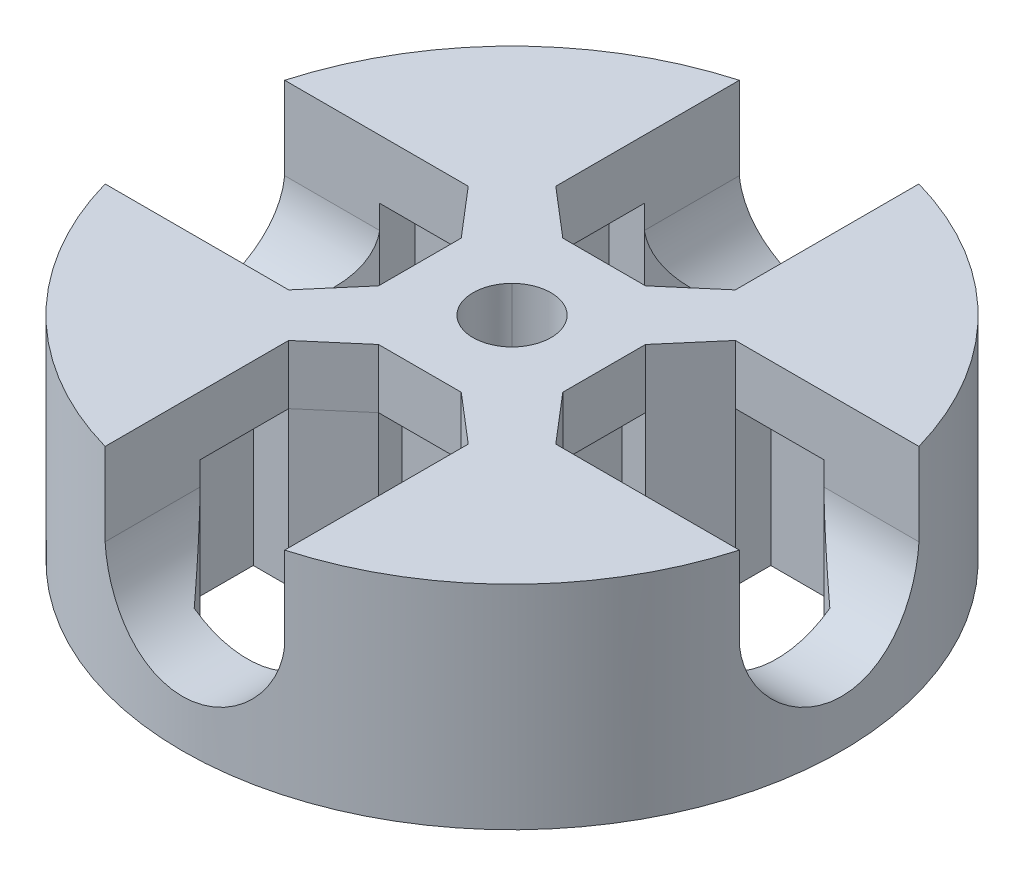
ISO-10303-21;
HEADER;
FILE_DESCRIPTION(('STEP AP214'),'2;1');
FILE_NAME('part.step','',(''),(''),'','','');
FILE_SCHEMA(('AUTOMOTIVE_DESIGN { 1 0 10303 214 1 1 1 1 }'));
ENDSEC;
DATA;
#1=APPLICATION_CONTEXT('core data for automotive mechanical design processes');
#2=APPLICATION_PROTOCOL_DEFINITION('international standard','automotive_design',2000,#1);
#3=PRODUCT_CONTEXT('',#1,'mechanical');
#4=PRODUCT('Part','Part','',(#3));
#5=PRODUCT_RELATED_PRODUCT_CATEGORY('part','',(#4));
#6=PRODUCT_DEFINITION_FORMATION('','',#4);
#7=PRODUCT_DEFINITION_CONTEXT('part definition',#1,'design');
#8=PRODUCT_DEFINITION('design','',#6,#7);
#9=PRODUCT_DEFINITION_SHAPE('','',#8);
#10=(LENGTH_UNIT() NAMED_UNIT(*) SI_UNIT(.MILLI.,.METRE.));
#11=(NAMED_UNIT(*) PLANE_ANGLE_UNIT() SI_UNIT($,.RADIAN.));
#12=(NAMED_UNIT(*) SI_UNIT($,.STERADIAN.) SOLID_ANGLE_UNIT());
#13=UNCERTAINTY_MEASURE_WITH_UNIT(LENGTH_MEASURE(1.E-05),#10,'distance_accuracy_value','');
#14=(GEOMETRIC_REPRESENTATION_CONTEXT(3) GLOBAL_UNCERTAINTY_ASSIGNED_CONTEXT((#13)) GLOBAL_UNIT_ASSIGNED_CONTEXT((#10,
#11,#12)) REPRESENTATION_CONTEXT('',''));
#15=CARTESIAN_POINT('',(0.,0.,0.));
#16=DIRECTION('',(0.,0.,1.));
#17=DIRECTION('',(1.,0.,0.));
#18=AXIS2_PLACEMENT_3D('',#15,#16,#17);
#19=CARTESIAN_POINT('',(0.,18.,0.));
#20=DIRECTION('',(0.,-1.,0.));
#21=DIRECTION('',(0.,0.,-1.));
#22=AXIS2_PLACEMENT_3D('',#19,#20,#21);
#23=CYLINDRICAL_SURFACE('',#22,27.9);
#24=CARTESIAN_POINT('',(0.,0.,0.));
#25=DIRECTION('',(0.,1.,0.));
#26=DIRECTION('',(0.,0.,1.));
#27=AXIS2_PLACEMENT_3D('',#24,#25,#26);
#28=CIRCLE('',#27,27.9);
#29=CARTESIAN_POINT('',(0.,0.,27.9));
#30=VERTEX_POINT('',#29);
#31=EDGE_CURVE('E664',#30,#30,#28,.T.);
#32=ORIENTED_EDGE('',*,*,#31,.T.);
#33=EDGE_LOOP('',(#32));
#34=FACE_BOUND('',#33,.T.);
#35=DIRECTION('',(0.,-1.,0.));
#36=VECTOR('',#35,1.);
#37=CARTESIAN_POINT('',(26.8449250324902,18.,-7.59999999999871));
#38=LINE('',#37,#36);
#39=CARTESIAN_POINT('',(26.8449250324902,18.,-7.59999999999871));
#40=VERTEX_POINT('',#39);
#41=CARTESIAN_POINT('',(26.8449250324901,11.0035557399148,-7.59999999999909));
#42=VERTEX_POINT('',#41);
#43=EDGE_CURVE('E737',#40,#42,#38,.T.);
#44=ORIENTED_EDGE('',*,*,#43,.T.);
#45=CARTESIAN_POINT('',(26.8449250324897,11.0035557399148,7.60000000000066));
#46=CARTESIAN_POINT('',(26.8497793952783,10.7925504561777,7.58278882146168));
#47=CARTESIAN_POINT('',(26.8571528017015,10.582339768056,7.55674415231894));
#48=CARTESIAN_POINT('',(26.8765924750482,10.1650633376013,7.48734500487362));
#49=CARTESIAN_POINT('',(26.8886576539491,9.95799687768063,7.44399453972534));
#50=CARTESIAN_POINT('',(26.9171078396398,9.54890221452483,7.34044322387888));
#51=CARTESIAN_POINT('',(26.93348357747,9.34686420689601,7.28027851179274));
#52=CARTESIAN_POINT('',(26.9700661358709,8.94876350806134,7.1435673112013));
#53=CARTESIAN_POINT('',(26.9902730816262,8.7527010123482,7.06702028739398));
#54=CARTESIAN_POINT('',(27.0339128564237,8.36798856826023,6.89819842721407));
#55=CARTESIAN_POINT('',(27.0573437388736,8.17933423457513,6.80593307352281));
#56=CARTESIAN_POINT('',(27.1067791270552,7.81046373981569,6.60629247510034));
#57=CARTESIAN_POINT('',(27.1327845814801,7.63025072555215,6.49891165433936));
#58=CARTESIAN_POINT('',(27.1866404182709,7.27944393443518,6.26980275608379));
#59=CARTESIAN_POINT('',(27.2144910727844,7.108851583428,6.14807256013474));
#60=CARTESIAN_POINT('',(27.2712746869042,6.77836385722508,5.89108561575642));
#61=CARTESIAN_POINT('',(27.3002076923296,6.61846893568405,5.75582829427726));
#62=CARTESIAN_POINT('',(27.3590823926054,6.30664666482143,5.46923381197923));
#63=CARTESIAN_POINT('',(27.3890315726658,6.15500499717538,5.31758720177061));
#64=CARTESIAN_POINT('',(27.4484186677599,5.86498077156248,5.00200829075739));
#65=CARTESIAN_POINT('',(27.4778565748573,5.72659841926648,4.83807579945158));
#66=CARTESIAN_POINT('',(27.5354105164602,5.46401953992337,4.4989710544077));
#67=CARTESIAN_POINT('',(27.5635264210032,5.33982440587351,4.32379769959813));
#68=CARTESIAN_POINT('',(27.6176547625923,5.10652093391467,3.96337571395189));
#69=CARTESIAN_POINT('',(27.6436672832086,4.99741199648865,3.77812748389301));
#70=CARTESIAN_POINT('',(27.6930164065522,4.794473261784,3.39762609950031));
#71=CARTESIAN_POINT('',(27.7163357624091,4.70074048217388,3.20231892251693));
#72=CARTESIAN_POINT('',(27.7594427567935,4.53014555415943,2.80417736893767));
#73=CARTESIAN_POINT('',(27.7792317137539,4.45327710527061,2.60134583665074));
#74=CARTESIAN_POINT('',(27.8147188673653,4.31701527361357,2.18954748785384));
#75=CARTESIAN_POINT('',(27.8304171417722,4.25762155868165,1.98058078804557));
#76=CARTESIAN_POINT('',(27.8572653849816,4.15683401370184,1.55806511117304));
#77=CARTESIAN_POINT('',(27.8684154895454,4.11543964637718,1.34451627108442));
#78=CARTESIAN_POINT('',(27.8855791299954,4.0519920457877,0.920903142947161));
#79=CARTESIAN_POINT('',(27.8917363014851,4.02939744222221,0.710925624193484));
#80=CARTESIAN_POINT('',(27.8992905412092,4.00170203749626,0.289736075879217));
#81=CARTESIAN_POINT('',(27.9006877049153,3.99660088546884,0.0785240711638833));
#82=CARTESIAN_POINT('',(27.8986829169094,4.0039372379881,-0.343548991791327));
#83=CARTESIAN_POINT('',(27.895281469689,4.01637289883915,-0.554410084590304));
#84=CARTESIAN_POINT('',(27.8837756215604,4.05866852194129,-0.974246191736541));
#85=CARTESIAN_POINT('',(27.8756712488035,4.08852837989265,-1.18322121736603));
#86=CARTESIAN_POINT('',(27.8551837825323,4.16467330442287,-1.5937938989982));
#87=CARTESIAN_POINT('',(27.8428854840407,4.21063331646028,-1.79545621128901));
#88=CARTESIAN_POINT('',(27.8143040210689,4.31870507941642,-2.19418743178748));
#89=CARTESIAN_POINT('',(27.7980195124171,4.38082227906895,-2.3912547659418));
#90=CARTESIAN_POINT('',(27.7619004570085,4.52069337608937,-2.77936347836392));
#91=CARTESIAN_POINT('',(27.7420668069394,4.5984433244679,-2.97040636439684));
#92=CARTESIAN_POINT('',(27.6993536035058,4.7690373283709,-3.34535985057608));
#93=CARTESIAN_POINT('',(27.6764728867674,4.86188715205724,-3.52926769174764));
#94=CARTESIAN_POINT('',(27.6277950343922,5.06392273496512,-3.89218512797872));
#95=CARTESIAN_POINT('',(27.6019502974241,5.17338817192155,-4.07103264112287));
#96=CARTESIAN_POINT('',(27.5483841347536,5.40657225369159,-4.41899751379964));
#97=CARTESIAN_POINT('',(27.5206618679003,5.53029730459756,-4.58811044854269));
#98=CARTESIAN_POINT('',(27.4640824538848,5.79112555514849,-4.91546213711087));
#99=CARTESIAN_POINT('',(27.4352253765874,5.92822793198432,-5.07370155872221));
#100=CARTESIAN_POINT('',(27.3771344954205,6.21493687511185,-5.37834155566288));
#101=CARTESIAN_POINT('',(27.3479006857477,6.36454363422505,-5.52474194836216));
#102=CARTESIAN_POINT('',(27.2889453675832,6.6800690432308,-5.80906026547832));
#103=CARTESIAN_POINT('',(27.2592361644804,6.84634595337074,-5.94658348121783));
#104=CARTESIAN_POINT('',(27.2010987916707,7.19003305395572,-6.20709565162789));
#105=CARTESIAN_POINT('',(27.1726701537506,7.36743911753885,-6.33008994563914));
#106=CARTESIAN_POINT('',(27.1179061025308,7.73228462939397,-6.56073352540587));
#107=CARTESIAN_POINT('',(27.0915708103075,7.91972465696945,-6.6683819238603));
#108=CARTESIAN_POINT('',(27.0417890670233,8.30329492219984,-6.86747225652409));
#109=CARTESIAN_POINT('',(27.0183413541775,8.49942131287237,-6.95892127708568));
#110=CARTESIAN_POINT('',(26.9769046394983,8.88184152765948,-7.11777805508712));
#111=CARTESIAN_POINT('',(26.9586193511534,9.06752607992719,-7.18657850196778));
#112=CARTESIAN_POINT('',(26.9255241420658,9.44395444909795,-7.30959616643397));
#113=CARTESIAN_POINT('',(26.9107138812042,9.63469776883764,-7.36381481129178));
#114=CARTESIAN_POINT('',(26.8849533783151,10.0203215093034,-7.45732496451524));
#115=CARTESIAN_POINT('',(26.874007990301,10.2152068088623,-7.49659770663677));
#116=CARTESIAN_POINT('',(26.8562762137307,10.6076795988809,-7.55984806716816));
#117=CARTESIAN_POINT('',(26.8494908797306,10.8052677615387,-7.58382180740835));
#118=CARTESIAN_POINT('',(26.8449250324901,11.0035557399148,-7.59999999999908));
#119=B_SPLINE_CURVE_WITH_KNOTS('',3,(#45,#46,#47,#48,#49,#50,#51,#52,#53,#54,#55,#56,#57,#58,
#59,#60,#61,#62,#63,#64,#65,#66,#67,#68,#69,#70,#71,#72,#73,#74,#75,#76,#77,#78,#79,#80,#81,#82,
#83,#84,#85,#86,#87,#88,#89,#90,#91,#92,#93,#94,#95,#96,#97,#98,#99,#100,#101,#102,#103,#104,
#105,#106,#107,#108,#109,#110,#111,#112,#113,#114,#115,#116,#117,#118),.UNSPECIFIED.,.F.,.F.,(4,
2,2,2,2,2,2,2,2,2,2,2,2,2,2,2,2,2,2,2,2,2,2,2,2,2,2,2,2,2,2,2,2,2,2,2,4),(0.,0.635063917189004,
1.26998065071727,1.90354312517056,2.53712630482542,3.17032859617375,3.8037650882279,
4.43729521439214,5.07085219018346,5.71970999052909,6.36857785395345,7.01750937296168,
7.66641509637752,8.31926957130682,8.97187972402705,9.62447747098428,10.2770557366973,
10.910118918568,11.543169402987,12.176153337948,12.8091334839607,13.4300078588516,
14.0510918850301,14.6720192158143,15.2931843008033,15.9262882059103,16.5596776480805,
17.193028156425,17.8263884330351,18.4790590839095,19.1314891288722,19.7839568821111,
20.4361385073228,21.0321147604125,21.628032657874,22.2246963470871,22.8215112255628),.UNSPECIFIED.);
#120=CARTESIAN_POINT('',(26.8449250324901,11.0035557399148,7.60000000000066));
#121=VERTEX_POINT('',#120);
#122=EDGE_CURVE('E606',#121,#42,#119,.T.);
#123=ORIENTED_EDGE('',*,*,#122,.F.);
#124=DIRECTION('',(0.,-1.,0.));
#125=VECTOR('',#124,1.);
#126=CARTESIAN_POINT('',(26.8449250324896,18.,7.60000000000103));
#127=LINE('',#126,#125);
#128=CARTESIAN_POINT('',(26.8449250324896,18.,7.60000000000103));
#129=VERTEX_POINT('',#128);
#130=EDGE_CURVE('E617',#129,#121,#127,.T.);
#131=ORIENTED_EDGE('',*,*,#130,.F.);
#132=CARTESIAN_POINT('',(0.,18.,0.));
#133=DIRECTION('',(0.,1.,0.));
#134=DIRECTION('',(0.,0.,1.));
#135=AXIS2_PLACEMENT_3D('',#132,#133,#134);
#136=CIRCLE('',#135,27.9);
#137=CARTESIAN_POINT('',(7.59899999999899,18.,26.8452081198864));
#138=VERTEX_POINT('',#137);
#139=EDGE_CURVE('E665',#138,#129,#136,.T.);
#140=ORIENTED_EDGE('',*,*,#139,.F.);
#141=DIRECTION('',(0.,-1.,0.));
#142=VECTOR('',#141,1.);
#143=CARTESIAN_POINT('',(7.59899999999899,18.,26.8452081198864));
#144=LINE('',#143,#142);
#145=CARTESIAN_POINT('',(7.59899999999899,11.0035557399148,26.8452081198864));
#146=VERTEX_POINT('',#145);
#147=EDGE_CURVE('E1893',#138,#146,#144,.T.);
#148=ORIENTED_EDGE('',*,*,#147,.T.);
#149=CARTESIAN_POINT('',(-7.60100000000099,11.0035557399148,26.8446419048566));
#150=CARTESIAN_POINT('',(-7.58376204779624,10.7925490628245,26.8495045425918));
#151=CARTESIAN_POINT('',(-7.5576905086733,10.582338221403,26.8568865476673));
#152=CARTESIAN_POINT('',(-7.4882376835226,10.1650639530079,26.8763438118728));
#153=CARTESIAN_POINT('',(-7.44486041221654,9.95799980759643,26.8884179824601));
#154=CARTESIAN_POINT('',(-7.34125584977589,9.54891221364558,26.9168862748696));
#155=CARTESIAN_POINT('',(-7.28106469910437,9.34687895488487,26.9332711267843));
#156=CARTESIAN_POINT('',(-7.14430114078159,8.94879006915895,26.9698718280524));
#157=CARTESIAN_POINT('',(-7.06772819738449,8.75273463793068,26.9900878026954));
#158=CARTESIAN_POINT('',(-6.8988552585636,8.368038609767,27.0337453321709));
#159=CARTESIAN_POINT('',(-6.80656475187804,8.17939362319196,27.0571849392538));
#160=CARTESIAN_POINT('',(-6.60687471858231,7.81054390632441,27.106637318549));
#161=CARTESIAN_POINT('',(-6.49946961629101,7.63034232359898,27.1326510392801));
#162=CARTESIAN_POINT('',(-6.27031314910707,7.27956033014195,27.1865228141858));
#163=CARTESIAN_POINT('',(-6.14855966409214,7.1089813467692,27.214381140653));
#164=CARTESIAN_POINT('',(-5.89152726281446,6.77852219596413,27.2711793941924));
#165=CARTESIAN_POINT('',(-5.756247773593,6.61864248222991,27.3001193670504));
#166=CARTESIAN_POINT('',(-5.46960883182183,6.30685184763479,27.3590075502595));
#167=CARTESIAN_POINT('',(-5.31793988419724,6.15522672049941,27.388963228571));
#168=CARTESIAN_POINT('',(-5.00231755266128,5.86523744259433,27.4483624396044));
#169=CARTESIAN_POINT('',(-4.83836397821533,5.72687349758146,27.477805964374));
#170=CARTESIAN_POINT('',(-4.49921846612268,5.46433323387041,27.535370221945));
#171=CARTESIAN_POINT('',(-4.32402542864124,5.34015830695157,27.5634908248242));
#172=CARTESIAN_POINT('',(-3.96356560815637,5.10689695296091,27.6176276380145));
#173=CARTESIAN_POINT('',(-3.77829922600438,4.99780992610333,27.6436439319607));
#174=CARTESIAN_POINT('',(-3.3977650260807,4.79491778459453,27.6929994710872));
#175=CARTESIAN_POINT('',(-3.20244328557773,4.70120953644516,27.7163214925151));
#176=CARTESIAN_POINT('',(-2.80427462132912,4.53066484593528,27.7594330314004));
#177=CARTESIAN_POINT('',(-2.60143054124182,4.45382210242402,27.7792238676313));
#178=CARTESIAN_POINT('',(-2.18960923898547,4.31761271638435,27.8147140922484));
#179=CARTESIAN_POINT('',(-1.98063213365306,4.25824574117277,27.8304135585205));
#180=CARTESIAN_POINT('',(-1.55809790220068,4.15751253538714,27.8572636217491));
#181=CARTESIAN_POINT('',(-1.34454091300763,4.11614576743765,27.8684143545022));
#182=CARTESIAN_POINT('',(-0.920915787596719,4.05275345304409,27.8855787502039));
#183=CARTESIAN_POINT('',(-0.710934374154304,4.03018637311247,27.8917360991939));
#184=CARTESIAN_POINT('',(-0.289739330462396,4.00254615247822,27.8992905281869));
#185=CARTESIAN_POINT('',(-0.0785257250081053,3.99747266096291,27.9006877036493));
#186=CARTESIAN_POINT('',(0.343548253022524,4.0048642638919,27.8986829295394));
#187=CARTESIAN_POINT('',(0.55440866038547,4.01732751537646,27.8952814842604));
#188=CARTESIAN_POINT('',(0.974241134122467,4.05967805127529,27.8837757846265));
#189=CARTESIAN_POINT('',(1.18321321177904,4.08956523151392,27.8756715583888));
#190=CARTESIAN_POINT('',(1.59377894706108,4.16576402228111,27.8551846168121));
#191=CARTESIAN_POINT('',(1.79543728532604,4.21175067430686,27.8428866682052));
#192=CARTESIAN_POINT('',(2.19415845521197,4.31987528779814,27.814306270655));
#193=CARTESIAN_POINT('',(2.39121971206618,4.38201869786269,27.7980224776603));
#194=CARTESIAN_POINT('',(2.77931423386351,4.5219416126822,27.7619053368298));
#195=CARTESIAN_POINT('',(2.97034900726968,4.5997171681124,27.7420728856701));
#196=CARTESIAN_POINT('',(3.34528431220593,4.77036166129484,27.6993626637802));
#197=CARTESIAN_POINT('',(3.5291820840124,4.86323636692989,27.676483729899));
#198=CARTESIAN_POINT('',(3.89207830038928,5.06532188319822,27.6278100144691));
#199=CARTESIAN_POINT('',(4.07091457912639,5.17481243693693,27.6019676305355));
#200=CARTESIAN_POINT('',(4.41885499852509,5.40804589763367,27.5484069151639));
#201=CARTESIAN_POINT('',(4.58795471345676,5.53179521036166,27.5206877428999));
#202=CARTESIAN_POINT('',(4.91527808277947,5.79267101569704,27.4641153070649));
#203=CARTESIAN_POINT('',(5.07350240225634,5.92979668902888,27.435262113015));
#204=CARTESIAN_POINT('',(5.37811031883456,6.21655109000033,27.3771798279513));
#205=CARTESIAN_POINT('',(5.52449373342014,6.36618001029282,27.3479507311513));
#206=CARTESIAN_POINT('',(5.80877483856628,6.68174812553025,27.2890060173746));
#207=CARTESIAN_POINT('',(5.94627784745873,6.84804546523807,27.2593027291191));
#208=CARTESIAN_POINT('',(6.20674792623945,7.19177173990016,27.2011780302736));
#209=CARTESIAN_POINT('',(6.32972033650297,7.36919654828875,27.1727561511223));
#210=CARTESIAN_POINT('',(6.56031844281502,7.73407750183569,27.1180064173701));
#211=CARTESIAN_POINT('',(6.66794326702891,7.92153421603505,27.0916786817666));
#212=CARTESIAN_POINT('',(6.86698501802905,8.30513578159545,27.0419127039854));
#213=CARTESIAN_POINT('',(6.95840903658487,8.50127678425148,27.0184731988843));
#214=CARTESIAN_POINT('',(7.11715431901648,8.88357239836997,26.9770689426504));
#215=CARTESIAN_POINT('',(7.18587998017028,9.06911286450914,26.9588053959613));
#216=CARTESIAN_POINT('',(7.30877153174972,9.44524358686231,26.925747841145));
#217=CARTESIAN_POINT('',(7.36293885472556,9.63583334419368,26.9109534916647));
#218=CARTESIAN_POINT('',(7.45637049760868,10.0211416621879,26.8852180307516));
#219=CARTESIAN_POINT('',(7.49561620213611,10.2158650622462,26.8742817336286));
#220=CARTESIAN_POINT('',(7.55883800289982,10.608010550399,26.8565605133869));
#221=CARTESIAN_POINT('',(7.58281022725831,10.8054333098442,26.8497766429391));
#222=CARTESIAN_POINT('',(7.59899999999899,11.0035557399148,26.8452081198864));
#223=B_SPLINE_CURVE_WITH_KNOTS('',3,(#149,#150,#151,#152,#153,#154,#155,#156,#157,#158,#159,
#160,#161,#162,#163,#164,#165,#166,#167,#168,#169,#170,#171,#172,#173,#174,#175,#176,#177,#178,
#179,#180,#181,#182,#183,#184,#185,#186,#187,#188,#189,#190,#191,#192,#193,#194,#195,#196,#197,
#198,#199,#200,#201,#202,#203,#204,#205,#206,#207,#208,#209,#210,#211,#212,#213,#214,#215,#216,
#217,#218,#219,#220,#221,#222),.UNSPECIFIED.,.F.,.F.,(4,2,2,2,2,2,2,2,2,2,2,2,2,2,2,2,2,2,2,2,2,
2,2,2,2,2,2,2,2,2,2,2,2,2,2,2,4),(0.,0.635075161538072,1.27000307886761,1.9035766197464,
2.53717088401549,3.17038399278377,3.8038313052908,4.43737233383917,5.07094021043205,
5.71981286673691,6.36869558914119,7.01764190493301,7.66656241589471,8.3194252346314,
8.97204371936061,9.62464977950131,10.2772363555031,10.9103023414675,11.5433556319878,
12.1763423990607,12.809325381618,13.4302058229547,14.0512959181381,14.6722292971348,
15.2934004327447,15.9265139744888,16.5599130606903,17.1932733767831,17.8266434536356,
18.4793201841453,19.1317562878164,19.7842294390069,20.4364162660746,21.0319068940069,
21.6273389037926,22.2235113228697,22.819834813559),.UNSPECIFIED.);
#224=CARTESIAN_POINT('',(-7.60100000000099,11.0035557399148,26.8446419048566));
#225=VERTEX_POINT('',#224);
#226=EDGE_CURVE('E854',#225,#146,#223,.T.);
#227=ORIENTED_EDGE('',*,*,#226,.F.);
#228=DIRECTION('',(0.,-1.,0.));
#229=VECTOR('',#228,1.);
#230=CARTESIAN_POINT('',(-7.60100000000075,18.,26.8446419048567));
#231=LINE('',#230,#229);
#232=CARTESIAN_POINT('',(-7.60100000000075,18.,26.8446419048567));
#233=VERTEX_POINT('',#232);
#234=EDGE_CURVE('E744',#233,#225,#231,.T.);
#235=ORIENTED_EDGE('',*,*,#234,.F.);
#236=CARTESIAN_POINT('',(-26.8449250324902,18.,7.5999999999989));
#237=VERTEX_POINT('',#236);
#238=EDGE_CURVE('E671',#237,#233,#136,.T.);
#239=ORIENTED_EDGE('',*,*,#238,.F.);
#240=DIRECTION('',(0.,-1.,0.));
#241=VECTOR('',#240,1.);
#242=CARTESIAN_POINT('',(-26.8449250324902,18.,7.5999999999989));
#243=LINE('',#242,#241);
#244=CARTESIAN_POINT('',(-26.8449250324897,11.0035557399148,7.60000000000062));
#245=VERTEX_POINT('',#244);
#246=EDGE_CURVE('E678',#237,#245,#243,.T.);
#247=ORIENTED_EDGE('',*,*,#246,.T.);
#248=CARTESIAN_POINT('',(-26.8449250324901,11.0035557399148,-7.59999999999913));
#249=CARTESIAN_POINT('',(-26.8497793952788,10.7925504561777,-7.58278882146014));
#250=CARTESIAN_POINT('',(-26.8571528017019,10.582339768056,-7.55674415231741));
#251=CARTESIAN_POINT('',(-26.8765924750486,10.1650633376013,-7.48734500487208));
#252=CARTESIAN_POINT('',(-26.8886576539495,9.95799687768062,-7.44399453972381));
#253=CARTESIAN_POINT('',(-26.9171078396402,9.54890221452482,-7.34044322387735));
#254=CARTESIAN_POINT('',(-26.9334835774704,9.346864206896,-7.2802785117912));
#255=CARTESIAN_POINT('',(-26.9700661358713,8.94876350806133,-7.14356731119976));
#256=CARTESIAN_POINT('',(-26.9902730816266,8.75270101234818,-7.06702028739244));
#257=CARTESIAN_POINT('',(-27.0339128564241,8.3679885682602,-6.89819842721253));
#258=CARTESIAN_POINT('',(-27.057343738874,8.17933423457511,-6.80593307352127));
#259=CARTESIAN_POINT('',(-27.1067791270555,7.81046373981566,-6.6062924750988));
#260=CARTESIAN_POINT('',(-27.1327845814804,7.63025072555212,-6.49891165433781));
#261=CARTESIAN_POINT('',(-27.1866404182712,7.27944393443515,-6.26980275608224));
#262=CARTESIAN_POINT('',(-27.2144910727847,7.10885158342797,-6.14807256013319));
#263=CARTESIAN_POINT('',(-27.2712746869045,6.77836385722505,-5.89108561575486));
#264=CARTESIAN_POINT('',(-27.3002076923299,6.61846893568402,-5.75582829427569));
#265=CARTESIAN_POINT('',(-27.3590823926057,6.3066466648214,-5.46923381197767));
#266=CARTESIAN_POINT('',(-27.3890315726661,6.15500499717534,-5.31758720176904));
#267=CARTESIAN_POINT('',(-27.4484186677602,5.86498077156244,-5.00200829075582));
#268=CARTESIAN_POINT('',(-27.4778565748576,5.72659841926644,-4.83807579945));
#269=CARTESIAN_POINT('',(-27.5354105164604,5.46401953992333,-4.49897105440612));
#270=CARTESIAN_POINT('',(-27.5635264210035,5.33982440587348,-4.32379769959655));
#271=CARTESIAN_POINT('',(-27.6176547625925,5.10652093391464,-3.96337571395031));
#272=CARTESIAN_POINT('',(-27.6436672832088,4.99741199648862,-3.77812748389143));
#273=CARTESIAN_POINT('',(-27.6930164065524,4.79447326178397,-3.39762609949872));
#274=CARTESIAN_POINT('',(-27.7163357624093,4.70074048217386,-3.20231892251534));
#275=CARTESIAN_POINT('',(-27.7594427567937,4.53014555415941,-2.80417736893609));
#276=CARTESIAN_POINT('',(-27.7792317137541,4.45327710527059,-2.60134583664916));
#277=CARTESIAN_POINT('',(-27.8147188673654,4.31701527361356,-2.18954748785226));
#278=CARTESIAN_POINT('',(-27.8304171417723,4.25762155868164,-1.98058078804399));
#279=CARTESIAN_POINT('',(-27.8572653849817,4.15683401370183,-1.55806511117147));
#280=CARTESIAN_POINT('',(-27.8684154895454,4.11543964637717,-1.34451627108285));
#281=CARTESIAN_POINT('',(-27.8855791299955,4.0519920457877,-0.9209031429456));
#282=CARTESIAN_POINT('',(-27.8917363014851,4.02939744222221,-0.710925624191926));
#283=CARTESIAN_POINT('',(-27.8992905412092,4.00170203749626,-0.289736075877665));
#284=CARTESIAN_POINT('',(-27.9006877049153,3.99660088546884,-0.0785240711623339));
#285=CARTESIAN_POINT('',(-27.8986829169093,4.0039372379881,0.34354899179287));
#286=CARTESIAN_POINT('',(-27.895281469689,4.01637289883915,0.554410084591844));
#287=CARTESIAN_POINT('',(-27.8837756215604,4.05866852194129,0.974246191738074));
#288=CARTESIAN_POINT('',(-27.8756712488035,4.08852837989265,1.18322121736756));
#289=CARTESIAN_POINT('',(-27.8551837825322,4.16467330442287,1.59379389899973));
#290=CARTESIAN_POINT('',(-27.8428854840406,4.21063331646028,1.79545621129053));
#291=CARTESIAN_POINT('',(-27.8143040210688,4.31870507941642,2.19418743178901));
#292=CARTESIAN_POINT('',(-27.798019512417,4.38082227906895,2.39125476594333));
#293=CARTESIAN_POINT('',(-27.7619004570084,4.52069337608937,2.77936347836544));
#294=CARTESIAN_POINT('',(-27.7420668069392,4.59844332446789,2.97040636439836));
#295=CARTESIAN_POINT('',(-27.6993536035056,4.76903732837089,3.3453598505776));
#296=CARTESIAN_POINT('',(-27.6764728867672,4.86188715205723,3.52926769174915));
#297=CARTESIAN_POINT('',(-27.627795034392,5.06392273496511,3.89218512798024));
#298=CARTESIAN_POINT('',(-27.6019502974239,5.17338817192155,4.07103264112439));
#299=CARTESIAN_POINT('',(-27.5483841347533,5.40657225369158,4.41899751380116));
#300=CARTESIAN_POINT('',(-27.5206618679,5.53029730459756,4.58811044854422));
#301=CARTESIAN_POINT('',(-27.4640824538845,5.79112555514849,4.9154621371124));
#302=CARTESIAN_POINT('',(-27.4352253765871,5.92822793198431,5.07370155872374));
#303=CARTESIAN_POINT('',(-27.3771344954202,6.21493687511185,5.37834155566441));
#304=CARTESIAN_POINT('',(-27.3479006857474,6.36454363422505,5.52474194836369));
#305=CARTESIAN_POINT('',(-27.2889453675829,6.68006904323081,5.80906026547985));
#306=CARTESIAN_POINT('',(-27.2592361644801,6.84634595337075,5.94658348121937));
#307=CARTESIAN_POINT('',(-27.2010987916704,7.19003305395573,6.20709565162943));
#308=CARTESIAN_POINT('',(-27.1726701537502,7.36743911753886,6.33008994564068));
#309=CARTESIAN_POINT('',(-27.1179061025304,7.73228462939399,6.56073352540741));
#310=CARTESIAN_POINT('',(-27.0915708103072,7.91972465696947,6.66838192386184));
#311=CARTESIAN_POINT('',(-27.0417890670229,8.30329492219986,6.86747225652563));
#312=CARTESIAN_POINT('',(-27.0183413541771,8.4994213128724,6.95892127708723));
#313=CARTESIAN_POINT('',(-26.9769046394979,8.88184152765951,7.11777805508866));
#314=CARTESIAN_POINT('',(-26.958619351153,9.06752607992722,7.18657850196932));
#315=CARTESIAN_POINT('',(-26.9255241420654,9.44395444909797,7.30959616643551));
#316=CARTESIAN_POINT('',(-26.9107138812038,9.63469776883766,7.36381481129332));
#317=CARTESIAN_POINT('',(-26.8849533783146,10.0203215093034,7.45732496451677));
#318=CARTESIAN_POINT('',(-26.8740079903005,10.2152068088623,7.4965977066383));
#319=CARTESIAN_POINT('',(-26.8562762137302,10.6076795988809,7.55984806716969));
#320=CARTESIAN_POINT('',(-26.8494908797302,10.8052677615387,7.58382180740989));
#321=CARTESIAN_POINT('',(-26.8449250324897,11.0035557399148,7.60000000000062));
#322=B_SPLINE_CURVE_WITH_KNOTS('',3,(#248,#249,#250,#251,#252,#253,#254,#255,#256,#257,#258,
#259,#260,#261,#262,#263,#264,#265,#266,#267,#268,#269,#270,#271,#272,#273,#274,#275,#276,#277,
#278,#279,#280,#281,#282,#283,#284,#285,#286,#287,#288,#289,#290,#291,#292,#293,#294,#295,#296,
#297,#298,#299,#300,#301,#302,#303,#304,#305,#306,#307,#308,#309,#310,#311,#312,#313,#314,#315,
#316,#317,#318,#319,#320,#321),.UNSPECIFIED.,.F.,.F.,(4,2,2,2,2,2,2,2,2,2,2,2,2,2,2,2,2,2,2,2,2,
2,2,2,2,2,2,2,2,2,2,2,2,2,2,2,4),(0.,0.635063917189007,1.26998065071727,1.90354312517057,
2.53712630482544,3.17032859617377,3.80376508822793,4.43729521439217,5.0708521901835,
5.71970999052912,6.36857785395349,7.01750937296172,7.66641509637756,8.31926957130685,
8.97187972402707,9.62447747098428,10.2770557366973,10.910118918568,11.543169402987,
12.1761533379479,12.8091334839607,13.4300078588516,14.0510918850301,14.6720192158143,
15.2931843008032,15.9262882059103,16.5596776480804,17.193028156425,17.8263884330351,
18.4790590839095,19.1314891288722,19.7839568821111,20.4361385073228,21.0321147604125,
21.628032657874,22.2246963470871,22.8215112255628),.UNSPECIFIED.);
#323=CARTESIAN_POINT('',(-26.8449250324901,11.0035557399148,-7.59999999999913));
#324=VERTEX_POINT('',#323);
#325=EDGE_CURVE('E779',#324,#245,#322,.T.);
#326=ORIENTED_EDGE('',*,*,#325,.F.);
#327=DIRECTION('',(0.,-1.,0.));
#328=VECTOR('',#327,1.);
#329=CARTESIAN_POINT('',(-26.8449250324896,18.,-7.60000000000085));
#330=LINE('',#329,#328);
#331=CARTESIAN_POINT('',(-26.8449250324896,18.,-7.60000000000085));
#332=VERTEX_POINT('',#331);
#333=EDGE_CURVE('E1896',#332,#324,#330,.T.);
#334=ORIENTED_EDGE('',*,*,#333,.F.);
#335=CARTESIAN_POINT('',(-7.60099999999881,18.,-26.8446419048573));
#336=VERTEX_POINT('',#335);
#337=EDGE_CURVE('E2057',#336,#332,#136,.T.);
#338=ORIENTED_EDGE('',*,*,#337,.F.);
#339=DIRECTION('',(0.,-1.,0.));
#340=VECTOR('',#339,1.);
#341=CARTESIAN_POINT('',(-7.60099999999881,18.,-26.8446419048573));
#342=LINE('',#341,#340);
#343=CARTESIAN_POINT('',(-7.60100000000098,11.0035557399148,-26.8446419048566));
#344=VERTEX_POINT('',#343);
#345=EDGE_CURVE('E1904',#336,#344,#342,.T.);
#346=ORIENTED_EDGE('',*,*,#345,.T.);
#347=CARTESIAN_POINT('',(7.59899999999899,11.0035557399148,-26.8452081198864));
#348=CARTESIAN_POINT('',(7.58176189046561,10.7925471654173,-26.8500694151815));
#349=CARTESIAN_POINT('',(7.55569003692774,10.5823344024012,-26.8574494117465));
#350=CARTESIAN_POINT('',(7.48623623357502,10.1650562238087,-26.8769013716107));
#351=CARTESIAN_POINT('',(7.44285829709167,9.95799009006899,-26.8889722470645));
#352=CARTESIAN_POINT('',(7.33925198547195,9.54889831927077,-26.9174327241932));
#353=CARTESIAN_POINT('',(7.2790597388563,9.3468628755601,-26.9338130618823));
#354=CARTESIAN_POINT('',(7.14229354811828,8.94876960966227,-26.9704035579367));
#355=CARTESIAN_POINT('',(7.06571906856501,8.75271198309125,-26.990613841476));
#356=CARTESIAN_POINT('',(6.89684255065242,8.36801151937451,-27.0342588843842));
#357=CARTESIAN_POINT('',(6.80454999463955,8.17936429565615,-27.0576916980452));
#358=CARTESIAN_POINT('',(6.60485535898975,7.81051021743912,-27.1071294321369));
#359=CARTESIAN_POINT('',(6.49744770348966,7.63030651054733,-27.1331353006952));
#360=CARTESIAN_POINT('',(6.26828565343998,7.27952051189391,-27.1869903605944));
#361=CARTESIAN_POINT('',(6.14652914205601,7.10893964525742,-27.2148398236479));
#362=CARTESIAN_POINT('',(5.88949021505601,6.77847702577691,-27.2716193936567));
#363=CARTESIAN_POINT('',(5.75420722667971,6.61859572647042,-27.3005495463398));
#364=CARTESIAN_POINT('',(5.46756264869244,6.30680432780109,-27.3594165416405));
#365=CARTESIAN_POINT('',(5.31589172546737,6.15517987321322,-27.3893608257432));
#366=CARTESIAN_POINT('',(5.00026537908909,5.86519210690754,-27.4487363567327));
#367=CARTESIAN_POINT('',(4.83630976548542,5.72682900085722,-27.4781675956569));
#368=CARTESIAN_POINT('',(4.49716018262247,5.46429064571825,-27.5357064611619));
#369=CARTESIAN_POINT('',(4.32196511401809,5.34011678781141,-27.563813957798));
#370=CARTESIAN_POINT('',(3.96150131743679,5.10685783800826,-27.6179238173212));
#371=CARTESIAN_POINT('',(3.77623299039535,4.99777214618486,-27.6439262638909));
#372=CARTESIAN_POINT('',(3.39569795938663,4.7948845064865,-27.6932529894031));
#373=CARTESIAN_POINT('',(3.20037746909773,4.70117918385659,-27.7165600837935));
#374=CARTESIAN_POINT('',(2.80221180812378,4.53064010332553,-27.7596413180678));
#375=CARTESIAN_POINT('',(2.59936948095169,4.4538000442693,-27.7794167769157));
#376=CARTESIAN_POINT('',(2.18755222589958,4.31759572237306,-27.8148759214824));
#377=CARTESIAN_POINT('',(1.97857741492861,4.25823112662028,-27.8305596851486));
#378=CARTESIAN_POINT('',(1.55604832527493,4.15750228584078,-27.8573781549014));
#379=CARTESIAN_POINT('',(1.34249418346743,4.11613750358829,-27.8685129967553));
#380=CARTESIAN_POINT('',(0.918874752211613,4.05274854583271,-27.8856460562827));
#381=CARTESIAN_POINT('',(0.708896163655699,4.03018288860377,-27.8917879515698));
#382=CARTESIAN_POINT('',(0.287707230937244,4.00254502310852,-27.8993115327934));
#383=CARTESIAN_POINT('',(0.0764969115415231,3.99747246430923,-27.9006933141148));
#384=CARTESIAN_POINT('',(-0.345570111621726,4.00486534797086,-27.8986579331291));
#385=CARTESIAN_POINT('',(-0.556426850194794,4.01732894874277,-27.8952412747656));
#386=CARTESIAN_POINT('',(-0.976251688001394,4.05967951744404,-27.8837054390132));
#387=CARTESIAN_POINT('',(-1.18521979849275,4.08956638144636,-27.8755862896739));
#388=CARTESIAN_POINT('',(-1.59578081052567,4.16576443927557,-27.8550700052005));
#389=CARTESIAN_POINT('',(-1.79743834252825,4.21175095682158,-27.8427575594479));
#390=CARTESIAN_POINT('',(-2.19615769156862,4.31987508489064,-27.8141484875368));
#391=CARTESIAN_POINT('',(-2.39321793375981,4.38201814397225,-27.7978505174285));
#392=CARTESIAN_POINT('',(-2.78131031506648,4.52194011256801,-27.7617054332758));
#393=CARTESIAN_POINT('',(-2.97234396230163,4.59971507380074,-27.7418592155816));
#394=CARTESIAN_POINT('',(-3.34727697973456,4.77035812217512,-27.6991219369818));
#395=CARTESIAN_POINT('',(-3.53117359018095,4.8632319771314,-27.6762297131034));
#396=CARTESIAN_POINT('',(-3.89407026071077,5.06531705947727,-27.6275293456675));
#397=CARTESIAN_POINT('',(-4.07290802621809,5.1748082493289,-27.6016735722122));
#398=CARTESIAN_POINT('',(-4.4208512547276,5.40804318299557,-27.5480866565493));
#399=CARTESIAN_POINT('',(-4.58995229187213,5.5317933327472,-27.5203546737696));
#400=CARTESIAN_POINT('',(-4.91727818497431,5.79267104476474,-27.4637572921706));
#401=CARTESIAN_POINT('',(-5.07550370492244,5.9297977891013,-27.4348919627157));
#402=CARTESIAN_POINT('',(-5.38011389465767,6.21655458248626,-27.3767861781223));
#403=CARTESIAN_POINT('',(-5.52649838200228,6.36618482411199,-27.347545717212));
#404=CARTESIAN_POINT('',(-5.81078192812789,6.68175635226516,-27.2885787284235));
#405=CARTESIAN_POINT('',(-5.94828626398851,6.8480558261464,-27.2588645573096));
#406=CARTESIAN_POINT('',(-6.20875874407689,7.19178676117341,-27.2007191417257));
#407=CARTESIAN_POINT('',(-6.33173222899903,7.36921409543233,-27.1722874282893));
#408=CARTESIAN_POINT('',(-6.56233214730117,7.73410045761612,-27.1175192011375));
#409=CARTESIAN_POINT('',(-6.66995771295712,7.92156005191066,-27.0911828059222));
#410=CARTESIAN_POINT('',(-6.86900057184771,8.30516776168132,-27.0414008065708));
#411=CARTESIAN_POINT('',(-6.9604249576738,8.50131202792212,-27.0179539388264));
#412=CARTESIAN_POINT('',(-7.11916790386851,8.88360794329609,-26.9765376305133));
#413=CARTESIAN_POINT('',(-7.1878913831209,9.06914520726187,-26.9582691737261));
#414=CARTESIAN_POINT('',(-7.31077914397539,9.44526944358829,-26.9252028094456));
#415=CARTESIAN_POINT('',(-7.36494485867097,9.63585591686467,-26.9104045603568));
#416=CARTESIAN_POINT('',(-7.45837386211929,10.0211577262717,-26.8846623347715));
#417=CARTESIAN_POINT('',(-7.49761852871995,10.215877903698,-26.8737231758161));
#418=CARTESIAN_POINT('',(-7.56083877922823,10.6080169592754,-26.8559973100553));
#419=CARTESIAN_POINT('',(-7.58481049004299,10.8054365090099,-26.849211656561));
#420=CARTESIAN_POINT('',(-7.60100000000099,11.0035557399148,-26.8446419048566));
#421=B_SPLINE_CURVE_WITH_KNOTS('',3,(#347,#348,#349,#350,#351,#352,#353,#354,#355,#356,#357,
#358,#359,#360,#361,#362,#363,#364,#365,#366,#367,#368,#369,#370,#371,#372,#373,#374,#375,#376,
#377,#378,#379,#380,#381,#382,#383,#384,#385,#386,#387,#388,#389,#390,#391,#392,#393,#394,#395,
#396,#397,#398,#399,#400,#401,#402,#403,#404,#405,#406,#407,#408,#409,#410,#411,#412,#413,#414,
#415,#416,#417,#418,#419,#420),.UNSPECIFIED.,.F.,.F.,(4,2,2,2,2,2,2,2,2,2,2,2,2,2,2,2,2,2,2,2,2,
2,2,2,2,2,2,2,2,2,2,2,2,2,2,2,4),(0.,0.635080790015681,1.27001438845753,1.90359407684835,
2.53719447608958,3.17041398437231,3.8038676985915,4.43741498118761,5.07098910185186,
5.7198597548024,6.36874046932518,7.01768474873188,7.66660321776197,8.31945412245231,
8.9720606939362,9.62465483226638,10.2772294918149,10.9102852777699,11.5433283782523,
12.1763050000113,12.8092778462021,13.4301584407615,14.0512486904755,14.67218226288,
15.2933535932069,15.9264768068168,16.5598855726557,17.1932556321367,17.826635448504,
18.4793240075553,19.1317719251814,19.7842567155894,20.4364551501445,21.031935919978,
21.6273580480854,22.2235208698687,22.8198348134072),.UNSPECIFIED.);
#422=CARTESIAN_POINT('',(7.59899999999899,11.0035557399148,-26.8452081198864));
#423=VERTEX_POINT('',#422);
#424=EDGE_CURVE('E818',#423,#344,#421,.T.);
#425=ORIENTED_EDGE('',*,*,#424,.F.);
#426=DIRECTION('',(0.,-1.,0.));
#427=VECTOR('',#426,1.);
#428=CARTESIAN_POINT('',(7.59900000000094,18.,-26.8452081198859));
#429=LINE('',#428,#427);
#430=CARTESIAN_POINT('',(7.59900000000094,18.,-26.8452081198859));
#431=VERTEX_POINT('',#430);
#432=EDGE_CURVE('E1907',#431,#423,#429,.T.);
#433=ORIENTED_EDGE('',*,*,#432,.F.);
#434=EDGE_CURVE('E670',#40,#431,#136,.T.);
#435=ORIENTED_EDGE('',*,*,#434,.F.);
#436=EDGE_LOOP('',(#44,#123,#131,#140,#148,#227,#235,#239,#247,#326,#334,#338,#346,#425,#433,#435));
#437=FACE_BOUND('',#436,.T.);
#438=ADVANCED_FACE('F45',(#34,#437),#23,.T.);
#439=CARTESIAN_POINT('',(22.4040011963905,18.,4.5));
#440=DIRECTION('',(-0.652523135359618,0.,-0.75776880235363));
#441=DIRECTION('',(-0.75776880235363,0.,0.652523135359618));
#442=AXIS2_PLACEMENT_3D('',#439,#440,#441);
#443=PLANE('',#442);
#444=DIRECTION('',(0.,-1.,0.));
#445=VECTOR('',#444,1.);
#446=CARTESIAN_POINT('',(18.8040011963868,18.,7.60000000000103));
#447=LINE('',#446,#445);
#448=CARTESIAN_POINT('',(18.8040011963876,11.0035557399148,7.60000000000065));
#449=VERTEX_POINT('',#448);
#450=CARTESIAN_POINT('',(18.8040011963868,0.,7.60000000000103));
#451=VERTEX_POINT('',#450);
#452=EDGE_CURVE('E622',#449,#451,#447,.T.);
#453=ORIENTED_EDGE('',*,*,#452,.F.);
#454=CARTESIAN_POINT('',(27.6298076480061,11.6244368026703,7.88050032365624E-13));
#455=DIRECTION('',(-0.652523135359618,0.,-0.75776880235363));
#456=DIRECTION('',(0.75776880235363,0.,-0.652523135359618));
#457=AXIS2_PLACEMENT_3D('',#454,#455,#456);
#458=ELLIPSE('',#457,11.6858986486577,7.62531922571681);
#459=CARTESIAN_POINT('',(22.4040011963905,5.4685052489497,4.5));
#460=VERTEX_POINT('',#459);
#461=EDGE_CURVE('E594',#449,#460,#458,.F.);
#462=ORIENTED_EDGE('',*,*,#461,.T.);
#463=DIRECTION('',(0.,-1.,0.));
#464=VECTOR('',#463,1.);
#465=CARTESIAN_POINT('',(22.4040011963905,18.,4.5));
#466=LINE('',#465,#464);
#467=CARTESIAN_POINT('',(22.4040011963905,0.,4.5));
#468=VERTEX_POINT('',#467);
#469=EDGE_CURVE('E630',#460,#468,#466,.T.);
#470=ORIENTED_EDGE('',*,*,#469,.T.);
#471=DIRECTION('',(0.75776880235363,0.,-0.652523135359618));
#472=VECTOR('',#471,1.);
#473=CARTESIAN_POINT('',(22.4040011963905,0.,4.5));
#474=LINE('',#473,#472);
#475=EDGE_CURVE('E625',#451,#468,#474,.T.);
#476=ORIENTED_EDGE('',*,*,#475,.F.);
#477=EDGE_LOOP('',(#453,#462,#470,#476));
#478=FACE_BOUND('',#477,.T.);
#479=ADVANCED_FACE('F623',(#478),#443,.T.);
#480=CARTESIAN_POINT('',(-22.4040011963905,18.,-4.50000000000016));
#481=DIRECTION('',(0.652523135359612,0.,0.757768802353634));
#482=DIRECTION('',(0.757768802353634,0.,-0.652523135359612));
#483=AXIS2_PLACEMENT_3D('',#480,#481,#482);
#484=PLANE('',#483);
#485=DIRECTION('',(0.,-1.,0.));
#486=VECTOR('',#485,1.);
#487=CARTESIAN_POINT('',(-18.8040011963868,18.,-7.60000000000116));
#488=LINE('',#487,#486);
#489=CARTESIAN_POINT('',(-18.8040011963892,11.0035557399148,-7.59999999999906));
#490=VERTEX_POINT('',#489);
#491=CARTESIAN_POINT('',(-18.8040011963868,0.,-7.60000000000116));
#492=VERTEX_POINT('',#491);
#493=EDGE_CURVE('E1268',#490,#492,#488,.T.);
#494=ORIENTED_EDGE('',*,*,#493,.F.);
#495=CARTESIAN_POINT('',(-27.6298076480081,11.6244368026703,7.40207990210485E-13));
#496=DIRECTION('',(0.652523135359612,0.,0.757768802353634));
#497=DIRECTION('',(-0.757768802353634,0.,0.652523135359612));
#498=AXIS2_PLACEMENT_3D('',#495,#496,#497);
#499=ELLIPSE('',#498,11.6858986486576,7.62531922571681);
#500=CARTESIAN_POINT('',(-22.4040011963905,5.46850524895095,-4.50000000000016));
#501=VERTEX_POINT('',#500);
#502=EDGE_CURVE('E789',#490,#501,#499,.F.);
#503=ORIENTED_EDGE('',*,*,#502,.T.);
#504=DIRECTION('',(0.,-1.,0.));
#505=VECTOR('',#504,1.);
#506=CARTESIAN_POINT('',(-22.4040011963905,18.,-4.50000000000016));
#507=LINE('',#506,#505);
#508=CARTESIAN_POINT('',(-22.4040011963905,0.,-4.50000000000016));
#509=VERTEX_POINT('',#508);
#510=EDGE_CURVE('E1265',#501,#509,#507,.T.);
#511=ORIENTED_EDGE('',*,*,#510,.T.);
#512=DIRECTION('',(-0.757768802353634,0.,0.652523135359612));
#513=VECTOR('',#512,1.);
#514=CARTESIAN_POINT('',(-22.4040011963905,0.,-4.50000000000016));
#515=LINE('',#514,#513);
#516=EDGE_CURVE('E1218',#492,#509,#515,.T.);
#517=ORIENTED_EDGE('',*,*,#516,.F.);
#518=EDGE_LOOP('',(#494,#503,#511,#517));
#519=FACE_BOUND('',#518,.T.);
#520=ADVANCED_FACE('F732',(#519),#484,.T.);
#521=CARTESIAN_POINT('',(4.50000000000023,18.,-22.4040011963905));
#522=DIRECTION('',(-0.757768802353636,0.,0.65252313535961));
#523=DIRECTION('',(0.65252313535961,0.,0.757768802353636));
#524=AXIS2_PLACEMENT_3D('',#521,#522,#523);
#525=PLANE('',#524);
#526=DIRECTION('',(0.,-1.,0.));
#527=VECTOR('',#526,1.);
#528=CARTESIAN_POINT('',(7.59899999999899,18.,-18.8051624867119));
#529=LINE('',#528,#527);
#530=CARTESIAN_POINT('',(7.59900000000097,13.,-18.8051624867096));
#531=VERTEX_POINT('',#530);
#532=CARTESIAN_POINT('',(7.59899999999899,11.0035557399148,-18.8051624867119));
#533=VERTEX_POINT('',#532);
#534=EDGE_CURVE('E798',#531,#533,#529,.T.);
#535=ORIENTED_EDGE('',*,*,#534,.T.);
#536=CARTESIAN_POINT('',(-0.00100000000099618,11.6253970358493,-27.6309689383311));
#537=DIRECTION('',(-0.757768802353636,0.,0.65252313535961));
#538=DIRECTION('',(-0.65252313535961,0.,-0.757768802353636));
#539=AXIS2_PLACEMENT_3D('',#536,#537,#538);
#540=ELLIPSE('',#539,11.6860185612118,7.62539747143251);
#541=CARTESIAN_POINT('',(4.50000000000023,5.47009967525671,-22.4040011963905));
#542=VERTEX_POINT('',#541);
#543=EDGE_CURVE('E814',#533,#542,#540,.F.);
#544=ORIENTED_EDGE('',*,*,#543,.T.);
#545=DIRECTION('',(0.,-1.,0.));
#546=VECTOR('',#545,1.);
#547=CARTESIAN_POINT('',(4.50000000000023,18.,-22.4040011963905));
#548=LINE('',#547,#546);
#549=CARTESIAN_POINT('',(4.50000000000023,0.,-22.4040011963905));
#550=VERTEX_POINT('',#549);
#551=EDGE_CURVE('E1167',#542,#550,#548,.T.);
#552=ORIENTED_EDGE('',*,*,#551,.T.);
#553=DIRECTION('',(-0.65252313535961,0.,-0.757768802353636));
#554=VECTOR('',#553,1.);
#555=CARTESIAN_POINT('',(4.50000000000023,0.,-22.4040011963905));
#556=LINE('',#555,#554);
#557=CARTESIAN_POINT('',(7.60000000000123,0.,-18.8040011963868));
#558=VERTEX_POINT('',#557);
#559=EDGE_CURVE('E1121',#558,#550,#556,.T.);
#560=ORIENTED_EDGE('',*,*,#559,.F.);
#561=DIRECTION('',(0.,-1.,0.));
#562=VECTOR('',#561,1.);
#563=CARTESIAN_POINT('',(7.60000000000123,18.,-18.8040011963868));
#564=LINE('',#563,#562);
#565=CARTESIAN_POINT('',(7.60000000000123,13.,-18.8040011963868));
#566=VERTEX_POINT('',#565);
#567=EDGE_CURVE('E1170',#566,#558,#564,.T.);
#568=ORIENTED_EDGE('',*,*,#567,.F.);
#569=DIRECTION('',(-0.65252313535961,0.,-0.757768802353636));
#570=VECTOR('',#569,1.);
#571=CARTESIAN_POINT('',(4.50000000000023,13.,-22.4040011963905));
#572=LINE('',#571,#570);
#573=EDGE_CURVE('E936',#566,#531,#572,.T.);
#574=ORIENTED_EDGE('',*,*,#573,.T.);
#575=EDGE_LOOP('',(#535,#544,#552,#560,#568,#574));
#576=FACE_BOUND('',#575,.T.);
#577=ADVANCED_FACE('F1649',(#576),#525,.T.);
#578=CARTESIAN_POINT('',(-7.6000000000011,18.,18.8040011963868));
#579=DIRECTION('',(0.,0.,-1.));
#580=DIRECTION('',(-1.,0.,0.));
#581=AXIS2_PLACEMENT_3D('',#578,#579,#580);
#582=PLANE('',#581);
#583=DIRECTION('',(0.,-1.,0.));
#584=VECTOR('',#583,1.);
#585=CARTESIAN_POINT('',(-7.60100000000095,18.,18.8040011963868));
#586=LINE('',#585,#584);
#587=CARTESIAN_POINT('',(-7.6010000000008,13.,18.8040011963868));
#588=VERTEX_POINT('',#587);
#589=CARTESIAN_POINT('',(-7.60100000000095,11.0035557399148,18.8040011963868));
#590=VERTEX_POINT('',#589);
#591=EDGE_CURVE('E834',#588,#590,#586,.T.);
#592=ORIENTED_EDGE('',*,*,#591,.T.);
#593=CARTESIAN_POINT('',(-0.00100000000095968,11.6253970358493,18.8040011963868));
#594=DIRECTION('',(0.,0.,-1.));
#595=DIRECTION('',(-1.,0.,0.));
#596=AXIS2_PLACEMENT_3D('',#593,#594,#595);
#597=CIRCLE('',#596,7.62539747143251);
#598=CARTESIAN_POINT('',(-7.6000000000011,10.9914525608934,18.8040011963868));
#599=VERTEX_POINT('',#598);
#600=EDGE_CURVE('E850',#590,#599,#597,.F.);
#601=ORIENTED_EDGE('',*,*,#600,.T.);
#602=DIRECTION('',(0.,-1.,0.));
#603=VECTOR('',#602,1.);
#604=CARTESIAN_POINT('',(-7.6000000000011,18.,18.8040011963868));
#605=LINE('',#604,#603);
#606=CARTESIAN_POINT('',(-7.6000000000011,0.,18.8040011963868));
#607=VERTEX_POINT('',#606);
#608=EDGE_CURVE('E1368',#599,#607,#605,.T.);
#609=ORIENTED_EDGE('',*,*,#608,.T.);
#610=DIRECTION('',(1.,0.,0.));
#611=VECTOR('',#610,1.);
#612=CARTESIAN_POINT('',(-7.6000000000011,0.,18.8040011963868));
#613=LINE('',#612,#611);
#614=CARTESIAN_POINT('',(-10.6000000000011,0.,18.8040011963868));
#615=VERTEX_POINT('',#614);
#616=EDGE_CURVE('E1315',#615,#607,#613,.T.);
#617=ORIENTED_EDGE('',*,*,#616,.F.);
#618=DIRECTION('',(0.,-1.,0.));
#619=VECTOR('',#618,1.);
#620=CARTESIAN_POINT('',(-10.6000000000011,18.,18.8040011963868));
#621=LINE('',#620,#619);
#622=CARTESIAN_POINT('',(-10.6000000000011,13.,18.8040011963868));
#623=VERTEX_POINT('',#622);
#624=EDGE_CURVE('E1371',#623,#615,#621,.T.);
#625=ORIENTED_EDGE('',*,*,#624,.F.);
#626=DIRECTION('',(1.,0.,0.));
#627=VECTOR('',#626,1.);
#628=CARTESIAN_POINT('',(-7.6000000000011,13.,18.8040011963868));
#629=LINE('',#628,#627);
#630=EDGE_CURVE('E1031',#623,#588,#629,.T.);
#631=ORIENTED_EDGE('',*,*,#630,.T.);
#632=EDGE_LOOP('',(#592,#601,#609,#617,#625,#631));
#633=FACE_BOUND('',#632,.T.);
#634=ADVANCED_FACE('F1627',(#633),#582,.T.);
#635=CARTESIAN_POINT('',(0.,13.,0.));
#636=DIRECTION('',(0.,1.,0.));
#637=DIRECTION('',(0.,0.,1.));
#638=AXIS2_PLACEMENT_3D('',#635,#636,#637);
#639=PLANE('',#638);
#640=DIRECTION('',(0.,0.,-1.));
#641=VECTOR('',#640,1.);
#642=CARTESIAN_POINT('',(-7.60099999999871,13.,0.));
#643=LINE('',#642,#641);
#644=CARTESIAN_POINT('',(-7.60099999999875,13.,-11.3050011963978));
#645=VERTEX_POINT('',#644);
#646=CARTESIAN_POINT('',(-7.60100000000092,13.,-18.804001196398));
#647=VERTEX_POINT('',#646);
#648=EDGE_CURVE('E2006',#645,#647,#643,.T.);
#649=ORIENTED_EDGE('',*,*,#648,.F.);
#650=DIRECTION('',(-0.759973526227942,0.,-0.64995402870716));
#651=VECTOR('',#650,1.);
#652=CARTESIAN_POINT('',(2.37311283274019,13.,-2.77481613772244));
#653=LINE('',#652,#651);
#654=CARTESIAN_POINT('',(-3.50099999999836,13.,-7.79854810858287));
#655=VERTEX_POINT('',#654);
#656=EDGE_CURVE('E2008',#655,#645,#653,.T.);
#657=ORIENTED_EDGE('',*,*,#656,.F.);
#658=DIRECTION('',(-1.,0.,-6.54238568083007E-13));
#659=VECTOR('',#658,1.);
#660=CARTESIAN_POINT('',(5.1021109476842E-12,13.,-7.79854810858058));
#661=LINE('',#660,#659);
#662=CARTESIAN_POINT('',(3.49899999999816,13.,-7.79854810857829));
#663=VERTEX_POINT('',#662);
#664=EDGE_CURVE('E2011',#663,#655,#661,.T.);
#665=ORIENTED_EDGE('',*,*,#664,.F.);
#666=DIRECTION('',(0.75997352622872,0.,-0.64995402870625));
#667=VECTOR('',#666,1.);
#668=CARTESIAN_POINT('',(-2.37395771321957,13.,-2.77580403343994));
#669=LINE('',#668,#667);
#670=CARTESIAN_POINT('',(7.59900000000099,13.,-11.3050011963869));
#671=VERTEX_POINT('',#670);
#672=EDGE_CURVE('E863',#663,#671,#669,.T.);
#673=ORIENTED_EDGE('',*,*,#672,.T.);
#674=DIRECTION('',(0.,0.,-1.));
#675=VECTOR('',#674,1.);
#676=CARTESIAN_POINT('',(7.59900000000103,13.,0.));
#677=LINE('',#676,#675);
#678=EDGE_CURVE('E70',#671,#531,#677,.T.);
#679=ORIENTED_EDGE('',*,*,#678,.T.);
#680=ORIENTED_EDGE('',*,*,#573,.F.);
#681=DIRECTION('',(-1.,0.,0.));
#682=VECTOR('',#681,1.);
#683=CARTESIAN_POINT('',(7.60000000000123,13.,-18.8040011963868));
#684=LINE('',#683,#682);
#685=CARTESIAN_POINT('',(10.6000000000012,13.,-18.8040011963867));
#686=VERTEX_POINT('',#685);
#687=EDGE_CURVE('E940',#686,#566,#684,.T.);
#688=ORIENTED_EDGE('',*,*,#687,.F.);
#689=DIRECTION('',(0.,0.,-1.));
#690=VECTOR('',#689,1.);
#691=CARTESIAN_POINT('',(10.6000000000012,13.,-18.8040011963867));
#692=LINE('',#691,#690);
#693=CARTESIAN_POINT('',(10.6000000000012,13.,-11.3040011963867));
#694=VERTEX_POINT('',#693);
#695=EDGE_CURVE('E944',#694,#686,#692,.T.);
#696=ORIENTED_EDGE('',*,*,#695,.F.);
#697=DIRECTION('',(1.,0.,0.));
#698=VECTOR('',#697,1.);
#699=CARTESIAN_POINT('',(10.6000000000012,13.,-11.3040011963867));
#700=LINE('',#699,#698);
#701=CARTESIAN_POINT('',(7.60000000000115,13.,-11.3040011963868));
#702=VERTEX_POINT('',#701);
#703=EDGE_CURVE('E948',#702,#694,#700,.T.);
#704=ORIENTED_EDGE('',*,*,#703,.F.);
#705=DIRECTION('',(0.759973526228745,0.,-0.649954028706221));
#706=VECTOR('',#705,1.);
#707=CARTESIAN_POINT('',(3.49999999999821,13.,-7.79754810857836));
#708=LINE('',#707,#706);
#709=CARTESIAN_POINT('',(3.49999999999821,13.,-7.79754810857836));
#710=VERTEX_POINT('',#709);
#711=EDGE_CURVE('E952',#710,#702,#708,.T.);
#712=ORIENTED_EDGE('',*,*,#711,.F.);
#713=DIRECTION('',(0.,0.,-1.));
#714=VECTOR('',#713,1.);
#715=CARTESIAN_POINT('',(3.49999999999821,13.,-5.79754810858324));
#716=LINE('',#715,#714);
#717=CARTESIAN_POINT('',(3.49999999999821,13.,-5.79754810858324));
#718=VERTEX_POINT('',#717);
#719=EDGE_CURVE('E956',#718,#710,#716,.T.);
#720=ORIENTED_EDGE('',*,*,#719,.F.);
#721=DIRECTION('',(1.,0.,0.));
#722=VECTOR('',#721,1.);
#723=CARTESIAN_POINT('',(0.,13.,-5.79754810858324));
#724=LINE('',#723,#722);
#725=CARTESIAN_POINT('',(-3.49999999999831,13.,-5.79754810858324));
#726=VERTEX_POINT('',#725);
#727=EDGE_CURVE('E960',#726,#718,#724,.T.);
#728=ORIENTED_EDGE('',*,*,#727,.F.);
#729=DIRECTION('',(0.,0.,1.));
#730=VECTOR('',#729,1.);
#731=CARTESIAN_POINT('',(-3.49999999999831,13.,-5.79754810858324));
#732=LINE('',#731,#730);
#733=CARTESIAN_POINT('',(-3.49999999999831,13.,-7.79754810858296));
#734=VERTEX_POINT('',#733);
#735=EDGE_CURVE('E964',#734,#726,#732,.T.);
#736=ORIENTED_EDGE('',*,*,#735,.F.);
#737=DIRECTION('',(0.75997352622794,0.,0.649954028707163));
#738=VECTOR('',#737,1.);
#739=CARTESIAN_POINT('',(-3.49999999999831,13.,-7.79754810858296));
#740=LINE('',#739,#738);
#741=CARTESIAN_POINT('',(-7.59999999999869,13.,-11.304001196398));
#742=VERTEX_POINT('',#741);
#743=EDGE_CURVE('E669',#742,#734,#740,.T.);
#744=ORIENTED_EDGE('',*,*,#743,.F.);
#745=DIRECTION('',(1.,0.,0.));
#746=VECTOR('',#745,1.);
#747=CARTESIAN_POINT('',(-10.5999999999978,13.,-11.304001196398));
#748=LINE('',#747,#746);
#749=CARTESIAN_POINT('',(-10.5999999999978,13.,-11.304001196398));
#750=VERTEX_POINT('',#749);
#751=EDGE_CURVE('E924',#750,#742,#748,.T.);
#752=ORIENTED_EDGE('',*,*,#751,.F.);
#753=DIRECTION('',(0.,0.,1.));
#754=VECTOR('',#753,1.);
#755=CARTESIAN_POINT('',(-10.5999999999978,13.,-18.804001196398));
#756=LINE('',#755,#754);
#757=CARTESIAN_POINT('',(-10.5999999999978,13.,-18.804001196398));
#758=VERTEX_POINT('',#757);
#759=EDGE_CURVE('E928',#758,#750,#756,.T.);
#760=ORIENTED_EDGE('',*,*,#759,.F.);
#761=DIRECTION('',(-1.,0.,0.));
#762=VECTOR('',#761,1.);
#763=CARTESIAN_POINT('',(-10.5999999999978,13.,-18.804001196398));
#764=LINE('',#763,#762);
#765=EDGE_CURVE('E933',#647,#758,#764,.T.);
#766=ORIENTED_EDGE('',*,*,#765,.F.);
#767=EDGE_LOOP('',(#649,#657,#665,#673,#679,#680,#688,#696,#704,#712,#720,#728,#736,#744,#752,
#760,#766));
#768=FACE_BOUND('',#767,.T.);
#769=ADVANCED_FACE('F719',(#768),#639,.F.);
#770=DIRECTION('',(-1.,0.,0.));
#771=VECTOR('',#770,1.);
#772=CARTESIAN_POINT('',(0.,13.,7.59999999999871));
#773=LINE('',#772,#771);
#774=CARTESIAN_POINT('',(-11.3060011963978,13.,7.59999999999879));
#775=VERTEX_POINT('',#774);
#776=CARTESIAN_POINT('',(-18.8040011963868,13.,7.60000000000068));
#777=VERTEX_POINT('',#776);
#778=EDGE_CURVE('E1518',#775,#777,#773,.T.);
#779=ORIENTED_EDGE('',*,*,#778,.F.);
#780=DIRECTION('',(-0.649954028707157,0.,0.759973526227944));
#781=VECTOR('',#780,1.);
#782=CARTESIAN_POINT('',(-2.7758876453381,13.,-2.3740292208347));
#783=LINE('',#782,#781);
#784=CARTESIAN_POINT('',(-7.79954810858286,13.,3.49999999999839));
#785=VERTEX_POINT('',#784);
#786=EDGE_CURVE('E1514',#785,#775,#783,.T.);
#787=ORIENTED_EDGE('',*,*,#786,.F.);
#788=DIRECTION('',(-6.50769121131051E-13,0.,1.));
#789=VECTOR('',#788,1.);
#790=CARTESIAN_POINT('',(-7.79954810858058,13.,-5.07570506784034E-12));
#791=LINE('',#790,#789);
#792=CARTESIAN_POINT('',(-7.7995481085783,13.,-3.49999999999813));
#793=VERTEX_POINT('',#792);
#794=EDGE_CURVE('E1509',#793,#785,#791,.T.);
#795=ORIENTED_EDGE('',*,*,#794,.F.);
#796=DIRECTION('',(-0.649954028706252,0.,-0.759973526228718));
#797=VECTOR('',#796,1.);
#798=CARTESIAN_POINT('',(-2.77588764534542,13.,2.37402922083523));
#799=LINE('',#798,#797);
#800=CARTESIAN_POINT('',(-11.3060011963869,13.,-7.60000000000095));
#801=VERTEX_POINT('',#800);
#802=EDGE_CURVE('E1505',#793,#801,#799,.T.);
#803=ORIENTED_EDGE('',*,*,#802,.T.);
#804=DIRECTION('',(-1.,0.,0.));
#805=VECTOR('',#804,1.);
#806=CARTESIAN_POINT('',(0.,13.,-7.60000000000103));
#807=LINE('',#806,#805);
#808=CARTESIAN_POINT('',(-18.8040011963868,13.,-7.60000000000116));
#809=VERTEX_POINT('',#808);
#810=EDGE_CURVE('E1521',#801,#809,#807,.T.);
#811=ORIENTED_EDGE('',*,*,#810,.T.);
#812=DIRECTION('',(0.,0.,1.));
#813=VECTOR('',#812,1.);
#814=CARTESIAN_POINT('',(-18.8040011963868,13.,-7.60000000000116));
#815=LINE('',#814,#813);
#816=CARTESIAN_POINT('',(-18.8040011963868,13.,-10.6000000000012));
#817=VERTEX_POINT('',#816);
#818=EDGE_CURVE('E984',#817,#809,#815,.T.);
#819=ORIENTED_EDGE('',*,*,#818,.F.);
#820=DIRECTION('',(-1.,0.,0.));
#821=VECTOR('',#820,1.);
#822=CARTESIAN_POINT('',(-18.8040011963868,13.,-10.6000000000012));
#823=LINE('',#822,#821);
#824=CARTESIAN_POINT('',(-11.3040011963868,13.,-10.6000000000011));
#825=VERTEX_POINT('',#824);
#826=EDGE_CURVE('E988',#825,#817,#823,.T.);
#827=ORIENTED_EDGE('',*,*,#826,.F.);
#828=DIRECTION('',(0.,0.,-1.));
#829=VECTOR('',#828,1.);
#830=CARTESIAN_POINT('',(-11.3040011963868,13.,-10.6000000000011));
#831=LINE('',#830,#829);
#832=CARTESIAN_POINT('',(-11.3040011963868,13.,-7.60000000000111));
#833=VERTEX_POINT('',#832);
#834=EDGE_CURVE('E992',#833,#825,#831,.T.);
#835=ORIENTED_EDGE('',*,*,#834,.F.);
#836=DIRECTION('',(-0.649954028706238,0.,-0.759973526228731));
#837=VECTOR('',#836,1.);
#838=CARTESIAN_POINT('',(-7.79754810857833,13.,-3.49999999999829));
#839=LINE('',#838,#837);
#840=CARTESIAN_POINT('',(-7.79754810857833,13.,-3.49999999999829));
#841=VERTEX_POINT('',#840);
#842=EDGE_CURVE('E996',#841,#833,#839,.T.);
#843=ORIENTED_EDGE('',*,*,#842,.F.);
#844=DIRECTION('',(-1.,0.,0.));
#845=VECTOR('',#844,1.);
#846=CARTESIAN_POINT('',(-5.79754810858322,13.,-3.49999999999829));
#847=LINE('',#846,#845);
#848=CARTESIAN_POINT('',(-5.79754810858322,13.,-3.49999999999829));
#849=VERTEX_POINT('',#848);
#850=EDGE_CURVE('E1000',#849,#841,#847,.T.);
#851=ORIENTED_EDGE('',*,*,#850,.F.);
#852=DIRECTION('',(0.,0.,-1.));
#853=VECTOR('',#852,1.);
#854=CARTESIAN_POINT('',(-5.79754810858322,13.,0.));
#855=LINE('',#854,#853);
#856=CARTESIAN_POINT('',(-5.79754810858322,13.,3.49999999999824));
#857=VERTEX_POINT('',#856);
#858=EDGE_CURVE('E1004',#857,#849,#855,.T.);
#859=ORIENTED_EDGE('',*,*,#858,.F.);
#860=DIRECTION('',(1.,0.,0.));
#861=VECTOR('',#860,1.);
#862=CARTESIAN_POINT('',(-5.79754810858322,13.,3.49999999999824));
#863=LINE('',#862,#861);
#864=CARTESIAN_POINT('',(-7.79754810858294,13.,3.49999999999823));
#865=VERTEX_POINT('',#864);
#866=EDGE_CURVE('E1008',#865,#857,#863,.T.);
#867=ORIENTED_EDGE('',*,*,#866,.F.);
#868=DIRECTION('',(0.649954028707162,0.,-0.75997352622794));
#869=VECTOR('',#868,1.);
#870=CARTESIAN_POINT('',(-7.79754810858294,13.,3.49999999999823));
#871=LINE('',#870,#869);
#872=CARTESIAN_POINT('',(-11.3040011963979,13.,7.59999999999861));
#873=VERTEX_POINT('',#872);
#874=EDGE_CURVE('E968',#873,#865,#871,.T.);
#875=ORIENTED_EDGE('',*,*,#874,.F.);
#876=DIRECTION('',(0.,0.,-1.));
#877=VECTOR('',#876,1.);
#878=CARTESIAN_POINT('',(-11.3040011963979,13.,10.5999999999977));
#879=LINE('',#878,#877);
#880=CARTESIAN_POINT('',(-11.3040011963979,13.,10.5999999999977));
#881=VERTEX_POINT('',#880);
#882=EDGE_CURVE('E972',#881,#873,#879,.T.);
#883=ORIENTED_EDGE('',*,*,#882,.F.);
#884=DIRECTION('',(1.,0.,0.));
#885=VECTOR('',#884,1.);
#886=CARTESIAN_POINT('',(-18.8040011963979,13.,10.5999999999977));
#887=LINE('',#886,#885);
#888=CARTESIAN_POINT('',(-18.8040011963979,13.,10.5999999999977));
#889=VERTEX_POINT('',#888);
#890=EDGE_CURVE('E976',#889,#881,#887,.T.);
#891=ORIENTED_EDGE('',*,*,#890,.F.);
#892=DIRECTION('',(0.,0.,1.));
#893=VECTOR('',#892,1.);
#894=CARTESIAN_POINT('',(-18.8040011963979,13.,10.5999999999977));
#895=LINE('',#894,#893);
#896=EDGE_CURVE('E980',#777,#889,#895,.T.);
#897=ORIENTED_EDGE('',*,*,#896,.F.);
#898=EDGE_LOOP('',(#779,#787,#795,#803,#811,#819,#827,#835,#843,#851,#859,#867,#875,#883,#891,#897));
#899=FACE_BOUND('',#898,.T.);
#900=ADVANCED_FACE('F1626',(#899),#639,.F.);
#901=DIRECTION('',(0.,0.,1.));
#902=VECTOR('',#901,1.);
#903=CARTESIAN_POINT('',(7.59899999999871,13.,0.));
#904=LINE('',#903,#902);
#905=CARTESIAN_POINT('',(7.59899999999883,13.,11.3050011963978));
#906=VERTEX_POINT('',#905);
#907=CARTESIAN_POINT('',(7.59899999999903,13.,18.805162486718));
#908=VERTEX_POINT('',#907);
#909=EDGE_CURVE('E1547',#906,#908,#904,.T.);
#910=ORIENTED_EDGE('',*,*,#909,.F.);
#911=DIRECTION('',(0.759973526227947,0.,0.649954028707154));
#912=VECTOR('',#911,1.);
#913=CARTESIAN_POINT('',(-2.37395771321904,13.,2.77580403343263));
#914=LINE('',#913,#912);
#915=CARTESIAN_POINT('',(3.49899999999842,13.,7.79854810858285));
#916=VERTEX_POINT('',#915);
#917=EDGE_CURVE('E1543',#916,#906,#914,.T.);
#918=ORIENTED_EDGE('',*,*,#917,.F.);
#919=DIRECTION('',(1.,0.,6.47299674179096E-13));
#920=VECTOR('',#919,1.);
#921=CARTESIAN_POINT('',(-5.04799764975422E-12,13.,7.79854810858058));
#922=LINE('',#921,#920);
#923=CARTESIAN_POINT('',(-3.5009999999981,13.,7.79854810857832));
#924=VERTEX_POINT('',#923);
#925=EDGE_CURVE('E1539',#924,#916,#922,.T.);
#926=ORIENTED_EDGE('',*,*,#925,.F.);
#927=DIRECTION('',(-0.759973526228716,0.,0.649954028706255));
#928=VECTOR('',#927,1.);
#929=CARTESIAN_POINT('',(2.37311283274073,13.,2.77481613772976));
#930=LINE('',#929,#928);
#931=CARTESIAN_POINT('',(-7.60100000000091,13.,11.3050011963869));
#932=VERTEX_POINT('',#931);
#933=EDGE_CURVE('E921',#924,#932,#930,.T.);
#934=ORIENTED_EDGE('',*,*,#933,.T.);
#935=DIRECTION('',(0.,0.,1.));
#936=VECTOR('',#935,1.);
#937=CARTESIAN_POINT('',(-7.60100000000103,13.,0.));
#938=LINE('',#937,#936);
#939=EDGE_CURVE('E1550',#932,#588,#938,.T.);
#940=ORIENTED_EDGE('',*,*,#939,.T.);
#941=ORIENTED_EDGE('',*,*,#630,.F.);
#942=DIRECTION('',(0.,0.,1.));
#943=VECTOR('',#942,1.);
#944=CARTESIAN_POINT('',(-10.6000000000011,13.,18.8040011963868));
#945=LINE('',#944,#943);
#946=CARTESIAN_POINT('',(-10.6000000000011,13.,11.3040011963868));
#947=VERTEX_POINT('',#946);
#948=EDGE_CURVE('E1035',#947,#623,#945,.T.);
#949=ORIENTED_EDGE('',*,*,#948,.F.);
#950=DIRECTION('',(-1.,0.,0.));
#951=VECTOR('',#950,1.);
#952=CARTESIAN_POINT('',(-10.6000000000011,13.,11.3040011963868));
#953=LINE('',#952,#951);
#954=CARTESIAN_POINT('',(-7.60000000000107,13.,11.3040011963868));
#955=VERTEX_POINT('',#954);
#956=EDGE_CURVE('E1039',#955,#947,#953,.T.);
#957=ORIENTED_EDGE('',*,*,#956,.F.);
#958=DIRECTION('',(-0.75997352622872,0.,0.649954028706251));
#959=VECTOR('',#958,1.);
#960=CARTESIAN_POINT('',(-3.49999999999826,13.,7.79754810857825));
#961=LINE('',#960,#959);
#962=CARTESIAN_POINT('',(-3.49999999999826,13.,7.79754810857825));
#963=VERTEX_POINT('',#962);
#964=EDGE_CURVE('E1043',#963,#955,#961,.T.);
#965=ORIENTED_EDGE('',*,*,#964,.F.);
#966=DIRECTION('',(0.,0.,1.));
#967=VECTOR('',#966,1.);
#968=CARTESIAN_POINT('',(-3.49999999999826,13.,5.79754810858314));
#969=LINE('',#968,#967);
#970=CARTESIAN_POINT('',(-3.49999999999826,13.,5.79754810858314));
#971=VERTEX_POINT('',#970);
#972=EDGE_CURVE('E1047',#971,#963,#969,.T.);
#973=ORIENTED_EDGE('',*,*,#972,.F.);
#974=DIRECTION('',(-1.,0.,0.));
#975=VECTOR('',#974,1.);
#976=CARTESIAN_POINT('',(0.,13.,5.79754810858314));
#977=LINE('',#976,#975);
#978=CARTESIAN_POINT('',(3.49999999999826,13.,5.79754810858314));
#979=VERTEX_POINT('',#978);
#980=EDGE_CURVE('E1051',#979,#971,#977,.T.);
#981=ORIENTED_EDGE('',*,*,#980,.F.);
#982=DIRECTION('',(0.,0.,-1.));
#983=VECTOR('',#982,1.);
#984=CARTESIAN_POINT('',(3.49999999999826,13.,5.79754810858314));
#985=LINE('',#984,#983);
#986=CARTESIAN_POINT('',(3.49999999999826,13.,7.79754810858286));
#987=VERTEX_POINT('',#986);
#988=EDGE_CURVE('E1055',#987,#979,#985,.T.);
#989=ORIENTED_EDGE('',*,*,#988,.F.);
#990=DIRECTION('',(-0.75997352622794,0.,-0.649954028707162));
#991=VECTOR('',#990,1.);
#992=CARTESIAN_POINT('',(3.49999999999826,13.,7.79754810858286));
#993=LINE('',#992,#991);
#994=CARTESIAN_POINT('',(7.59999999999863,13.,11.3040011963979));
#995=VERTEX_POINT('',#994);
#996=EDGE_CURVE('E1012',#995,#987,#993,.T.);
#997=ORIENTED_EDGE('',*,*,#996,.F.);
#998=DIRECTION('',(-1.,0.,0.));
#999=VECTOR('',#998,1.);
#1000=CARTESIAN_POINT('',(10.5999999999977,13.,11.3040011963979));
#1001=LINE('',#1000,#999);
#1002=CARTESIAN_POINT('',(10.5999999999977,13.,11.3040011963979));
#1003=VERTEX_POINT('',#1002);
#1004=EDGE_CURVE('E1016',#1003,#995,#1001,.T.);
#1005=ORIENTED_EDGE('',*,*,#1004,.F.);
#1006=DIRECTION('',(0.,0.,-1.));
#1007=VECTOR('',#1006,1.);
#1008=CARTESIAN_POINT('',(10.5999999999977,13.,18.8040011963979));
#1009=LINE('',#1008,#1007);
#1010=CARTESIAN_POINT('',(10.5999999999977,13.,18.8040011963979));
#1011=VERTEX_POINT('',#1010);
#1012=EDGE_CURVE('E1020',#1011,#1003,#1009,.T.);
#1013=ORIENTED_EDGE('',*,*,#1012,.F.);
#1014=DIRECTION('',(1.,0.,0.));
#1015=VECTOR('',#1014,1.);
#1016=CARTESIAN_POINT('',(10.5999999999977,13.,18.8040011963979));
#1017=LINE('',#1016,#1015);
#1018=CARTESIAN_POINT('',(7.59999999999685,13.,18.8040011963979));
#1019=VERTEX_POINT('',#1018);
#1020=EDGE_CURVE('E1024',#1019,#1011,#1017,.T.);
#1021=ORIENTED_EDGE('',*,*,#1020,.F.);
#1022=DIRECTION('',(0.652523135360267,0.,-0.757768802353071));
#1023=VECTOR('',#1022,1.);
#1024=CARTESIAN_POINT('',(7.59999999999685,13.,18.8040011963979));
#1025=LINE('',#1024,#1023);
#1026=EDGE_CURVE('E1028',#908,#1019,#1025,.T.);
#1027=ORIENTED_EDGE('',*,*,#1026,.F.);
#1028=EDGE_LOOP('',(#910,#918,#926,#934,#940,#941,#949,#957,#965,#973,#981,#989,#997,#1005,
#1013,#1021,#1027));
#1029=FACE_BOUND('',#1028,.T.);
#1030=ADVANCED_FACE('F2127',(#1029),#639,.F.);
#1031=DIRECTION('',(6.57708015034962E-13,0.,-1.));
#1032=VECTOR('',#1031,1.);
#1033=CARTESIAN_POINT('',(7.79754810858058,13.,5.12850988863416E-12));
#1034=LINE('',#1033,#1032);
#1035=CARTESIAN_POINT('',(7.79754810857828,13.,3.49999999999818));
#1036=VERTEX_POINT('',#1035);
#1037=CARTESIAN_POINT('',(7.79754810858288,13.,-3.49999999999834));
#1038=VERTEX_POINT('',#1037);
#1039=EDGE_CURVE('E1485',#1036,#1038,#1034,.T.);
#1040=ORIENTED_EDGE('',*,*,#1039,.F.);
#1041=DIRECTION('',(1.,0.,0.));
#1042=VECTOR('',#1041,1.);
#1043=CARTESIAN_POINT('',(5.79754810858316,13.,3.49999999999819));
#1044=LINE('',#1043,#1042);
#1045=CARTESIAN_POINT('',(5.79754810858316,13.,3.49999999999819));
#1046=VERTEX_POINT('',#1045);
#1047=EDGE_CURVE('E1081',#1046,#1036,#1044,.T.);
#1048=ORIENTED_EDGE('',*,*,#1047,.F.);
#1049=DIRECTION('',(0.,0.,1.));
#1050=VECTOR('',#1049,1.);
#1051=CARTESIAN_POINT('',(5.79754810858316,13.,0.));
#1052=LINE('',#1051,#1050);
#1053=CARTESIAN_POINT('',(5.79754810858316,13.,-3.49999999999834));
#1054=VERTEX_POINT('',#1053);
#1055=EDGE_CURVE('E1085',#1054,#1046,#1052,.T.);
#1056=ORIENTED_EDGE('',*,*,#1055,.F.);
#1057=DIRECTION('',(-1.,0.,0.));
#1058=VECTOR('',#1057,1.);
#1059=CARTESIAN_POINT('',(5.79754810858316,13.,-3.49999999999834));
#1060=LINE('',#1059,#1058);
#1061=EDGE_CURVE('E1089',#1038,#1054,#1060,.T.);
#1062=ORIENTED_EDGE('',*,*,#1061,.F.);
#1063=EDGE_LOOP('',(#1040,#1048,#1056,#1062));
#1064=FACE_BOUND('',#1063,.T.);
#1065=ADVANCED_FACE('F1842',(#1064),#639,.F.);
#1066=DIRECTION('',(1.,0.,0.));
#1067=VECTOR('',#1066,1.);
#1068=CARTESIAN_POINT('',(0.,13.,-7.59999999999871));
#1069=LINE('',#1068,#1067);
#1070=CARTESIAN_POINT('',(11.3040011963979,13.,-7.59999999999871));
#1071=VERTEX_POINT('',#1070);
#1072=CARTESIAN_POINT('',(18.8040011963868,13.,-7.59999999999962));
#1073=VERTEX_POINT('',#1072);
#1074=EDGE_CURVE('E1482',#1071,#1073,#1069,.T.);
#1075=ORIENTED_EDGE('',*,*,#1074,.F.);
#1076=DIRECTION('',(0.,0.,1.));
#1077=VECTOR('',#1076,1.);
#1078=CARTESIAN_POINT('',(11.3040011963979,13.,-10.5999999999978));
#1079=LINE('',#1078,#1077);
#1080=CARTESIAN_POINT('',(11.3040011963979,13.,-10.5999999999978));
#1081=VERTEX_POINT('',#1080);
#1082=EDGE_CURVE('E1059',#1081,#1071,#1079,.T.);
#1083=ORIENTED_EDGE('',*,*,#1082,.F.);
#1084=DIRECTION('',(-1.,0.,0.));
#1085=VECTOR('',#1084,1.);
#1086=CARTESIAN_POINT('',(18.8040011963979,13.,-10.5999999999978));
#1087=LINE('',#1086,#1085);
#1088=CARTESIAN_POINT('',(18.8040011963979,13.,-10.5999999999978));
#1089=VERTEX_POINT('',#1088);
#1090=EDGE_CURVE('E1063',#1089,#1081,#1087,.T.);
#1091=ORIENTED_EDGE('',*,*,#1090,.F.);
#1092=DIRECTION('',(0.,0.,-1.));
#1093=VECTOR('',#1092,1.);
#1094=CARTESIAN_POINT('',(18.8040011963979,13.,-10.5999999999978));
#1095=LINE('',#1094,#1093);
#1096=EDGE_CURVE('E1067',#1073,#1089,#1095,.T.);
#1097=ORIENTED_EDGE('',*,*,#1096,.F.);
#1098=EDGE_LOOP('',(#1075,#1083,#1091,#1097));
#1099=FACE_BOUND('',#1098,.T.);
#1100=ADVANCED_FACE('F705',(#1099),#639,.F.);
#1101=CARTESIAN_POINT('',(0.,18.,0.));
#1102=DIRECTION('',(0.,1.,0.));
#1103=DIRECTION('',(0.,0.,1.));
#1104=AXIS2_PLACEMENT_3D('',#1101,#1102,#1103);
#1105=PLANE('',#1104);
#1106=CARTESIAN_POINT('',(0.,18.,0.));
#1107=DIRECTION('',(0.,1.,0.));
#1108=DIRECTION('',(0.,0.,1.));
#1109=AXIS2_PLACEMENT_3D('',#1106,#1107,#1108);
#1110=CIRCLE('',#1109,3.3);
#1111=CARTESIAN_POINT('',(-2.33395232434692,18.,-2.3329523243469));
#1112=VERTEX_POINT('',#1111);
#1113=CARTESIAN_POINT('',(-2.33395232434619,18.,2.33295232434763));
#1114=VERTEX_POINT('',#1113);
#1115=EDGE_CURVE('E1940',#1112,#1114,#1110,.T.);
#1116=ORIENTED_EDGE('',*,*,#1115,.F.);
#1117=CARTESIAN_POINT('',(-0.00099999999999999,18.,0.001));
#1118=DIRECTION('',(0.,1.,0.));
#1119=DIRECTION('',(0.,0.,1.));
#1120=AXIS2_PLACEMENT_3D('',#1117,#1118,#1119);
#1121=CIRCLE('',#1120,3.3);
#1122=CARTESIAN_POINT('',(2.33195232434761,18.,-2.33295232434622));
#1123=VERTEX_POINT('',#1122);
#1124=EDGE_CURVE('E1930',#1123,#1112,#1121,.T.);
#1125=ORIENTED_EDGE('',*,*,#1124,.F.);
#1126=CARTESIAN_POINT('',(-0.002,18.,0.));
#1127=DIRECTION('',(0.,1.,0.));
#1128=DIRECTION('',(0.,0.,1.));
#1129=AXIS2_PLACEMENT_3D('',#1126,#1127,#1128);
#1130=CIRCLE('',#1129,3.3);
#1131=CARTESIAN_POINT('',(2.33195232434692,18.,2.3329523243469));
#1132=VERTEX_POINT('',#1131);
#1133=EDGE_CURVE('E1933',#1132,#1123,#1130,.T.);
#1134=ORIENTED_EDGE('',*,*,#1133,.F.);
#1135=CARTESIAN_POINT('',(-0.001,18.,-0.001));
#1136=DIRECTION('',(0.,1.,0.));
#1137=DIRECTION('',(0.,0.,1.));
#1138=AXIS2_PLACEMENT_3D('',#1135,#1136,#1137);
#1139=CIRCLE('',#1138,3.3);
#1140=EDGE_CURVE('E1937',#1114,#1132,#1139,.T.);
#1141=ORIENTED_EDGE('',*,*,#1140,.F.);
#1142=EDGE_LOOP('',(#1116,#1125,#1134,#1141));
#1143=FACE_BOUND('',#1142,.T.);
#1144=ORIENTED_EDGE('',*,*,#434,.T.);
#1145=DIRECTION('',(0.,0.,1.));
#1146=VECTOR('',#1145,1.);
#1147=CARTESIAN_POINT('',(7.59900000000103,18.,0.));
#1148=LINE('',#1147,#1146);
#1149=CARTESIAN_POINT('',(7.59900000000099,18.,-11.3050011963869));
#1150=VERTEX_POINT('',#1149);
#1151=EDGE_CURVE('E929',#431,#1150,#1148,.T.);
#1152=ORIENTED_EDGE('',*,*,#1151,.T.);
#1153=DIRECTION('',(-0.759973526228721,0.,0.64995402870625));
#1154=VECTOR('',#1153,1.);
#1155=CARTESIAN_POINT('',(-2.37395771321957,18.,-2.77580403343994));
#1156=LINE('',#1155,#1154);
#1157=CARTESIAN_POINT('',(3.49899999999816,18.,-7.79854810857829));
#1158=VERTEX_POINT('',#1157);
#1159=EDGE_CURVE('E1865',#1150,#1158,#1156,.T.);
#1160=ORIENTED_EDGE('',*,*,#1159,.T.);
#1161=DIRECTION('',(1.,0.,6.54238568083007E-13));
#1162=VECTOR('',#1161,1.);
#1163=CARTESIAN_POINT('',(5.1021109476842E-12,18.,-7.79854810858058));
#1164=LINE('',#1163,#1162);
#1165=CARTESIAN_POINT('',(-3.50099999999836,18.,-7.79854810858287));
#1166=VERTEX_POINT('',#1165);
#1167=EDGE_CURVE('E1854',#1166,#1158,#1164,.T.);
#1168=ORIENTED_EDGE('',*,*,#1167,.F.);
#1169=DIRECTION('',(0.759973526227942,0.,0.64995402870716));
#1170=VECTOR('',#1169,1.);
#1171=CARTESIAN_POINT('',(2.37311283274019,18.,-2.77481613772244));
#1172=LINE('',#1171,#1170);
#1173=CARTESIAN_POINT('',(-7.60099999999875,18.,-11.3050011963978));
#1174=VERTEX_POINT('',#1173);
#1175=EDGE_CURVE('E1858',#1174,#1166,#1172,.T.);
#1176=ORIENTED_EDGE('',*,*,#1175,.F.);
#1177=DIRECTION('',(0.,0.,1.));
#1178=VECTOR('',#1177,1.);
#1179=CARTESIAN_POINT('',(-7.60099999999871,18.,0.));
#1180=LINE('',#1179,#1178);
#1181=EDGE_CURVE('E1967',#336,#1174,#1180,.T.);
#1182=ORIENTED_EDGE('',*,*,#1181,.F.);
#1183=ORIENTED_EDGE('',*,*,#337,.T.);
#1184=DIRECTION('',(1.,0.,0.));
#1185=VECTOR('',#1184,1.);
#1186=CARTESIAN_POINT('',(0.,18.,-7.60000000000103));
#1187=LINE('',#1186,#1185);
#1188=CARTESIAN_POINT('',(-11.3060011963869,18.,-7.60000000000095));
#1189=VERTEX_POINT('',#1188);
#1190=EDGE_CURVE('E1980',#332,#1189,#1187,.T.);
#1191=ORIENTED_EDGE('',*,*,#1190,.T.);
#1192=DIRECTION('',(0.649954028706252,0.,0.759973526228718));
#1193=VECTOR('',#1192,1.);
#1194=CARTESIAN_POINT('',(-2.77588764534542,18.,2.37402922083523));
#1195=LINE('',#1194,#1193);
#1196=CARTESIAN_POINT('',(-7.7995481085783,18.,-3.49999999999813));
#1197=VERTEX_POINT('',#1196);
#1198=EDGE_CURVE('E1916',#1189,#1197,#1195,.T.);
#1199=ORIENTED_EDGE('',*,*,#1198,.T.);
#1200=DIRECTION('',(6.50769121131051E-13,0.,-1.));
#1201=VECTOR('',#1200,1.);
#1202=CARTESIAN_POINT('',(-7.79954810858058,18.,-5.07570506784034E-12));
#1203=LINE('',#1202,#1201);
#1204=CARTESIAN_POINT('',(-7.79954810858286,18.,3.49999999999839));
#1205=VERTEX_POINT('',#1204);
#1206=EDGE_CURVE('E1910',#1205,#1197,#1203,.T.);
#1207=ORIENTED_EDGE('',*,*,#1206,.F.);
#1208=DIRECTION('',(0.649954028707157,0.,-0.759973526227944));
#1209=VECTOR('',#1208,1.);
#1210=CARTESIAN_POINT('',(-2.7758876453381,18.,-2.3740292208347));
#1211=LINE('',#1210,#1209);
#1212=CARTESIAN_POINT('',(-11.3060011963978,18.,7.59999999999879));
#1213=VERTEX_POINT('',#1212);
#1214=EDGE_CURVE('E1913',#1213,#1205,#1211,.T.);
#1215=ORIENTED_EDGE('',*,*,#1214,.F.);
#1216=DIRECTION('',(1.,0.,0.));
#1217=VECTOR('',#1216,1.);
#1218=CARTESIAN_POINT('',(0.,18.,7.59999999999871));
#1219=LINE('',#1218,#1217);
#1220=EDGE_CURVE('E914',#237,#1213,#1219,.T.);
#1221=ORIENTED_EDGE('',*,*,#1220,.F.);
#1222=ORIENTED_EDGE('',*,*,#238,.T.);
#1223=DIRECTION('',(0.,0.,-1.));
#1224=VECTOR('',#1223,1.);
#1225=CARTESIAN_POINT('',(-7.60100000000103,18.,0.));
#1226=LINE('',#1225,#1224);
#1227=CARTESIAN_POINT('',(-7.60100000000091,18.,11.3050011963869));
#1228=VERTEX_POINT('',#1227);
#1229=EDGE_CURVE('E1975',#233,#1228,#1226,.T.);
#1230=ORIENTED_EDGE('',*,*,#1229,.T.);
#1231=DIRECTION('',(0.759973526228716,0.,-0.649954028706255));
#1232=VECTOR('',#1231,1.);
#1233=CARTESIAN_POINT('',(2.37311283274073,18.,2.77481613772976));
#1234=LINE('',#1233,#1232);
#1235=CARTESIAN_POINT('',(-3.5009999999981,18.,7.79854810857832));
#1236=VERTEX_POINT('',#1235);
#1237=EDGE_CURVE('E1926',#1228,#1236,#1234,.T.);
#1238=ORIENTED_EDGE('',*,*,#1237,.T.);
#1239=DIRECTION('',(-1.,0.,-6.47299674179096E-13));
#1240=VECTOR('',#1239,1.);
#1241=CARTESIAN_POINT('',(-5.04799764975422E-12,18.,7.79854810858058));
#1242=LINE('',#1241,#1240);
#1243=CARTESIAN_POINT('',(3.49899999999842,18.,7.79854810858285));
#1244=VERTEX_POINT('',#1243);
#1245=EDGE_CURVE('E1920',#1244,#1236,#1242,.T.);
#1246=ORIENTED_EDGE('',*,*,#1245,.F.);
#1247=DIRECTION('',(-0.759973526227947,0.,-0.649954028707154));
#1248=VECTOR('',#1247,1.);
#1249=CARTESIAN_POINT('',(-2.37395771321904,18.,2.77580403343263));
#1250=LINE('',#1249,#1248);
#1251=CARTESIAN_POINT('',(7.59899999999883,18.,11.3050011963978));
#1252=VERTEX_POINT('',#1251);
#1253=EDGE_CURVE('E1923',#1252,#1244,#1250,.T.);
#1254=ORIENTED_EDGE('',*,*,#1253,.F.);
#1255=DIRECTION('',(0.,0.,-1.));
#1256=VECTOR('',#1255,1.);
#1257=CARTESIAN_POINT('',(7.59899999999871,18.,0.));
#1258=LINE('',#1257,#1256);
#1259=EDGE_CURVE('E1978',#138,#1252,#1258,.T.);
#1260=ORIENTED_EDGE('',*,*,#1259,.F.);
#1261=ORIENTED_EDGE('',*,*,#139,.T.);
#1262=DIRECTION('',(-1.,0.,0.));
#1263=VECTOR('',#1262,1.);
#1264=CARTESIAN_POINT('',(0.,18.,7.60000000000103));
#1265=LINE('',#1264,#1263);
#1266=CARTESIAN_POINT('',(11.3040011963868,18.,7.60000000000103));
#1267=VERTEX_POINT('',#1266);
#1268=EDGE_CURVE('E1970',#129,#1267,#1265,.T.);
#1269=ORIENTED_EDGE('',*,*,#1268,.T.);
#1270=DIRECTION('',(0.649954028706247,0.,0.759973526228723));
#1271=VECTOR('',#1270,1.);
#1272=CARTESIAN_POINT('',(2.7747325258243,18.,-2.37304132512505));
#1273=LINE('',#1272,#1271);
#1274=CARTESIAN_POINT('',(7.79754810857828,18.,3.49999999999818));
#1275=VERTEX_POINT('',#1274);
#1276=EDGE_CURVE('E1479',#1275,#1267,#1273,.T.);
#1277=ORIENTED_EDGE('',*,*,#1276,.F.);
#1278=DIRECTION('',(-6.57708015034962E-13,0.,1.));
#1279=VECTOR('',#1278,1.);
#1280=CARTESIAN_POINT('',(7.79754810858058,18.,5.12850988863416E-12));
#1281=LINE('',#1280,#1279);
#1282=CARTESIAN_POINT('',(7.79754810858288,18.,-3.49999999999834));
#1283=VERTEX_POINT('',#1282);
#1284=EDGE_CURVE('E1852',#1283,#1275,#1281,.T.);
#1285=ORIENTED_EDGE('',*,*,#1284,.F.);
#1286=DIRECTION('',(-0.649954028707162,0.,0.75997352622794));
#1287=VECTOR('',#1286,1.);
#1288=CARTESIAN_POINT('',(2.77473252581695,18.,2.37304132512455));
#1289=LINE('',#1288,#1287);
#1290=CARTESIAN_POINT('',(11.3040011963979,18.,-7.59999999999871));
#1291=VERTEX_POINT('',#1290);
#1292=EDGE_CURVE('E1838',#1291,#1283,#1289,.T.);
#1293=ORIENTED_EDGE('',*,*,#1292,.F.);
#1294=DIRECTION('',(-1.,0.,0.));
#1295=VECTOR('',#1294,1.);
#1296=CARTESIAN_POINT('',(0.,18.,-7.59999999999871));
#1297=LINE('',#1296,#1295);
#1298=EDGE_CURVE('E1851',#40,#1291,#1297,.T.);
#1299=ORIENTED_EDGE('',*,*,#1298,.F.);
#1300=EDGE_LOOP('',(#1144,#1152,#1160,#1168,#1176,#1182,#1183,#1191,#1199,#1207,#1215,#1221,
#1222,#1230,#1238,#1246,#1254,#1260,#1261,#1269,#1277,#1285,#1293,#1299));
#1301=FACE_BOUND('',#1300,.T.);
#1302=ADVANCED_FACE('F701',(#1143,#1301),#1105,.T.);
#1303=CARTESIAN_POINT('',(0.,18.,0.));
#1304=DIRECTION('',(0.,-1.,0.));
#1305=DIRECTION('',(0.,0.,-1.));
#1306=AXIS2_PLACEMENT_3D('',#1303,#1304,#1305);
#1307=CYLINDRICAL_SURFACE('',#1306,3.3);
#1308=CARTESIAN_POINT('',(0.,0.,0.));
#1309=DIRECTION('',(0.,1.,0.));
#1310=DIRECTION('',(0.,0.,1.));
#1311=AXIS2_PLACEMENT_3D('',#1308,#1309,#1310);
#1312=CIRCLE('',#1311,3.3);
#1313=CARTESIAN_POINT('',(0.,0.,3.3));
#1314=VERTEX_POINT('',#1313);
#1315=EDGE_CURVE('E660',#1314,#1314,#1312,.T.);
#1316=ORIENTED_EDGE('',*,*,#1315,.F.);
#1317=EDGE_LOOP('',(#1316));
#1318=FACE_BOUND('',#1317,.T.);
#1319=CARTESIAN_POINT('',(0.,13.,0.));
#1320=DIRECTION('',(0.,1.,0.));
#1321=DIRECTION('',(0.706955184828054,0.,0.70725834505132));
#1322=AXIS2_PLACEMENT_3D('',#1319,#1320,#1321);
#1323=CIRCLE('',#1322,3.3);
#1324=CARTESIAN_POINT('',(2.33245227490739,13.,2.33345248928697));
#1325=VERTEX_POINT('',#1324);
#1326=CARTESIAN_POINT('',(2.33245221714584,13.,-2.33345243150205));
#1327=VERTEX_POINT('',#1326);
#1328=EDGE_CURVE('E61',#1325,#1327,#1323,.T.);
#1329=ORIENTED_EDGE('',*,*,#1328,.T.);
#1330=CARTESIAN_POINT('',(-0.00099999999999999,13.,0.001));
#1331=DIRECTION('',(0.,-1.,0.));
#1332=DIRECTION('',(-0.706955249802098,0.,-0.707258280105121));
#1333=AXIS2_PLACEMENT_3D('',#1330,#1331,#1332);
#1334=CIRCLE('',#1333,3.3);
#1335=CARTESIAN_POINT('',(-2.33395232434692,13.,-2.3329523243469));
#1336=VERTEX_POINT('',#1335);
#1337=EDGE_CURVE('E1499',#1336,#1327,#1334,.T.);
#1338=ORIENTED_EDGE('',*,*,#1337,.F.);
#1339=DIRECTION('',(0.,-1.,0.));
#1340=VECTOR('',#1339,1.);
#1341=CARTESIAN_POINT('',(-2.33395232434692,31.,-2.3329523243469));
#1342=LINE('',#1341,#1340);
#1343=EDGE_CURVE('E1945',#1112,#1336,#1342,.T.);
#1344=ORIENTED_EDGE('',*,*,#1343,.F.);
#1345=ORIENTED_EDGE('',*,*,#1115,.T.);
#1346=DIRECTION('',(0.,-1.,0.));
#1347=VECTOR('',#1346,1.);
#1348=CARTESIAN_POINT('',(-2.33395232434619,31.,2.33295232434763));
#1349=LINE('',#1348,#1347);
#1350=CARTESIAN_POINT('',(-2.33395232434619,13.,2.33295232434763));
#1351=VERTEX_POINT('',#1350);
#1352=EDGE_CURVE('E917',#1114,#1351,#1349,.T.);
#1353=ORIENTED_EDGE('',*,*,#1352,.T.);
#1354=CARTESIAN_POINT('',(-0.001,13.,-0.001));
#1355=DIRECTION('',(0.,-1.,0.));
#1356=DIRECTION('',(0.706955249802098,0.,0.707258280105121));
#1357=AXIS2_PLACEMENT_3D('',#1354,#1355,#1356);
#1358=CIRCLE('',#1357,3.3);
#1359=EDGE_CURVE('E1871',#1325,#1351,#1358,.T.);
#1360=ORIENTED_EDGE('',*,*,#1359,.F.);
#1361=EDGE_LOOP('',(#1329,#1338,#1344,#1345,#1353,#1360));
#1362=FACE_BOUND('',#1361,.T.);
#1363=ADVANCED_FACE('F690',(#1318,#1362),#1307,.F.);
#1364=CARTESIAN_POINT('',(7.79754810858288,18.,-3.49999999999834));
#1365=DIRECTION('',(0.75997352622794,0.,0.649954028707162));
#1366=DIRECTION('',(0.649954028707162,0.,-0.75997352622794));
#1367=AXIS2_PLACEMENT_3D('',#1364,#1365,#1366);
#1368=PLANE('',#1367);
#1369=DIRECTION('',(0.,-1.,0.));
#1370=VECTOR('',#1369,1.);
#1371=CARTESIAN_POINT('',(11.3040011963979,18.,-7.59999999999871));
#1372=LINE('',#1371,#1370);
#1373=CARTESIAN_POINT('',(11.3040011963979,0.,-7.59999999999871));
#1374=VERTEX_POINT('',#1373);
#1375=EDGE_CURVE('E1442',#1071,#1374,#1372,.T.);
#1376=ORIENTED_EDGE('',*,*,#1375,.F.);
#1377=DIRECTION('',(0.,-1.,0.));
#1378=VECTOR('',#1377,1.);
#1379=CARTESIAN_POINT('',(11.3040011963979,31.,-7.59999999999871));
#1380=LINE('',#1379,#1378);
#1381=EDGE_CURVE('E1496',#1291,#1071,#1380,.T.);
#1382=ORIENTED_EDGE('',*,*,#1381,.F.);
#1383=ORIENTED_EDGE('',*,*,#1292,.T.);
#1384=DIRECTION('',(0.,-1.,0.));
#1385=VECTOR('',#1384,1.);
#1386=CARTESIAN_POINT('',(7.79754810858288,31.,-3.49999999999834));
#1387=LINE('',#1386,#1385);
#1388=EDGE_CURVE('E1500',#1283,#1038,#1387,.T.);
#1389=ORIENTED_EDGE('',*,*,#1388,.T.);
#1390=DIRECTION('',(0.,-1.,0.));
#1391=VECTOR('',#1390,1.);
#1392=CARTESIAN_POINT('',(7.79754810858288,18.,-3.49999999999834));
#1393=LINE('',#1392,#1391);
#1394=CARTESIAN_POINT('',(7.79754810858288,0.,-3.49999999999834));
#1395=VERTEX_POINT('',#1394);
#1396=EDGE_CURVE('E657',#1038,#1395,#1393,.T.);
#1397=ORIENTED_EDGE('',*,*,#1396,.T.);
#1398=DIRECTION('',(-0.649954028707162,0.,0.75997352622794));
#1399=VECTOR('',#1398,1.);
#1400=CARTESIAN_POINT('',(7.79754810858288,0.,-3.49999999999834));
#1401=LINE('',#1400,#1399);
#1402=EDGE_CURVE('E1389',#1374,#1395,#1401,.T.);
#1403=ORIENTED_EDGE('',*,*,#1402,.F.);
#1404=EDGE_LOOP('',(#1376,#1382,#1383,#1389,#1397,#1403));
#1405=FACE_BOUND('',#1404,.T.);
#1406=ADVANCED_FACE('F700',(#1405),#1368,.T.);
#1407=CARTESIAN_POINT('',(5.79754810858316,18.,-3.49999999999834));
#1408=DIRECTION('',(0.,0.,1.));
#1409=DIRECTION('',(1.,0.,0.));
#1410=AXIS2_PLACEMENT_3D('',#1407,#1408,#1409);
#1411=PLANE('',#1410);
#1412=ORIENTED_EDGE('',*,*,#1396,.F.);
#1413=ORIENTED_EDGE('',*,*,#1061,.T.);
#1414=DIRECTION('',(0.,-1.,0.));
#1415=VECTOR('',#1414,1.);
#1416=CARTESIAN_POINT('',(5.79754810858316,18.,-3.49999999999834));
#1417=LINE('',#1416,#1415);
#1418=CARTESIAN_POINT('',(5.79754810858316,0.,-3.49999999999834));
#1419=VERTEX_POINT('',#1418);
#1420=EDGE_CURVE('E654',#1054,#1419,#1417,.T.);
#1421=ORIENTED_EDGE('',*,*,#1420,.T.);
#1422=DIRECTION('',(-1.,0.,0.));
#1423=VECTOR('',#1422,1.);
#1424=CARTESIAN_POINT('',(5.79754810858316,0.,-3.49999999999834));
#1425=LINE('',#1424,#1423);
#1426=EDGE_CURVE('E1393',#1395,#1419,#1425,.T.);
#1427=ORIENTED_EDGE('',*,*,#1426,.F.);
#1428=EDGE_LOOP('',(#1412,#1413,#1421,#1427));
#1429=FACE_BOUND('',#1428,.T.);
#1430=ADVANCED_FACE('F1821',(#1429),#1411,.T.);
#1431=CARTESIAN_POINT('',(5.79754810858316,18.,0.));
#1432=DIRECTION('',(1.,0.,0.));
#1433=DIRECTION('',(0.,0.,-1.));
#1434=AXIS2_PLACEMENT_3D('',#1431,#1432,#1433);
#1435=PLANE('',#1434);
#1436=ORIENTED_EDGE('',*,*,#1420,.F.);
#1437=ORIENTED_EDGE('',*,*,#1055,.T.);
#1438=DIRECTION('',(0.,-1.,0.));
#1439=VECTOR('',#1438,1.);
#1440=CARTESIAN_POINT('',(5.79754810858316,18.,3.49999999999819));
#1441=LINE('',#1440,#1439);
#1442=CARTESIAN_POINT('',(5.79754810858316,0.,3.49999999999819));
#1443=VERTEX_POINT('',#1442);
#1444=EDGE_CURVE('E651',#1046,#1443,#1441,.T.);
#1445=ORIENTED_EDGE('',*,*,#1444,.T.);
#1446=DIRECTION('',(0.,0.,1.));
#1447=VECTOR('',#1446,1.);
#1448=CARTESIAN_POINT('',(5.79754810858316,0.,0.));
#1449=LINE('',#1448,#1447);
#1450=EDGE_CURVE('E1397',#1419,#1443,#1449,.T.);
#1451=ORIENTED_EDGE('',*,*,#1450,.F.);
#1452=EDGE_LOOP('',(#1436,#1437,#1445,#1451));
#1453=FACE_BOUND('',#1452,.T.);
#1454=ADVANCED_FACE('F1819',(#1453),#1435,.T.);
#1455=CARTESIAN_POINT('',(5.79754810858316,18.,3.49999999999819));
#1456=DIRECTION('',(0.,0.,-1.));
#1457=DIRECTION('',(-1.,0.,0.));
#1458=AXIS2_PLACEMENT_3D('',#1455,#1456,#1457);
#1459=PLANE('',#1458);
#1460=ORIENTED_EDGE('',*,*,#1444,.F.);
#1461=ORIENTED_EDGE('',*,*,#1047,.T.);
#1462=DIRECTION('',(0.,-1.,0.));
#1463=VECTOR('',#1462,1.);
#1464=CARTESIAN_POINT('',(7.79754810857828,18.,3.49999999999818));
#1465=LINE('',#1464,#1463);
#1466=CARTESIAN_POINT('',(7.79754810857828,0.,3.49999999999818));
#1467=VERTEX_POINT('',#1466);
#1468=EDGE_CURVE('E648',#1036,#1467,#1465,.T.);
#1469=ORIENTED_EDGE('',*,*,#1468,.T.);
#1470=DIRECTION('',(1.,0.,0.));
#1471=VECTOR('',#1470,1.);
#1472=CARTESIAN_POINT('',(5.79754810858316,0.,3.49999999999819));
#1473=LINE('',#1472,#1471);
#1474=EDGE_CURVE('E1401',#1443,#1467,#1473,.T.);
#1475=ORIENTED_EDGE('',*,*,#1474,.F.);
#1476=EDGE_LOOP('',(#1460,#1461,#1469,#1475));
#1477=FACE_BOUND('',#1476,.T.);
#1478=ADVANCED_FACE('F1816',(#1477),#1459,.T.);
#1479=CARTESIAN_POINT('',(7.79754810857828,18.,3.49999999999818));
#1480=DIRECTION('',(0.759973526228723,0.,-0.649954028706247));
#1481=DIRECTION('',(-0.649954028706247,0.,-0.759973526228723));
#1482=AXIS2_PLACEMENT_3D('',#1479,#1480,#1481);
#1483=PLANE('',#1482);
#1484=ORIENTED_EDGE('',*,*,#1468,.F.);
#1485=DIRECTION('',(0.,-1.,0.));
#1486=VECTOR('',#1485,1.);
#1487=CARTESIAN_POINT('',(7.79754810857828,31.,3.49999999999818));
#1488=LINE('',#1487,#1486);
#1489=EDGE_CURVE('E1481',#1275,#1036,#1488,.T.);
#1490=ORIENTED_EDGE('',*,*,#1489,.F.);
#1491=ORIENTED_EDGE('',*,*,#1276,.T.);
#1492=DIRECTION('',(0.,-1.,0.));
#1493=VECTOR('',#1492,1.);
#1494=CARTESIAN_POINT('',(11.3040011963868,31.,7.60000000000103));
#1495=LINE('',#1494,#1493);
#1496=CARTESIAN_POINT('',(11.3040011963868,13.,7.60000000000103));
#1497=VERTEX_POINT('',#1496);
#1498=EDGE_CURVE('E1476',#1267,#1497,#1495,.T.);
#1499=ORIENTED_EDGE('',*,*,#1498,.T.);
#1500=DIRECTION('',(0.,-1.,0.));
#1501=VECTOR('',#1500,1.);
#1502=CARTESIAN_POINT('',(11.3040011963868,18.,7.60000000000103));
#1503=LINE('',#1502,#1501);
#1504=CARTESIAN_POINT('',(11.3040011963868,0.,7.60000000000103));
#1505=VERTEX_POINT('',#1504);
#1506=EDGE_CURVE('E645',#1497,#1505,#1503,.T.);
#1507=ORIENTED_EDGE('',*,*,#1506,.T.);
#1508=DIRECTION('',(0.649954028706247,0.,0.759973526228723));
#1509=VECTOR('',#1508,1.);
#1510=CARTESIAN_POINT('',(7.79754810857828,0.,3.49999999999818));
#1511=LINE('',#1510,#1509);
#1512=EDGE_CURVE('E1405',#1467,#1505,#1511,.T.);
#1513=ORIENTED_EDGE('',*,*,#1512,.F.);
#1514=EDGE_LOOP('',(#1484,#1490,#1491,#1499,#1507,#1513));
#1515=FACE_BOUND('',#1514,.T.);
#1516=ADVANCED_FACE('F1474',(#1515),#1483,.T.);
#1517=CARTESIAN_POINT('',(11.3040011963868,18.,10.600000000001));
#1518=DIRECTION('',(1.,0.,0.));
#1519=DIRECTION('',(0.,0.,-1.));
#1520=AXIS2_PLACEMENT_3D('',#1517,#1518,#1519);
#1521=PLANE('',#1520);
#1522=ORIENTED_EDGE('',*,*,#1506,.F.);
#1523=DIRECTION('',(0.,0.,1.));
#1524=VECTOR('',#1523,1.);
#1525=CARTESIAN_POINT('',(11.3040011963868,13.,10.600000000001));
#1526=LINE('',#1525,#1524);
#1527=CARTESIAN_POINT('',(11.3040011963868,13.,10.600000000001));
#1528=VERTEX_POINT('',#1527);
#1529=EDGE_CURVE('E1077',#1497,#1528,#1526,.T.);
#1530=ORIENTED_EDGE('',*,*,#1529,.T.);
#1531=DIRECTION('',(0.,-1.,0.));
#1532=VECTOR('',#1531,1.);
#1533=CARTESIAN_POINT('',(11.3040011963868,18.,10.600000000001));
#1534=LINE('',#1533,#1532);
#1535=CARTESIAN_POINT('',(11.3040011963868,0.,10.600000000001));
#1536=VERTEX_POINT('',#1535);
#1537=EDGE_CURVE('E638',#1528,#1536,#1534,.T.);
#1538=ORIENTED_EDGE('',*,*,#1537,.T.);
#1539=DIRECTION('',(0.,0.,1.));
#1540=VECTOR('',#1539,1.);
#1541=CARTESIAN_POINT('',(11.3040011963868,0.,10.600000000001));
#1542=LINE('',#1541,#1540);
#1543=EDGE_CURVE('E1409',#1505,#1536,#1542,.T.);
#1544=ORIENTED_EDGE('',*,*,#1543,.F.);
#1545=EDGE_LOOP('',(#1522,#1530,#1538,#1544));
#1546=FACE_BOUND('',#1545,.T.);
#1547=ADVANCED_FACE('F1469',(#1546),#1521,.T.);
#1548=CARTESIAN_POINT('',(18.8040011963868,18.,10.600000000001));
#1549=DIRECTION('',(0.,0.,-1.));
#1550=DIRECTION('',(-1.,0.,0.));
#1551=AXIS2_PLACEMENT_3D('',#1548,#1549,#1550);
#1552=PLANE('',#1551);
#1553=ORIENTED_EDGE('',*,*,#1537,.F.);
#1554=DIRECTION('',(1.,0.,0.));
#1555=VECTOR('',#1554,1.);
#1556=CARTESIAN_POINT('',(18.8040011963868,13.,10.600000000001));
#1557=LINE('',#1556,#1555);
#1558=CARTESIAN_POINT('',(18.8040011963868,13.,10.600000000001));
#1559=VERTEX_POINT('',#1558);
#1560=EDGE_CURVE('E1073',#1528,#1559,#1557,.T.);
#1561=ORIENTED_EDGE('',*,*,#1560,.T.);
#1562=DIRECTION('',(0.,-1.,0.));
#1563=VECTOR('',#1562,1.);
#1564=CARTESIAN_POINT('',(18.8040011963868,18.,10.600000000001));
#1565=LINE('',#1564,#1563);
#1566=CARTESIAN_POINT('',(18.8040011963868,0.,10.600000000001));
#1567=VERTEX_POINT('',#1566);
#1568=EDGE_CURVE('E636',#1559,#1567,#1565,.T.);
#1569=ORIENTED_EDGE('',*,*,#1568,.T.);
#1570=DIRECTION('',(1.,0.,0.));
#1571=VECTOR('',#1570,1.);
#1572=CARTESIAN_POINT('',(18.8040011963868,0.,10.600000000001));
#1573=LINE('',#1572,#1571);
#1574=EDGE_CURVE('E1413',#1536,#1567,#1573,.T.);
#1575=ORIENTED_EDGE('',*,*,#1574,.F.);
#1576=EDGE_LOOP('',(#1553,#1561,#1569,#1575));
#1577=FACE_BOUND('',#1576,.T.);
#1578=ADVANCED_FACE('F1465',(#1577),#1552,.T.);
#1579=CARTESIAN_POINT('',(18.8040011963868,18.,7.60000000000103));
#1580=DIRECTION('',(-1.,0.,0.));
#1581=DIRECTION('',(0.,0.,1.));
#1582=AXIS2_PLACEMENT_3D('',#1579,#1580,#1581);
#1583=PLANE('',#1582);
#1584=ORIENTED_EDGE('',*,*,#1568,.F.);
#1585=DIRECTION('',(0.,0.,-1.));
#1586=VECTOR('',#1585,1.);
#1587=CARTESIAN_POINT('',(18.8040011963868,13.,7.60000000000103));
#1588=LINE('',#1587,#1586);
#1589=CARTESIAN_POINT('',(18.8040011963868,13.,7.60000000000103));
#1590=VERTEX_POINT('',#1589);
#1591=EDGE_CURVE('E634',#1559,#1590,#1588,.T.);
#1592=ORIENTED_EDGE('',*,*,#1591,.T.);
#1593=EDGE_CURVE('E614',#1590,#449,#447,.T.);
#1594=ORIENTED_EDGE('',*,*,#1593,.T.);
#1595=ORIENTED_EDGE('',*,*,#452,.T.);
#1596=DIRECTION('',(0.,0.,-1.));
#1597=VECTOR('',#1596,1.);
#1598=CARTESIAN_POINT('',(18.8040011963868,0.,7.60000000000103));
#1599=LINE('',#1598,#1597);
#1600=EDGE_CURVE('E1417',#1567,#451,#1599,.T.);
#1601=ORIENTED_EDGE('',*,*,#1600,.F.);
#1602=EDGE_LOOP('',(#1584,#1592,#1594,#1595,#1601));
#1603=FACE_BOUND('',#1602,.T.);
#1604=ADVANCED_FACE('F633',(#1603),#1583,.T.);
#1605=CARTESIAN_POINT('',(22.4040011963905,18.,0.));
#1606=DIRECTION('',(-1.,0.,0.));
#1607=DIRECTION('',(0.,0.,1.));
#1608=AXIS2_PLACEMENT_3D('',#1605,#1606,#1607);
#1609=PLANE('',#1608);
#1610=ORIENTED_EDGE('',*,*,#469,.F.);
#1611=CARTESIAN_POINT('',(22.4040011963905,11.6244368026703,7.84020997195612E-13));
#1612=DIRECTION('',(-1.,0.,0.));
#1613=DIRECTION('',(0.,0.,1.));
#1614=AXIS2_PLACEMENT_3D('',#1611,#1612,#1613);
#1615=CIRCLE('',#1614,7.62531922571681);
#1616=CARTESIAN_POINT('',(22.4040011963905,5.46850524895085,-4.5));
#1617=VERTEX_POINT('',#1616);
#1618=EDGE_CURVE('E601',#460,#1617,#1615,.F.);
#1619=ORIENTED_EDGE('',*,*,#1618,.T.);
#1620=DIRECTION('',(0.,-1.,0.));
#1621=VECTOR('',#1620,1.);
#1622=CARTESIAN_POINT('',(22.4040011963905,18.,-4.5));
#1623=LINE('',#1622,#1621);
#1624=CARTESIAN_POINT('',(22.4040011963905,0.,-4.5));
#1625=VERTEX_POINT('',#1624);
#1626=EDGE_CURVE('E1453',#1617,#1625,#1623,.T.);
#1627=ORIENTED_EDGE('',*,*,#1626,.T.);
#1628=DIRECTION('',(0.,0.,-1.));
#1629=VECTOR('',#1628,1.);
#1630=CARTESIAN_POINT('',(22.4040011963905,0.,0.));
#1631=LINE('',#1630,#1629);
#1632=EDGE_CURVE('E1422',#468,#1625,#1631,.T.);
#1633=ORIENTED_EDGE('',*,*,#1632,.F.);
#1634=EDGE_LOOP('',(#1610,#1619,#1627,#1633));
#1635=FACE_BOUND('',#1634,.T.);
#1636=ADVANCED_FACE('F1460',(#1635),#1609,.T.);
#1637=CARTESIAN_POINT('',(18.8040011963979,18.,-7.59999999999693));
#1638=DIRECTION('',(-0.652523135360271,0.,0.757768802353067));
#1639=DIRECTION('',(0.757768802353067,0.,0.652523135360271));
#1640=AXIS2_PLACEMENT_3D('',#1637,#1638,#1639);
#1641=PLANE('',#1640);
#1642=ORIENTED_EDGE('',*,*,#1626,.F.);
#1643=CARTESIAN_POINT('',(27.6298076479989,11.6244368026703,7.88050032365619E-13));
#1644=DIRECTION('',(-0.652523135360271,0.,0.757768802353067));
#1645=DIRECTION('',(0.757768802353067,0.,0.652523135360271));
#1646=AXIS2_PLACEMENT_3D('',#1643,#1644,#1645);
#1647=ELLIPSE('',#1646,11.685898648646,7.62531922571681);
#1648=CARTESIAN_POINT('',(18.8040011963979,11.0035557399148,-7.59999999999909));
#1649=VERTEX_POINT('',#1648);
#1650=EDGE_CURVE('E755',#1617,#1649,#1647,.F.);
#1651=ORIENTED_EDGE('',*,*,#1650,.T.);
#1652=DIRECTION('',(0.,-1.,0.));
#1653=VECTOR('',#1652,1.);
#1654=CARTESIAN_POINT('',(18.8040011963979,18.,-7.59999999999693));
#1655=LINE('',#1654,#1653);
#1656=CARTESIAN_POINT('',(18.8040011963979,0.,-7.59999999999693));
#1657=VERTEX_POINT('',#1656);
#1658=EDGE_CURVE('E1451',#1649,#1657,#1655,.T.);
#1659=ORIENTED_EDGE('',*,*,#1658,.T.);
#1660=DIRECTION('',(-0.757768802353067,0.,-0.652523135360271));
#1661=VECTOR('',#1660,1.);
#1662=CARTESIAN_POINT('',(18.8040011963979,0.,-7.59999999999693));
#1663=LINE('',#1662,#1661);
#1664=EDGE_CURVE('E1426',#1625,#1657,#1663,.T.);
#1665=ORIENTED_EDGE('',*,*,#1664,.F.);
#1666=EDGE_LOOP('',(#1642,#1651,#1659,#1665));
#1667=FACE_BOUND('',#1666,.T.);
#1668=ADVANCED_FACE('F1801',(#1667),#1641,.T.);
#1669=CARTESIAN_POINT('',(18.8040011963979,18.,-10.5999999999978));
#1670=DIRECTION('',(-1.,0.,0.));
#1671=DIRECTION('',(0.,0.,1.));
#1672=AXIS2_PLACEMENT_3D('',#1669,#1670,#1671);
#1673=PLANE('',#1672);
#1674=EDGE_CURVE('E753',#1073,#1649,#1655,.T.);
#1675=ORIENTED_EDGE('',*,*,#1674,.F.);
#1676=ORIENTED_EDGE('',*,*,#1096,.T.);
#1677=DIRECTION('',(0.,-1.,0.));
#1678=VECTOR('',#1677,1.);
#1679=CARTESIAN_POINT('',(18.8040011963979,18.,-10.5999999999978));
#1680=LINE('',#1679,#1678);
#1681=CARTESIAN_POINT('',(18.8040011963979,0.,-10.5999999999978));
#1682=VERTEX_POINT('',#1681);
#1683=EDGE_CURVE('E1448',#1089,#1682,#1680,.T.);
#1684=ORIENTED_EDGE('',*,*,#1683,.T.);
#1685=DIRECTION('',(0.,0.,-1.));
#1686=VECTOR('',#1685,1.);
#1687=CARTESIAN_POINT('',(18.8040011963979,0.,-10.5999999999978));
#1688=LINE('',#1687,#1686);
#1689=EDGE_CURVE('E1430',#1657,#1682,#1688,.T.);
#1690=ORIENTED_EDGE('',*,*,#1689,.F.);
#1691=ORIENTED_EDGE('',*,*,#1658,.F.);
#1692=EDGE_LOOP('',(#1675,#1676,#1684,#1690,#1691));
#1693=FACE_BOUND('',#1692,.T.);
#1694=ADVANCED_FACE('F1797',(#1693),#1673,.T.);
#1695=CARTESIAN_POINT('',(18.8040011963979,18.,-10.5999999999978));
#1696=DIRECTION('',(0.,0.,1.));
#1697=DIRECTION('',(1.,0.,0.));
#1698=AXIS2_PLACEMENT_3D('',#1695,#1696,#1697);
#1699=PLANE('',#1698);
#1700=ORIENTED_EDGE('',*,*,#1683,.F.);
#1701=ORIENTED_EDGE('',*,*,#1090,.T.);
#1702=DIRECTION('',(0.,-1.,0.));
#1703=VECTOR('',#1702,1.);
#1704=CARTESIAN_POINT('',(11.3040011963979,18.,-10.5999999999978));
#1705=LINE('',#1704,#1703);
#1706=CARTESIAN_POINT('',(11.3040011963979,0.,-10.5999999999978));
#1707=VERTEX_POINT('',#1706);
#1708=EDGE_CURVE('E1445',#1081,#1707,#1705,.T.);
#1709=ORIENTED_EDGE('',*,*,#1708,.T.);
#1710=DIRECTION('',(-1.,0.,0.));
#1711=VECTOR('',#1710,1.);
#1712=CARTESIAN_POINT('',(18.8040011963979,0.,-10.5999999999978));
#1713=LINE('',#1712,#1711);
#1714=EDGE_CURVE('E1434',#1682,#1707,#1713,.T.);
#1715=ORIENTED_EDGE('',*,*,#1714,.F.);
#1716=EDGE_LOOP('',(#1700,#1701,#1709,#1715));
#1717=FACE_BOUND('',#1716,.T.);
#1718=ADVANCED_FACE('F1793',(#1717),#1699,.T.);
#1719=CARTESIAN_POINT('',(11.3040011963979,18.,-10.5999999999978));
#1720=DIRECTION('',(1.,0.,0.));
#1721=DIRECTION('',(0.,0.,-1.));
#1722=AXIS2_PLACEMENT_3D('',#1719,#1720,#1721);
#1723=PLANE('',#1722);
#1724=ORIENTED_EDGE('',*,*,#1708,.F.);
#1725=ORIENTED_EDGE('',*,*,#1082,.T.);
#1726=ORIENTED_EDGE('',*,*,#1375,.T.);
#1727=DIRECTION('',(0.,0.,1.));
#1728=VECTOR('',#1727,1.);
#1729=CARTESIAN_POINT('',(11.3040011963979,0.,-10.5999999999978));
#1730=LINE('',#1729,#1728);
#1731=EDGE_CURVE('E1438',#1707,#1374,#1730,.T.);
#1732=ORIENTED_EDGE('',*,*,#1731,.F.);
#1733=EDGE_LOOP('',(#1724,#1725,#1726,#1732));
#1734=FACE_BOUND('',#1733,.T.);
#1735=ADVANCED_FACE('F1789',(#1734),#1723,.T.);
#1736=CARTESIAN_POINT('',(3.49999999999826,18.,5.79754810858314));
#1737=DIRECTION('',(-1.,0.,0.));
#1738=DIRECTION('',(0.,0.,1.));
#1739=AXIS2_PLACEMENT_3D('',#1736,#1737,#1738);
#1740=PLANE('',#1739);
#1741=DIRECTION('',(0.,-1.,0.));
#1742=VECTOR('',#1741,1.);
#1743=CARTESIAN_POINT('',(3.49999999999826,18.,7.79754810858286));
#1744=LINE('',#1743,#1742);
#1745=CARTESIAN_POINT('',(3.49999999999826,0.,7.79754810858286));
#1746=VERTEX_POINT('',#1745);
#1747=EDGE_CURVE('E1347',#987,#1746,#1744,.T.);
#1748=ORIENTED_EDGE('',*,*,#1747,.F.);
#1749=ORIENTED_EDGE('',*,*,#988,.T.);
#1750=DIRECTION('',(0.,-1.,0.));
#1751=VECTOR('',#1750,1.);
#1752=CARTESIAN_POINT('',(3.49999999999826,18.,5.79754810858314));
#1753=LINE('',#1752,#1751);
#1754=CARTESIAN_POINT('',(3.49999999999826,0.,5.79754810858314));
#1755=VERTEX_POINT('',#1754);
#1756=EDGE_CURVE('E1386',#979,#1755,#1753,.T.);
#1757=ORIENTED_EDGE('',*,*,#1756,.T.);
#1758=DIRECTION('',(0.,0.,-1.));
#1759=VECTOR('',#1758,1.);
#1760=CARTESIAN_POINT('',(3.49999999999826,0.,5.79754810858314));
#1761=LINE('',#1760,#1759);
#1762=EDGE_CURVE('E1291',#1746,#1755,#1761,.T.);
#1763=ORIENTED_EDGE('',*,*,#1762,.F.);
#1764=EDGE_LOOP('',(#1748,#1749,#1757,#1763));
#1765=FACE_BOUND('',#1764,.T.);
#1766=ADVANCED_FACE('F1785',(#1765),#1740,.T.);
#1767=CARTESIAN_POINT('',(0.,18.,5.79754810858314));
#1768=DIRECTION('',(0.,0.,1.));
#1769=DIRECTION('',(1.,0.,0.));
#1770=AXIS2_PLACEMENT_3D('',#1767,#1768,#1769);
#1771=PLANE('',#1770);
#1772=ORIENTED_EDGE('',*,*,#1756,.F.);
#1773=ORIENTED_EDGE('',*,*,#980,.T.);
#1774=DIRECTION('',(0.,-1.,0.));
#1775=VECTOR('',#1774,1.);
#1776=CARTESIAN_POINT('',(-3.49999999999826,18.,5.79754810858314));
#1777=LINE('',#1776,#1775);
#1778=CARTESIAN_POINT('',(-3.49999999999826,0.,5.79754810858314));
#1779=VERTEX_POINT('',#1778);
#1780=EDGE_CURVE('E1383',#971,#1779,#1777,.T.);
#1781=ORIENTED_EDGE('',*,*,#1780,.T.);
#1782=DIRECTION('',(-1.,0.,0.));
#1783=VECTOR('',#1782,1.);
#1784=CARTESIAN_POINT('',(0.,0.,5.79754810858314));
#1785=LINE('',#1784,#1783);
#1786=EDGE_CURVE('E1295',#1755,#1779,#1785,.T.);
#1787=ORIENTED_EDGE('',*,*,#1786,.F.);
#1788=EDGE_LOOP('',(#1772,#1773,#1781,#1787));
#1789=FACE_BOUND('',#1788,.T.);
#1790=ADVANCED_FACE('F1781',(#1789),#1771,.T.);
#1791=CARTESIAN_POINT('',(-3.49999999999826,18.,5.79754810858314));
#1792=DIRECTION('',(1.,0.,0.));
#1793=DIRECTION('',(0.,0.,-1.));
#1794=AXIS2_PLACEMENT_3D('',#1791,#1792,#1793);
#1795=PLANE('',#1794);
#1796=ORIENTED_EDGE('',*,*,#1780,.F.);
#1797=ORIENTED_EDGE('',*,*,#972,.T.);
#1798=DIRECTION('',(0.,-1.,0.));
#1799=VECTOR('',#1798,1.);
#1800=CARTESIAN_POINT('',(-3.49999999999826,18.,7.79754810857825));
#1801=LINE('',#1800,#1799);
#1802=CARTESIAN_POINT('',(-3.49999999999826,0.,7.79754810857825));
#1803=VERTEX_POINT('',#1802);
#1804=EDGE_CURVE('E1380',#963,#1803,#1801,.T.);
#1805=ORIENTED_EDGE('',*,*,#1804,.T.);
#1806=DIRECTION('',(0.,0.,1.));
#1807=VECTOR('',#1806,1.);
#1808=CARTESIAN_POINT('',(-3.49999999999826,0.,5.79754810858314));
#1809=LINE('',#1808,#1807);
#1810=EDGE_CURVE('E1299',#1779,#1803,#1809,.T.);
#1811=ORIENTED_EDGE('',*,*,#1810,.F.);
#1812=EDGE_LOOP('',(#1796,#1797,#1805,#1811));
#1813=FACE_BOUND('',#1812,.T.);
#1814=ADVANCED_FACE('F1777',(#1813),#1795,.T.);
#1815=CARTESIAN_POINT('',(-3.49999999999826,18.,7.79754810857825));
#1816=DIRECTION('',(0.649954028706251,0.,0.75997352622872));
#1817=DIRECTION('',(0.75997352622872,0.,-0.649954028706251));
#1818=AXIS2_PLACEMENT_3D('',#1815,#1816,#1817);
#1819=PLANE('',#1818);
#1820=ORIENTED_EDGE('',*,*,#1804,.F.);
#1821=ORIENTED_EDGE('',*,*,#964,.T.);
#1822=DIRECTION('',(0.,-1.,0.));
#1823=VECTOR('',#1822,1.);
#1824=CARTESIAN_POINT('',(-7.60000000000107,18.,11.3040011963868));
#1825=LINE('',#1824,#1823);
#1826=CARTESIAN_POINT('',(-7.60000000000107,0.,11.3040011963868));
#1827=VERTEX_POINT('',#1826);
#1828=EDGE_CURVE('E1377',#955,#1827,#1825,.T.);
#1829=ORIENTED_EDGE('',*,*,#1828,.T.);
#1830=DIRECTION('',(-0.75997352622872,0.,0.649954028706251));
#1831=VECTOR('',#1830,1.);
#1832=CARTESIAN_POINT('',(-3.49999999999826,0.,7.79754810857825));
#1833=LINE('',#1832,#1831);
#1834=EDGE_CURVE('E1303',#1803,#1827,#1833,.T.);
#1835=ORIENTED_EDGE('',*,*,#1834,.F.);
#1836=EDGE_LOOP('',(#1820,#1821,#1829,#1835));
#1837=FACE_BOUND('',#1836,.T.);
#1838=ADVANCED_FACE('F1773',(#1837),#1819,.T.);
#1839=CARTESIAN_POINT('',(-10.6000000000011,18.,11.3040011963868));
#1840=DIRECTION('',(0.,0.,1.));
#1841=DIRECTION('',(1.,0.,0.));
#1842=AXIS2_PLACEMENT_3D('',#1839,#1840,#1841);
#1843=PLANE('',#1842);
#1844=ORIENTED_EDGE('',*,*,#1828,.F.);
#1845=ORIENTED_EDGE('',*,*,#956,.T.);
#1846=DIRECTION('',(0.,-1.,0.));
#1847=VECTOR('',#1846,1.);
#1848=CARTESIAN_POINT('',(-10.6000000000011,18.,11.3040011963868));
#1849=LINE('',#1848,#1847);
#1850=CARTESIAN_POINT('',(-10.6000000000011,0.,11.3040011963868));
#1851=VERTEX_POINT('',#1850);
#1852=EDGE_CURVE('E1374',#947,#1851,#1849,.T.);
#1853=ORIENTED_EDGE('',*,*,#1852,.T.);
#1854=DIRECTION('',(-1.,0.,0.));
#1855=VECTOR('',#1854,1.);
#1856=CARTESIAN_POINT('',(-10.6000000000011,0.,11.3040011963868));
#1857=LINE('',#1856,#1855);
#1858=EDGE_CURVE('E1307',#1827,#1851,#1857,.T.);
#1859=ORIENTED_EDGE('',*,*,#1858,.F.);
#1860=EDGE_LOOP('',(#1844,#1845,#1853,#1859));
#1861=FACE_BOUND('',#1860,.T.);
#1862=ADVANCED_FACE('F1769',(#1861),#1843,.T.);
#1863=CARTESIAN_POINT('',(-10.6000000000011,18.,18.8040011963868));
#1864=DIRECTION('',(1.,0.,0.));
#1865=DIRECTION('',(0.,0.,-1.));
#1866=AXIS2_PLACEMENT_3D('',#1863,#1864,#1865);
#1867=PLANE('',#1866);
#1868=ORIENTED_EDGE('',*,*,#1852,.F.);
#1869=ORIENTED_EDGE('',*,*,#948,.T.);
#1870=ORIENTED_EDGE('',*,*,#624,.T.);
#1871=DIRECTION('',(0.,0.,1.));
#1872=VECTOR('',#1871,1.);
#1873=CARTESIAN_POINT('',(-10.6000000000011,0.,18.8040011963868));
#1874=LINE('',#1873,#1872);
#1875=EDGE_CURVE('E1311',#1851,#615,#1874,.T.);
#1876=ORIENTED_EDGE('',*,*,#1875,.F.);
#1877=EDGE_LOOP('',(#1868,#1869,#1870,#1876));
#1878=FACE_BOUND('',#1877,.T.);
#1879=ADVANCED_FACE('F1762',(#1878),#1867,.T.);
#1880=CARTESIAN_POINT('',(-4.50000000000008,18.,22.4040011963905));
#1881=DIRECTION('',(0.757768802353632,0.,-0.652523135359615));
#1882=DIRECTION('',(-0.652523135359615,0.,-0.757768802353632));
#1883=AXIS2_PLACEMENT_3D('',#1880,#1881,#1882);
#1884=PLANE('',#1883);
#1885=ORIENTED_EDGE('',*,*,#608,.F.);
#1886=CARTESIAN_POINT('',(-0.00100000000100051,11.6253970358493,27.6286463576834));
#1887=DIRECTION('',(0.757768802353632,0.,-0.652523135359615));
#1888=DIRECTION('',(0.652523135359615,0.,0.757768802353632));
#1889=AXIS2_PLACEMENT_3D('',#1886,#1887,#1888);
#1890=ELLIPSE('',#1889,11.6860185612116,7.62539747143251);
#1891=CARTESIAN_POINT('',(-4.50000000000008,5.4686376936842,22.4040011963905));
#1892=VERTEX_POINT('',#1891);
#1893=EDGE_CURVE('E846',#599,#1892,#1890,.F.);
#1894=ORIENTED_EDGE('',*,*,#1893,.T.);
#1895=DIRECTION('',(0.,-1.,0.));
#1896=VECTOR('',#1895,1.);
#1897=CARTESIAN_POINT('',(-4.50000000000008,18.,22.4040011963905));
#1898=LINE('',#1897,#1896);
#1899=CARTESIAN_POINT('',(-4.50000000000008,0.,22.4040011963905));
#1900=VERTEX_POINT('',#1899);
#1901=EDGE_CURVE('E1365',#1892,#1900,#1898,.T.);
#1902=ORIENTED_EDGE('',*,*,#1901,.T.);
#1903=DIRECTION('',(0.652523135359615,0.,0.757768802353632));
#1904=VECTOR('',#1903,1.);
#1905=CARTESIAN_POINT('',(-4.50000000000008,0.,22.4040011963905));
#1906=LINE('',#1905,#1904);
#1907=EDGE_CURVE('E1319',#607,#1900,#1906,.T.);
#1908=ORIENTED_EDGE('',*,*,#1907,.F.);
#1909=EDGE_LOOP('',(#1885,#1894,#1902,#1908));
#1910=FACE_BOUND('',#1909,.T.);
#1911=ADVANCED_FACE('F1758',(#1910),#1884,.T.);
#1912=CARTESIAN_POINT('',(0.,18.,22.4040011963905));
#1913=DIRECTION('',(0.,0.,-1.));
#1914=DIRECTION('',(-1.,0.,0.));
#1915=AXIS2_PLACEMENT_3D('',#1912,#1913,#1914);
#1916=PLANE('',#1915);
#1917=ORIENTED_EDGE('',*,*,#1901,.F.);
#1918=CARTESIAN_POINT('',(-0.00100000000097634,11.6253970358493,22.4040011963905));
#1919=DIRECTION('',(0.,0.,-1.));
#1920=DIRECTION('',(-1.,0.,0.));
#1921=AXIS2_PLACEMENT_3D('',#1918,#1919,#1920);
#1922=CIRCLE('',#1921,7.62539747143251);
#1923=CARTESIAN_POINT('',(4.49999999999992,5.47009967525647,22.4040011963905));
#1924=VERTEX_POINT('',#1923);
#1925=EDGE_CURVE('E842',#1892,#1924,#1922,.F.);
#1926=ORIENTED_EDGE('',*,*,#1925,.T.);
#1927=DIRECTION('',(0.,-1.,0.));
#1928=VECTOR('',#1927,1.);
#1929=CARTESIAN_POINT('',(4.49999999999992,18.,22.4040011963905));
#1930=LINE('',#1929,#1928);
#1931=CARTESIAN_POINT('',(4.49999999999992,0.,22.4040011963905));
#1932=VERTEX_POINT('',#1931);
#1933=EDGE_CURVE('E1362',#1924,#1932,#1930,.T.);
#1934=ORIENTED_EDGE('',*,*,#1933,.T.);
#1935=DIRECTION('',(1.,0.,0.));
#1936=VECTOR('',#1935,1.);
#1937=CARTESIAN_POINT('',(0.,0.,22.4040011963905));
#1938=LINE('',#1937,#1936);
#1939=EDGE_CURVE('E1323',#1900,#1932,#1938,.T.);
#1940=ORIENTED_EDGE('',*,*,#1939,.F.);
#1941=EDGE_LOOP('',(#1917,#1926,#1934,#1940));
#1942=FACE_BOUND('',#1941,.T.);
#1943=ADVANCED_FACE('F1754',(#1942),#1916,.T.);
#1944=CARTESIAN_POINT('',(7.59999999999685,18.,18.8040011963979));
#1945=DIRECTION('',(-0.757768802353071,0.,-0.652523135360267));
#1946=DIRECTION('',(-0.652523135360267,0.,0.757768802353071));
#1947=AXIS2_PLACEMENT_3D('',#1944,#1945,#1946);
#1948=PLANE('',#1947);
#1949=CARTESIAN_POINT('',(-0.00100000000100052,11.6253970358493,27.6309689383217));
#1950=DIRECTION('',(-0.757768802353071,0.,-0.652523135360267));
#1951=DIRECTION('',(-0.652523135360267,0.,0.757768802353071));
#1952=AXIS2_PLACEMENT_3D('',#1949,#1950,#1951);
#1953=ELLIPSE('',#1952,11.6860185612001,7.62539747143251);
#1954=CARTESIAN_POINT('',(7.59899999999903,11.0035557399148,18.8051624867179));
#1955=VERTEX_POINT('',#1954);
#1956=EDGE_CURVE('E54',#1924,#1955,#1953,.F.);
#1957=ORIENTED_EDGE('',*,*,#1956,.T.);
#1958=DIRECTION('',(0.,1.,0.));
#1959=VECTOR('',#1958,1.);
#1960=CARTESIAN_POINT('',(7.59899999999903,18.,18.8051624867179));
#1961=LINE('',#1960,#1959);
#1962=EDGE_CURVE('E838',#1955,#908,#1961,.T.);
#1963=ORIENTED_EDGE('',*,*,#1962,.T.);
#1964=ORIENTED_EDGE('',*,*,#1026,.T.);
#1965=DIRECTION('',(0.,-1.,0.));
#1966=VECTOR('',#1965,1.);
#1967=CARTESIAN_POINT('',(7.59999999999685,18.,18.8040011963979));
#1968=LINE('',#1967,#1966);
#1969=CARTESIAN_POINT('',(7.59999999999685,0.,18.8040011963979));
#1970=VERTEX_POINT('',#1969);
#1971=EDGE_CURVE('E1359',#1019,#1970,#1968,.T.);
#1972=ORIENTED_EDGE('',*,*,#1971,.T.);
#1973=DIRECTION('',(0.652523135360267,0.,-0.757768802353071));
#1974=VECTOR('',#1973,1.);
#1975=CARTESIAN_POINT('',(7.59999999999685,0.,18.8040011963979));
#1976=LINE('',#1975,#1974);
#1977=EDGE_CURVE('E1327',#1932,#1970,#1976,.T.);
#1978=ORIENTED_EDGE('',*,*,#1977,.F.);
#1979=ORIENTED_EDGE('',*,*,#1933,.F.);
#1980=EDGE_LOOP('',(#1957,#1963,#1964,#1972,#1978,#1979));
#1981=FACE_BOUND('',#1980,.T.);
#1982=ADVANCED_FACE('F1750',(#1981),#1948,.T.);
#1983=CARTESIAN_POINT('',(10.5999999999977,18.,18.8040011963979));
#1984=DIRECTION('',(0.,0.,-1.));
#1985=DIRECTION('',(-1.,0.,0.));
#1986=AXIS2_PLACEMENT_3D('',#1983,#1984,#1985);
#1987=PLANE('',#1986);
#1988=ORIENTED_EDGE('',*,*,#1971,.F.);
#1989=ORIENTED_EDGE('',*,*,#1020,.T.);
#1990=DIRECTION('',(0.,-1.,0.));
#1991=VECTOR('',#1990,1.);
#1992=CARTESIAN_POINT('',(10.5999999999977,18.,18.8040011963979));
#1993=LINE('',#1992,#1991);
#1994=CARTESIAN_POINT('',(10.5999999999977,0.,18.8040011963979));
#1995=VERTEX_POINT('',#1994);
#1996=EDGE_CURVE('E1356',#1011,#1995,#1993,.T.);
#1997=ORIENTED_EDGE('',*,*,#1996,.T.);
#1998=DIRECTION('',(1.,0.,0.));
#1999=VECTOR('',#1998,1.);
#2000=CARTESIAN_POINT('',(10.5999999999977,0.,18.8040011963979));
#2001=LINE('',#2000,#1999);
#2002=EDGE_CURVE('E1331',#1970,#1995,#2001,.T.);
#2003=ORIENTED_EDGE('',*,*,#2002,.F.);
#2004=EDGE_LOOP('',(#1988,#1989,#1997,#2003));
#2005=FACE_BOUND('',#2004,.T.);
#2006=ADVANCED_FACE('F1746',(#2005),#1987,.T.);
#2007=CARTESIAN_POINT('',(10.5999999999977,18.,18.8040011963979));
#2008=DIRECTION('',(-1.,0.,0.));
#2009=DIRECTION('',(0.,0.,1.));
#2010=AXIS2_PLACEMENT_3D('',#2007,#2008,#2009);
#2011=PLANE('',#2010);
#2012=ORIENTED_EDGE('',*,*,#1996,.F.);
#2013=ORIENTED_EDGE('',*,*,#1012,.T.);
#2014=DIRECTION('',(0.,-1.,0.));
#2015=VECTOR('',#2014,1.);
#2016=CARTESIAN_POINT('',(10.5999999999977,18.,11.3040011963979));
#2017=LINE('',#2016,#2015);
#2018=CARTESIAN_POINT('',(10.5999999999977,0.,11.3040011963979));
#2019=VERTEX_POINT('',#2018);
#2020=EDGE_CURVE('E1353',#1003,#2019,#2017,.T.);
#2021=ORIENTED_EDGE('',*,*,#2020,.T.);
#2022=DIRECTION('',(0.,0.,-1.));
#2023=VECTOR('',#2022,1.);
#2024=CARTESIAN_POINT('',(10.5999999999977,0.,18.8040011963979));
#2025=LINE('',#2024,#2023);
#2026=EDGE_CURVE('E1335',#1995,#2019,#2025,.T.);
#2027=ORIENTED_EDGE('',*,*,#2026,.F.);
#2028=EDGE_LOOP('',(#2012,#2013,#2021,#2027));
#2029=FACE_BOUND('',#2028,.T.);
#2030=ADVANCED_FACE('F1742',(#2029),#2011,.T.);
#2031=CARTESIAN_POINT('',(10.5999999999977,18.,11.3040011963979));
#2032=DIRECTION('',(0.,0.,1.));
#2033=DIRECTION('',(1.,0.,0.));
#2034=AXIS2_PLACEMENT_3D('',#2031,#2032,#2033);
#2035=PLANE('',#2034);
#2036=ORIENTED_EDGE('',*,*,#2020,.F.);
#2037=ORIENTED_EDGE('',*,*,#1004,.T.);
#2038=DIRECTION('',(0.,-1.,0.));
#2039=VECTOR('',#2038,1.);
#2040=CARTESIAN_POINT('',(7.59999999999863,18.,11.3040011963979));
#2041=LINE('',#2040,#2039);
#2042=CARTESIAN_POINT('',(7.59999999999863,0.,11.3040011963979));
#2043=VERTEX_POINT('',#2042);
#2044=EDGE_CURVE('E1350',#995,#2043,#2041,.T.);
#2045=ORIENTED_EDGE('',*,*,#2044,.T.);
#2046=DIRECTION('',(-1.,0.,0.));
#2047=VECTOR('',#2046,1.);
#2048=CARTESIAN_POINT('',(10.5999999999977,0.,11.3040011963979));
#2049=LINE('',#2048,#2047);
#2050=EDGE_CURVE('E1339',#2019,#2043,#2049,.T.);
#2051=ORIENTED_EDGE('',*,*,#2050,.F.);
#2052=EDGE_LOOP('',(#2036,#2037,#2045,#2051));
#2053=FACE_BOUND('',#2052,.T.);
#2054=ADVANCED_FACE('F1738',(#2053),#2035,.T.);
#2055=CARTESIAN_POINT('',(3.49999999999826,18.,7.79754810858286));
#2056=DIRECTION('',(-0.649954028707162,0.,0.75997352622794));
#2057=DIRECTION('',(0.75997352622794,0.,0.649954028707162));
#2058=AXIS2_PLACEMENT_3D('',#2055,#2056,#2057);
#2059=PLANE('',#2058);
#2060=ORIENTED_EDGE('',*,*,#2044,.F.);
#2061=ORIENTED_EDGE('',*,*,#996,.T.);
#2062=ORIENTED_EDGE('',*,*,#1747,.T.);
#2063=DIRECTION('',(-0.75997352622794,0.,-0.649954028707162));
#2064=VECTOR('',#2063,1.);
#2065=CARTESIAN_POINT('',(3.49999999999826,0.,7.79754810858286));
#2066=LINE('',#2065,#2064);
#2067=EDGE_CURVE('E1343',#2043,#1746,#2066,.T.);
#2068=ORIENTED_EDGE('',*,*,#2067,.F.);
#2069=EDGE_LOOP('',(#2060,#2061,#2062,#2068));
#2070=FACE_BOUND('',#2069,.T.);
#2071=ADVANCED_FACE('F1734',(#2070),#2059,.T.);
#2072=CARTESIAN_POINT('',(-5.79754810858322,18.,3.49999999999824));
#2073=DIRECTION('',(0.,0.,-1.));
#2074=DIRECTION('',(-1.,0.,0.));
#2075=AXIS2_PLACEMENT_3D('',#2072,#2073,#2074);
#2076=PLANE('',#2075);
#2077=DIRECTION('',(0.,-1.,0.));
#2078=VECTOR('',#2077,1.);
#2079=CARTESIAN_POINT('',(-7.79754810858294,18.,3.49999999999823));
#2080=LINE('',#2079,#2078);
#2081=CARTESIAN_POINT('',(-7.79754810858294,0.,3.49999999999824));
#2082=VERTEX_POINT('',#2081);
#2083=EDGE_CURVE('E1246',#865,#2082,#2080,.T.);
#2084=ORIENTED_EDGE('',*,*,#2083,.F.);
#2085=ORIENTED_EDGE('',*,*,#866,.T.);
#2086=DIRECTION('',(0.,-1.,0.));
#2087=VECTOR('',#2086,1.);
#2088=CARTESIAN_POINT('',(-5.79754810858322,18.,3.49999999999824));
#2089=LINE('',#2088,#2087);
#2090=CARTESIAN_POINT('',(-5.79754810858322,0.,3.49999999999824));
#2091=VERTEX_POINT('',#2090);
#2092=EDGE_CURVE('E1288',#857,#2091,#2089,.T.);
#2093=ORIENTED_EDGE('',*,*,#2092,.T.);
#2094=DIRECTION('',(1.,0.,0.));
#2095=VECTOR('',#2094,1.);
#2096=CARTESIAN_POINT('',(-5.79754810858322,0.,3.49999999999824));
#2097=LINE('',#2096,#2095);
#2098=EDGE_CURVE('E1191',#2082,#2091,#2097,.T.);
#2099=ORIENTED_EDGE('',*,*,#2098,.F.);
#2100=EDGE_LOOP('',(#2084,#2085,#2093,#2099));
#2101=FACE_BOUND('',#2100,.T.);
#2102=ADVANCED_FACE('F1730',(#2101),#2076,.T.);
#2103=CARTESIAN_POINT('',(-5.79754810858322,18.,0.));
#2104=DIRECTION('',(-1.,0.,0.));
#2105=DIRECTION('',(0.,0.,1.));
#2106=AXIS2_PLACEMENT_3D('',#2103,#2104,#2105);
#2107=PLANE('',#2106);
#2108=ORIENTED_EDGE('',*,*,#2092,.F.);
#2109=ORIENTED_EDGE('',*,*,#858,.T.);
#2110=DIRECTION('',(0.,-1.,0.));
#2111=VECTOR('',#2110,1.);
#2112=CARTESIAN_POINT('',(-5.79754810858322,18.,-3.49999999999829));
#2113=LINE('',#2112,#2111);
#2114=CARTESIAN_POINT('',(-5.79754810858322,0.,-3.49999999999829));
#2115=VERTEX_POINT('',#2114);
#2116=EDGE_CURVE('E1285',#849,#2115,#2113,.T.);
#2117=ORIENTED_EDGE('',*,*,#2116,.T.);
#2118=DIRECTION('',(0.,0.,-1.));
#2119=VECTOR('',#2118,1.);
#2120=CARTESIAN_POINT('',(-5.79754810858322,0.,0.));
#2121=LINE('',#2120,#2119);
#2122=EDGE_CURVE('E1194',#2091,#2115,#2121,.T.);
#2123=ORIENTED_EDGE('',*,*,#2122,.F.);
#2124=EDGE_LOOP('',(#2108,#2109,#2117,#2123));
#2125=FACE_BOUND('',#2124,.T.);
#2126=ADVANCED_FACE('F1726',(#2125),#2107,.T.);
#2127=CARTESIAN_POINT('',(-5.79754810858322,18.,-3.49999999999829));
#2128=DIRECTION('',(0.,0.,1.));
#2129=DIRECTION('',(1.,0.,0.));
#2130=AXIS2_PLACEMENT_3D('',#2127,#2128,#2129);
#2131=PLANE('',#2130);
#2132=ORIENTED_EDGE('',*,*,#2116,.F.);
#2133=ORIENTED_EDGE('',*,*,#850,.T.);
#2134=DIRECTION('',(0.,-1.,0.));
#2135=VECTOR('',#2134,1.);
#2136=CARTESIAN_POINT('',(-7.79754810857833,18.,-3.49999999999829));
#2137=LINE('',#2136,#2135);
#2138=CARTESIAN_POINT('',(-7.79754810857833,0.,-3.49999999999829));
#2139=VERTEX_POINT('',#2138);
#2140=EDGE_CURVE('E1282',#841,#2139,#2137,.T.);
#2141=ORIENTED_EDGE('',*,*,#2140,.T.);
#2142=DIRECTION('',(-1.,0.,0.));
#2143=VECTOR('',#2142,1.);
#2144=CARTESIAN_POINT('',(-5.79754810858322,0.,-3.49999999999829));
#2145=LINE('',#2144,#2143);
#2146=EDGE_CURVE('E1198',#2115,#2139,#2145,.T.);
#2147=ORIENTED_EDGE('',*,*,#2146,.F.);
#2148=EDGE_LOOP('',(#2132,#2133,#2141,#2147));
#2149=FACE_BOUND('',#2148,.T.);
#2150=ADVANCED_FACE('F1722',(#2149),#2131,.T.);
#2151=CARTESIAN_POINT('',(-7.79754810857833,18.,-3.49999999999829));
#2152=DIRECTION('',(-0.759973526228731,0.,0.649954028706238));
#2153=DIRECTION('',(0.649954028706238,0.,0.759973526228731));
#2154=AXIS2_PLACEMENT_3D('',#2151,#2152,#2153);
#2155=PLANE('',#2154);
#2156=ORIENTED_EDGE('',*,*,#2140,.F.);
#2157=ORIENTED_EDGE('',*,*,#842,.T.);
#2158=DIRECTION('',(0.,-1.,0.));
#2159=VECTOR('',#2158,1.);
#2160=CARTESIAN_POINT('',(-11.3040011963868,18.,-7.60000000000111));
#2161=LINE('',#2160,#2159);
#2162=CARTESIAN_POINT('',(-11.3040011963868,0.,-7.60000000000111));
#2163=VERTEX_POINT('',#2162);
#2164=EDGE_CURVE('E1279',#833,#2163,#2161,.T.);
#2165=ORIENTED_EDGE('',*,*,#2164,.T.);
#2166=DIRECTION('',(-0.649954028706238,0.,-0.759973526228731));
#2167=VECTOR('',#2166,1.);
#2168=CARTESIAN_POINT('',(-7.79754810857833,0.,-3.49999999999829));
#2169=LINE('',#2168,#2167);
#2170=EDGE_CURVE('E1202',#2139,#2163,#2169,.T.);
#2171=ORIENTED_EDGE('',*,*,#2170,.F.);
#2172=EDGE_LOOP('',(#2156,#2157,#2165,#2171));
#2173=FACE_BOUND('',#2172,.T.);
#2174=ADVANCED_FACE('F1718',(#2173),#2155,.T.);
#2175=CARTESIAN_POINT('',(-11.3040011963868,18.,-10.6000000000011));
#2176=DIRECTION('',(-1.,0.,0.));
#2177=DIRECTION('',(0.,0.,1.));
#2178=AXIS2_PLACEMENT_3D('',#2175,#2176,#2177);
#2179=PLANE('',#2178);
#2180=ORIENTED_EDGE('',*,*,#2164,.F.);
#2181=ORIENTED_EDGE('',*,*,#834,.T.);
#2182=DIRECTION('',(0.,-1.,0.));
#2183=VECTOR('',#2182,1.);
#2184=CARTESIAN_POINT('',(-11.3040011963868,18.,-10.6000000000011));
#2185=LINE('',#2184,#2183);
#2186=CARTESIAN_POINT('',(-11.3040011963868,0.,-10.6000000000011));
#2187=VERTEX_POINT('',#2186);
#2188=EDGE_CURVE('E1276',#825,#2187,#2185,.T.);
#2189=ORIENTED_EDGE('',*,*,#2188,.T.);
#2190=DIRECTION('',(0.,0.,-1.));
#2191=VECTOR('',#2190,1.);
#2192=CARTESIAN_POINT('',(-11.3040011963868,0.,-10.6000000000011));
#2193=LINE('',#2192,#2191);
#2194=EDGE_CURVE('E1206',#2163,#2187,#2193,.T.);
#2195=ORIENTED_EDGE('',*,*,#2194,.F.);
#2196=EDGE_LOOP('',(#2180,#2181,#2189,#2195));
#2197=FACE_BOUND('',#2196,.T.);
#2198=ADVANCED_FACE('F1714',(#2197),#2179,.T.);
#2199=CARTESIAN_POINT('',(-18.8040011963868,18.,-10.6000000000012));
#2200=DIRECTION('',(0.,0.,1.));
#2201=DIRECTION('',(1.,0.,0.));
#2202=AXIS2_PLACEMENT_3D('',#2199,#2200,#2201);
#2203=PLANE('',#2202);
#2204=ORIENTED_EDGE('',*,*,#2188,.F.);
#2205=ORIENTED_EDGE('',*,*,#826,.T.);
#2206=DIRECTION('',(0.,-1.,0.));
#2207=VECTOR('',#2206,1.);
#2208=CARTESIAN_POINT('',(-18.8040011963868,18.,-10.6000000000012));
#2209=LINE('',#2208,#2207);
#2210=CARTESIAN_POINT('',(-18.8040011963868,0.,-10.6000000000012));
#2211=VERTEX_POINT('',#2210);
#2212=EDGE_CURVE('E1273',#817,#2211,#2209,.T.);
#2213=ORIENTED_EDGE('',*,*,#2212,.T.);
#2214=DIRECTION('',(-1.,0.,0.));
#2215=VECTOR('',#2214,1.);
#2216=CARTESIAN_POINT('',(-18.8040011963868,0.,-10.6000000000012));
#2217=LINE('',#2216,#2215);
#2218=EDGE_CURVE('E1210',#2187,#2211,#2217,.T.);
#2219=ORIENTED_EDGE('',*,*,#2218,.F.);
#2220=EDGE_LOOP('',(#2204,#2205,#2213,#2219));
#2221=FACE_BOUND('',#2220,.T.);
#2222=ADVANCED_FACE('F1710',(#2221),#2203,.T.);
#2223=CARTESIAN_POINT('',(-18.8040011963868,18.,-7.60000000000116));
#2224=DIRECTION('',(1.,0.,0.));
#2225=DIRECTION('',(0.,0.,-1.));
#2226=AXIS2_PLACEMENT_3D('',#2223,#2224,#2225);
#2227=PLANE('',#2226);
#2228=ORIENTED_EDGE('',*,*,#2212,.F.);
#2229=ORIENTED_EDGE('',*,*,#818,.T.);
#2230=EDGE_CURVE('E1269',#809,#490,#488,.T.);
#2231=ORIENTED_EDGE('',*,*,#2230,.T.);
#2232=ORIENTED_EDGE('',*,*,#493,.T.);
#2233=DIRECTION('',(0.,0.,1.));
#2234=VECTOR('',#2233,1.);
#2235=CARTESIAN_POINT('',(-18.8040011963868,0.,-7.60000000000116));
#2236=LINE('',#2235,#2234);
#2237=EDGE_CURVE('E1214',#2211,#492,#2236,.T.);
#2238=ORIENTED_EDGE('',*,*,#2237,.F.);
#2239=EDGE_LOOP('',(#2228,#2229,#2231,#2232,#2238));
#2240=FACE_BOUND('',#2239,.T.);
#2241=ADVANCED_FACE('F1703',(#2240),#2227,.T.);
#2242=CARTESIAN_POINT('',(-22.4040011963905,18.,-1.57119369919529E-13));
#2243=DIRECTION('',(1.,0.,0.));
#2244=DIRECTION('',(0.,0.,-1.));
#2245=AXIS2_PLACEMENT_3D('',#2242,#2243,#2244);
#2246=PLANE('',#2245);
#2247=ORIENTED_EDGE('',*,*,#510,.F.);
#2248=CARTESIAN_POINT('',(-22.4040011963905,11.6244368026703,7.80498341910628E-13));
#2249=DIRECTION('',(1.,0.,0.));
#2250=DIRECTION('',(0.,0.,-1.));
#2251=AXIS2_PLACEMENT_3D('',#2248,#2249,#2250);
#2252=CIRCLE('',#2251,7.62531922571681);
#2253=CARTESIAN_POINT('',(-22.4040011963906,5.46850524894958,4.49999999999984));
#2254=VERTEX_POINT('',#2253);
#2255=EDGE_CURVE('E2077',#501,#2254,#2252,.F.);
#2256=ORIENTED_EDGE('',*,*,#2255,.T.);
#2257=DIRECTION('',(0.,-1.,0.));
#2258=VECTOR('',#2257,1.);
#2259=CARTESIAN_POINT('',(-22.4040011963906,18.,4.49999999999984));
#2260=LINE('',#2259,#2258);
#2261=CARTESIAN_POINT('',(-22.4040011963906,0.,4.49999999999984));
#2262=VERTEX_POINT('',#2261);
#2263=EDGE_CURVE('E1262',#2254,#2262,#2260,.T.);
#2264=ORIENTED_EDGE('',*,*,#2263,.T.);
#2265=DIRECTION('',(0.,0.,1.));
#2266=VECTOR('',#2265,1.);
#2267=CARTESIAN_POINT('',(-22.4040011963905,0.,-1.57119369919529E-13));
#2268=LINE('',#2267,#2266);
#2269=EDGE_CURVE('E1222',#509,#2262,#2268,.T.);
#2270=ORIENTED_EDGE('',*,*,#2269,.F.);
#2271=EDGE_LOOP('',(#2247,#2256,#2264,#2270));
#2272=FACE_BOUND('',#2271,.T.);
#2273=ADVANCED_FACE('F1699',(#2272),#2246,.T.);
#2274=CARTESIAN_POINT('',(-18.8040011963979,18.,7.59999999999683));
#2275=DIRECTION('',(0.652523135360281,0.,-0.757768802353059));
#2276=DIRECTION('',(-0.757768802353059,0.,-0.652523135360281));
#2277=AXIS2_PLACEMENT_3D('',#2274,#2275,#2276);
#2278=PLANE('',#2277);
#2279=ORIENTED_EDGE('',*,*,#2263,.F.);
#2280=CARTESIAN_POINT('',(-27.6298076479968,11.6244368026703,7.40207990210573E-13));
#2281=DIRECTION('',(0.652523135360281,0.,-0.757768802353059));
#2282=DIRECTION('',(-0.757768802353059,0.,-0.652523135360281));
#2283=AXIS2_PLACEMENT_3D('',#2280,#2281,#2282);
#2284=ELLIPSE('',#2283,11.6858986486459,7.62531922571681);
#2285=CARTESIAN_POINT('',(-18.8040011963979,11.0035557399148,7.60000000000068));
#2286=VERTEX_POINT('',#2285);
#2287=EDGE_CURVE('E2074',#2254,#2286,#2284,.F.);
#2288=ORIENTED_EDGE('',*,*,#2287,.T.);
#2289=DIRECTION('',(0.,-1.,0.));
#2290=VECTOR('',#2289,1.);
#2291=CARTESIAN_POINT('',(-18.8040011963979,18.,7.59999999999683));
#2292=LINE('',#2291,#2290);
#2293=CARTESIAN_POINT('',(-18.8040011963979,0.,7.59999999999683));
#2294=VERTEX_POINT('',#2293);
#2295=EDGE_CURVE('E1258',#2286,#2294,#2292,.T.);
#2296=ORIENTED_EDGE('',*,*,#2295,.T.);
#2297=DIRECTION('',(0.757768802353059,0.,0.65252313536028));
#2298=VECTOR('',#2297,1.);
#2299=CARTESIAN_POINT('',(-18.8040011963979,0.,7.59999999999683));
#2300=LINE('',#2299,#2298);
#2301=EDGE_CURVE('E1226',#2262,#2294,#2300,.T.);
#2302=ORIENTED_EDGE('',*,*,#2301,.F.);
#2303=EDGE_LOOP('',(#2279,#2288,#2296,#2302));
#2304=FACE_BOUND('',#2303,.T.);
#2305=ADVANCED_FACE('F1695',(#2304),#2278,.T.);
#2306=CARTESIAN_POINT('',(-18.8040011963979,18.,10.5999999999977));
#2307=DIRECTION('',(1.,0.,0.));
#2308=DIRECTION('',(0.,0.,-1.));
#2309=AXIS2_PLACEMENT_3D('',#2306,#2307,#2308);
#2310=PLANE('',#2309);
#2311=EDGE_CURVE('E1259',#777,#2286,#2292,.T.);
#2312=ORIENTED_EDGE('',*,*,#2311,.F.);
#2313=ORIENTED_EDGE('',*,*,#896,.T.);
#2314=DIRECTION('',(0.,-1.,0.));
#2315=VECTOR('',#2314,1.);
#2316=CARTESIAN_POINT('',(-18.8040011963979,18.,10.5999999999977));
#2317=LINE('',#2316,#2315);
#2318=CARTESIAN_POINT('',(-18.8040011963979,0.,10.5999999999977));
#2319=VERTEX_POINT('',#2318);
#2320=EDGE_CURVE('E1255',#889,#2319,#2317,.T.);
#2321=ORIENTED_EDGE('',*,*,#2320,.T.);
#2322=DIRECTION('',(0.,0.,1.));
#2323=VECTOR('',#2322,1.);
#2324=CARTESIAN_POINT('',(-18.8040011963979,0.,10.5999999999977));
#2325=LINE('',#2324,#2323);
#2326=EDGE_CURVE('E1230',#2294,#2319,#2325,.T.);
#2327=ORIENTED_EDGE('',*,*,#2326,.F.);
#2328=ORIENTED_EDGE('',*,*,#2295,.F.);
#2329=EDGE_LOOP('',(#2312,#2313,#2321,#2327,#2328));
#2330=FACE_BOUND('',#2329,.T.);
#2331=ADVANCED_FACE('F1691',(#2330),#2310,.T.);
#2332=CARTESIAN_POINT('',(-18.8040011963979,18.,10.5999999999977));
#2333=DIRECTION('',(0.,0.,-1.));
#2334=DIRECTION('',(-1.,0.,0.));
#2335=AXIS2_PLACEMENT_3D('',#2332,#2333,#2334);
#2336=PLANE('',#2335);
#2337=ORIENTED_EDGE('',*,*,#2320,.F.);
#2338=ORIENTED_EDGE('',*,*,#890,.T.);
#2339=DIRECTION('',(0.,-1.,0.));
#2340=VECTOR('',#2339,1.);
#2341=CARTESIAN_POINT('',(-11.3040011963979,18.,10.5999999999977));
#2342=LINE('',#2341,#2340);
#2343=CARTESIAN_POINT('',(-11.3040011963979,0.,10.5999999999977));
#2344=VERTEX_POINT('',#2343);
#2345=EDGE_CURVE('E1252',#881,#2344,#2342,.T.);
#2346=ORIENTED_EDGE('',*,*,#2345,.T.);
#2347=DIRECTION('',(1.,0.,0.));
#2348=VECTOR('',#2347,1.);
#2349=CARTESIAN_POINT('',(-18.8040011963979,0.,10.5999999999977));
#2350=LINE('',#2349,#2348);
#2351=EDGE_CURVE('E1234',#2319,#2344,#2350,.T.);
#2352=ORIENTED_EDGE('',*,*,#2351,.F.);
#2353=EDGE_LOOP('',(#2337,#2338,#2346,#2352));
#2354=FACE_BOUND('',#2353,.T.);
#2355=ADVANCED_FACE('F1687',(#2354),#2336,.T.);
#2356=CARTESIAN_POINT('',(-11.3040011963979,18.,10.5999999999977));
#2357=DIRECTION('',(-1.,0.,0.));
#2358=DIRECTION('',(0.,0.,1.));
#2359=AXIS2_PLACEMENT_3D('',#2356,#2357,#2358);
#2360=PLANE('',#2359);
#2361=ORIENTED_EDGE('',*,*,#2345,.F.);
#2362=ORIENTED_EDGE('',*,*,#882,.T.);
#2363=DIRECTION('',(0.,-1.,0.));
#2364=VECTOR('',#2363,1.);
#2365=CARTESIAN_POINT('',(-11.3040011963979,18.,7.59999999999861));
#2366=LINE('',#2365,#2364);
#2367=CARTESIAN_POINT('',(-11.3040011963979,0.,7.59999999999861));
#2368=VERTEX_POINT('',#2367);
#2369=EDGE_CURVE('E1249',#873,#2368,#2366,.T.);
#2370=ORIENTED_EDGE('',*,*,#2369,.T.);
#2371=DIRECTION('',(0.,0.,-1.));
#2372=VECTOR('',#2371,1.);
#2373=CARTESIAN_POINT('',(-11.3040011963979,0.,10.5999999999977));
#2374=LINE('',#2373,#2372);
#2375=EDGE_CURVE('E1238',#2344,#2368,#2374,.T.);
#2376=ORIENTED_EDGE('',*,*,#2375,.F.);
#2377=EDGE_LOOP('',(#2361,#2362,#2370,#2376));
#2378=FACE_BOUND('',#2377,.T.);
#2379=ADVANCED_FACE('F1683',(#2378),#2360,.T.);
#2380=CARTESIAN_POINT('',(-7.79754810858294,18.,3.49999999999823));
#2381=DIRECTION('',(-0.75997352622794,0.,-0.649954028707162));
#2382=DIRECTION('',(-0.649954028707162,0.,0.75997352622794));
#2383=AXIS2_PLACEMENT_3D('',#2380,#2381,#2382);
#2384=PLANE('',#2383);
#2385=ORIENTED_EDGE('',*,*,#2369,.F.);
#2386=ORIENTED_EDGE('',*,*,#874,.T.);
#2387=ORIENTED_EDGE('',*,*,#2083,.T.);
#2388=DIRECTION('',(0.649954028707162,0.,-0.75997352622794));
#2389=VECTOR('',#2388,1.);
#2390=CARTESIAN_POINT('',(-7.79754810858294,0.,3.49999999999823));
#2391=LINE('',#2390,#2389);
#2392=EDGE_CURVE('E1242',#2368,#2082,#2391,.T.);
#2393=ORIENTED_EDGE('',*,*,#2392,.F.);
#2394=EDGE_LOOP('',(#2385,#2386,#2387,#2393));
#2395=FACE_BOUND('',#2394,.T.);
#2396=ADVANCED_FACE('F1679',(#2395),#2384,.T.);
#2397=CARTESIAN_POINT('',(-3.49999999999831,18.,-5.79754810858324));
#2398=DIRECTION('',(1.,0.,0.));
#2399=DIRECTION('',(0.,0.,-1.));
#2400=AXIS2_PLACEMENT_3D('',#2397,#2398,#2399);
#2401=PLANE('',#2400);
#2402=DIRECTION('',(0.,-1.,0.));
#2403=VECTOR('',#2402,1.);
#2404=CARTESIAN_POINT('',(-3.49999999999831,18.,-7.79754810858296));
#2405=LINE('',#2404,#2403);
#2406=CARTESIAN_POINT('',(-3.49999999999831,0.,-7.79754810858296));
#2407=VERTEX_POINT('',#2406);
#2408=EDGE_CURVE('E1149',#734,#2407,#2405,.T.);
#2409=ORIENTED_EDGE('',*,*,#2408,.F.);
#2410=ORIENTED_EDGE('',*,*,#735,.T.);
#2411=DIRECTION('',(0.,-1.,0.));
#2412=VECTOR('',#2411,1.);
#2413=CARTESIAN_POINT('',(-3.49999999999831,18.,-5.79754810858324));
#2414=LINE('',#2413,#2412);
#2415=CARTESIAN_POINT('',(-3.49999999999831,0.,-5.79754810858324));
#2416=VERTEX_POINT('',#2415);
#2417=EDGE_CURVE('E1188',#726,#2416,#2414,.T.);
#2418=ORIENTED_EDGE('',*,*,#2417,.T.);
#2419=DIRECTION('',(0.,0.,1.));
#2420=VECTOR('',#2419,1.);
#2421=CARTESIAN_POINT('',(-3.49999999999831,0.,-5.79754810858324));
#2422=LINE('',#2421,#2420);
#2423=EDGE_CURVE('E1093',#2407,#2416,#2422,.T.);
#2424=ORIENTED_EDGE('',*,*,#2423,.F.);
#2425=EDGE_LOOP('',(#2409,#2410,#2418,#2424));
#2426=FACE_BOUND('',#2425,.T.);
#2427=ADVANCED_FACE('F1675',(#2426),#2401,.T.);
#2428=CARTESIAN_POINT('',(0.,18.,-5.79754810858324));
#2429=DIRECTION('',(0.,0.,-1.));
#2430=DIRECTION('',(-1.,0.,0.));
#2431=AXIS2_PLACEMENT_3D('',#2428,#2429,#2430);
#2432=PLANE('',#2431);
#2433=ORIENTED_EDGE('',*,*,#2417,.F.);
#2434=ORIENTED_EDGE('',*,*,#727,.T.);
#2435=DIRECTION('',(0.,-1.,0.));
#2436=VECTOR('',#2435,1.);
#2437=CARTESIAN_POINT('',(3.49999999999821,18.,-5.79754810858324));
#2438=LINE('',#2437,#2436);
#2439=CARTESIAN_POINT('',(3.49999999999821,0.,-5.79754810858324));
#2440=VERTEX_POINT('',#2439);
#2441=EDGE_CURVE('E1185',#718,#2440,#2438,.T.);
#2442=ORIENTED_EDGE('',*,*,#2441,.T.);
#2443=DIRECTION('',(1.,0.,0.));
#2444=VECTOR('',#2443,1.);
#2445=CARTESIAN_POINT('',(0.,0.,-5.79754810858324));
#2446=LINE('',#2445,#2444);
#2447=EDGE_CURVE('E1097',#2416,#2440,#2446,.T.);
#2448=ORIENTED_EDGE('',*,*,#2447,.F.);
#2449=EDGE_LOOP('',(#2433,#2434,#2442,#2448));
#2450=FACE_BOUND('',#2449,.T.);
#2451=ADVANCED_FACE('F1671',(#2450),#2432,.T.);
#2452=CARTESIAN_POINT('',(3.49999999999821,18.,-5.79754810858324));
#2453=DIRECTION('',(-1.,0.,0.));
#2454=DIRECTION('',(0.,0.,1.));
#2455=AXIS2_PLACEMENT_3D('',#2452,#2453,#2454);
#2456=PLANE('',#2455);
#2457=ORIENTED_EDGE('',*,*,#2441,.F.);
#2458=ORIENTED_EDGE('',*,*,#719,.T.);
#2459=DIRECTION('',(0.,-1.,0.));
#2460=VECTOR('',#2459,1.);
#2461=CARTESIAN_POINT('',(3.49999999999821,18.,-7.79754810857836));
#2462=LINE('',#2461,#2460);
#2463=CARTESIAN_POINT('',(3.49999999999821,0.,-7.79754810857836));
#2464=VERTEX_POINT('',#2463);
#2465=EDGE_CURVE('E1182',#710,#2464,#2462,.T.);
#2466=ORIENTED_EDGE('',*,*,#2465,.T.);
#2467=DIRECTION('',(0.,0.,-1.));
#2468=VECTOR('',#2467,1.);
#2469=CARTESIAN_POINT('',(3.49999999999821,0.,-5.79754810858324));
#2470=LINE('',#2469,#2468);
#2471=EDGE_CURVE('E1101',#2440,#2464,#2470,.T.);
#2472=ORIENTED_EDGE('',*,*,#2471,.F.);
#2473=EDGE_LOOP('',(#2457,#2458,#2466,#2472));
#2474=FACE_BOUND('',#2473,.T.);
#2475=ADVANCED_FACE('F1667',(#2474),#2456,.T.);
#2476=CARTESIAN_POINT('',(3.49999999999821,18.,-7.79754810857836));
#2477=DIRECTION('',(-0.649954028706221,0.,-0.759973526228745));
#2478=DIRECTION('',(-0.759973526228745,0.,0.649954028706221));
#2479=AXIS2_PLACEMENT_3D('',#2476,#2477,#2478);
#2480=PLANE('',#2479);
#2481=ORIENTED_EDGE('',*,*,#2465,.F.);
#2482=ORIENTED_EDGE('',*,*,#711,.T.);
#2483=DIRECTION('',(0.,-1.,0.));
#2484=VECTOR('',#2483,1.);
#2485=CARTESIAN_POINT('',(7.60000000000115,18.,-11.3040011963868));
#2486=LINE('',#2485,#2484);
#2487=CARTESIAN_POINT('',(7.60000000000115,0.,-11.3040011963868));
#2488=VERTEX_POINT('',#2487);
#2489=EDGE_CURVE('E1179',#702,#2488,#2486,.T.);
#2490=ORIENTED_EDGE('',*,*,#2489,.T.);
#2491=DIRECTION('',(0.759973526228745,0.,-0.649954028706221));
#2492=VECTOR('',#2491,1.);
#2493=CARTESIAN_POINT('',(3.49999999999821,0.,-7.79754810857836));
#2494=LINE('',#2493,#2492);
#2495=EDGE_CURVE('E1105',#2464,#2488,#2494,.T.);
#2496=ORIENTED_EDGE('',*,*,#2495,.F.);
#2497=EDGE_LOOP('',(#2481,#2482,#2490,#2496));
#2498=FACE_BOUND('',#2497,.T.);
#2499=ADVANCED_FACE('F1663',(#2498),#2480,.T.);
#2500=CARTESIAN_POINT('',(10.6000000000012,18.,-11.3040011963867));
#2501=DIRECTION('',(0.,0.,-1.));
#2502=DIRECTION('',(-1.,0.,0.));
#2503=AXIS2_PLACEMENT_3D('',#2500,#2501,#2502);
#2504=PLANE('',#2503);
#2505=ORIENTED_EDGE('',*,*,#2489,.F.);
#2506=ORIENTED_EDGE('',*,*,#703,.T.);
#2507=DIRECTION('',(0.,-1.,0.));
#2508=VECTOR('',#2507,1.);
#2509=CARTESIAN_POINT('',(10.6000000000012,18.,-11.3040011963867));
#2510=LINE('',#2509,#2508);
#2511=CARTESIAN_POINT('',(10.6000000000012,0.,-11.3040011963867));
#2512=VERTEX_POINT('',#2511);
#2513=EDGE_CURVE('E1176',#694,#2512,#2510,.T.);
#2514=ORIENTED_EDGE('',*,*,#2513,.T.);
#2515=DIRECTION('',(1.,0.,0.));
#2516=VECTOR('',#2515,1.);
#2517=CARTESIAN_POINT('',(10.6000000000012,0.,-11.3040011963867));
#2518=LINE('',#2517,#2516);
#2519=EDGE_CURVE('E1109',#2488,#2512,#2518,.T.);
#2520=ORIENTED_EDGE('',*,*,#2519,.F.);
#2521=EDGE_LOOP('',(#2505,#2506,#2514,#2520));
#2522=FACE_BOUND('',#2521,.T.);
#2523=ADVANCED_FACE('F1659',(#2522),#2504,.T.);
#2524=CARTESIAN_POINT('',(10.6000000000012,18.,-18.8040011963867));
#2525=DIRECTION('',(-1.,0.,0.));
#2526=DIRECTION('',(0.,0.,1.));
#2527=AXIS2_PLACEMENT_3D('',#2524,#2525,#2526);
#2528=PLANE('',#2527);
#2529=ORIENTED_EDGE('',*,*,#2513,.F.);
#2530=ORIENTED_EDGE('',*,*,#695,.T.);
#2531=DIRECTION('',(0.,-1.,0.));
#2532=VECTOR('',#2531,1.);
#2533=CARTESIAN_POINT('',(10.6000000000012,18.,-18.8040011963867));
#2534=LINE('',#2533,#2532);
#2535=CARTESIAN_POINT('',(10.6000000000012,0.,-18.8040011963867));
#2536=VERTEX_POINT('',#2535);
#2537=EDGE_CURVE('E1173',#686,#2536,#2534,.T.);
#2538=ORIENTED_EDGE('',*,*,#2537,.T.);
#2539=DIRECTION('',(0.,0.,-1.));
#2540=VECTOR('',#2539,1.);
#2541=CARTESIAN_POINT('',(10.6000000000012,0.,-18.8040011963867));
#2542=LINE('',#2541,#2540);
#2543=EDGE_CURVE('E1113',#2512,#2536,#2542,.T.);
#2544=ORIENTED_EDGE('',*,*,#2543,.F.);
#2545=EDGE_LOOP('',(#2529,#2530,#2538,#2544));
#2546=FACE_BOUND('',#2545,.T.);
#2547=ADVANCED_FACE('F1655',(#2546),#2528,.T.);
#2548=CARTESIAN_POINT('',(7.60000000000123,18.,-18.8040011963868));
#2549=DIRECTION('',(0.,0.,1.));
#2550=DIRECTION('',(1.,0.,0.));
#2551=AXIS2_PLACEMENT_3D('',#2548,#2549,#2550);
#2552=PLANE('',#2551);
#2553=ORIENTED_EDGE('',*,*,#2537,.F.);
#2554=ORIENTED_EDGE('',*,*,#687,.T.);
#2555=ORIENTED_EDGE('',*,*,#567,.T.);
#2556=DIRECTION('',(-1.,0.,0.));
#2557=VECTOR('',#2556,1.);
#2558=CARTESIAN_POINT('',(7.60000000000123,0.,-18.8040011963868));
#2559=LINE('',#2558,#2557);
#2560=EDGE_CURVE('E1117',#2536,#558,#2559,.T.);
#2561=ORIENTED_EDGE('',*,*,#2560,.F.);
#2562=EDGE_LOOP('',(#2553,#2554,#2555,#2561));
#2563=FACE_BOUND('',#2562,.T.);
#2564=ADVANCED_FACE('F1647',(#2563),#2552,.T.);
#2565=CARTESIAN_POINT('',(2.35342522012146E-13,18.,-22.4040011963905));
#2566=DIRECTION('',(0.,0.,1.));
#2567=DIRECTION('',(1.,0.,0.));
#2568=AXIS2_PLACEMENT_3D('',#2565,#2566,#2567);
#2569=PLANE('',#2568);
#2570=ORIENTED_EDGE('',*,*,#551,.F.);
#2571=CARTESIAN_POINT('',(-0.00100000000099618,11.6253970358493,-22.4040011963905));
#2572=DIRECTION('',(0.,0.,1.));
#2573=DIRECTION('',(1.,0.,0.));
#2574=AXIS2_PLACEMENT_3D('',#2571,#2572,#2573);
#2575=CIRCLE('',#2574,7.62539747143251);
#2576=CARTESIAN_POINT('',(-4.49999999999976,5.46863769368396,-22.4040011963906));
#2577=VERTEX_POINT('',#2576);
#2578=EDGE_CURVE('E810',#542,#2577,#2575,.F.);
#2579=ORIENTED_EDGE('',*,*,#2578,.T.);
#2580=DIRECTION('',(0.,-1.,0.));
#2581=VECTOR('',#2580,1.);
#2582=CARTESIAN_POINT('',(-4.49999999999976,18.,-22.4040011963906));
#2583=LINE('',#2582,#2581);
#2584=CARTESIAN_POINT('',(-4.49999999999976,0.,-22.4040011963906));
#2585=VERTEX_POINT('',#2584);
#2586=EDGE_CURVE('E1164',#2577,#2585,#2583,.T.);
#2587=ORIENTED_EDGE('',*,*,#2586,.T.);
#2588=DIRECTION('',(-1.,0.,0.));
#2589=VECTOR('',#2588,1.);
#2590=CARTESIAN_POINT('',(2.35342522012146E-13,0.,-22.4040011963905));
#2591=LINE('',#2590,#2589);
#2592=EDGE_CURVE('E1125',#550,#2585,#2591,.T.);
#2593=ORIENTED_EDGE('',*,*,#2592,.F.);
#2594=EDGE_LOOP('',(#2570,#2579,#2587,#2593));
#2595=FACE_BOUND('',#2594,.T.);
#2596=ADVANCED_FACE('F1643',(#2595),#2569,.T.);
#2597=CARTESIAN_POINT('',(-7.59999999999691,18.,-18.804001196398));
#2598=DIRECTION('',(0.757768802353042,0.,0.6525231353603));
#2599=DIRECTION('',(0.6525231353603,0.,-0.757768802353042));
#2600=AXIS2_PLACEMENT_3D('',#2597,#2598,#2599);
#2601=PLANE('',#2600);
#2602=ORIENTED_EDGE('',*,*,#2586,.F.);
#2603=CARTESIAN_POINT('',(-0.00100000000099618,11.6253970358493,-27.6286463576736));
#2604=DIRECTION('',(0.757768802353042,0.,0.6525231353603));
#2605=DIRECTION('',(0.6525231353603,0.,-0.757768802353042));
#2606=AXIS2_PLACEMENT_3D('',#2603,#2604,#2605);
#2607=ELLIPSE('',#2606,11.6860185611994,7.62539747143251);
#2608=CARTESIAN_POINT('',(-7.59999999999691,10.9914525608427,-18.804001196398));
#2609=VERTEX_POINT('',#2608);
#2610=EDGE_CURVE('E806',#2577,#2609,#2607,.F.);
#2611=ORIENTED_EDGE('',*,*,#2610,.T.);
#2612=DIRECTION('',(0.,-1.,0.));
#2613=VECTOR('',#2612,1.);
#2614=CARTESIAN_POINT('',(-7.59999999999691,18.,-18.804001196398));
#2615=LINE('',#2614,#2613);
#2616=CARTESIAN_POINT('',(-7.59999999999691,0.,-18.804001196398));
#2617=VERTEX_POINT('',#2616);
#2618=EDGE_CURVE('E1161',#2609,#2617,#2615,.T.);
#2619=ORIENTED_EDGE('',*,*,#2618,.T.);
#2620=DIRECTION('',(-0.6525231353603,0.,0.757768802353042));
#2621=VECTOR('',#2620,1.);
#2622=CARTESIAN_POINT('',(-7.59999999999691,0.,-18.804001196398));
#2623=LINE('',#2622,#2621);
#2624=EDGE_CURVE('E1129',#2585,#2617,#2623,.T.);
#2625=ORIENTED_EDGE('',*,*,#2624,.F.);
#2626=EDGE_LOOP('',(#2602,#2611,#2619,#2625));
#2627=FACE_BOUND('',#2626,.T.);
#2628=ADVANCED_FACE('F1639',(#2627),#2601,.T.);
#2629=CARTESIAN_POINT('',(-10.5999999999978,18.,-18.804001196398));
#2630=DIRECTION('',(0.,0.,1.));
#2631=DIRECTION('',(1.,0.,0.));
#2632=AXIS2_PLACEMENT_3D('',#2629,#2630,#2631);
#2633=PLANE('',#2632);
#2634=CARTESIAN_POINT('',(-0.00100000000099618,11.6253970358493,-18.804001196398));
#2635=DIRECTION('',(0.,0.,1.));
#2636=DIRECTION('',(1.,0.,0.));
#2637=AXIS2_PLACEMENT_3D('',#2634,#2635,#2636);
#2638=CIRCLE('',#2637,7.62539747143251);
#2639=CARTESIAN_POINT('',(-7.60100000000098,11.0035557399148,-18.804001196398));
#2640=VERTEX_POINT('',#2639);
#2641=EDGE_CURVE('E11',#2609,#2640,#2638,.F.);
#2642=ORIENTED_EDGE('',*,*,#2641,.T.);
#2643=DIRECTION('',(0.,1.,0.));
#2644=VECTOR('',#2643,1.);
#2645=CARTESIAN_POINT('',(-7.60100000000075,17.9999999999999,-18.804001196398));
#2646=LINE('',#2645,#2644);
#2647=EDGE_CURVE('E802',#2640,#647,#2646,.T.);
#2648=ORIENTED_EDGE('',*,*,#2647,.T.);
#2649=ORIENTED_EDGE('',*,*,#765,.T.);
#2650=DIRECTION('',(0.,-1.,0.));
#2651=VECTOR('',#2650,1.);
#2652=CARTESIAN_POINT('',(-10.5999999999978,18.,-18.804001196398));
#2653=LINE('',#2652,#2651);
#2654=CARTESIAN_POINT('',(-10.5999999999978,0.,-18.804001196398));
#2655=VERTEX_POINT('',#2654);
#2656=EDGE_CURVE('E1158',#758,#2655,#2653,.T.);
#2657=ORIENTED_EDGE('',*,*,#2656,.T.);
#2658=DIRECTION('',(-1.,0.,0.));
#2659=VECTOR('',#2658,1.);
#2660=CARTESIAN_POINT('',(-10.5999999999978,0.,-18.804001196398));
#2661=LINE('',#2660,#2659);
#2662=EDGE_CURVE('E1133',#2617,#2655,#2661,.T.);
#2663=ORIENTED_EDGE('',*,*,#2662,.F.);
#2664=ORIENTED_EDGE('',*,*,#2618,.F.);
#2665=EDGE_LOOP('',(#2642,#2648,#2649,#2657,#2663,#2664));
#2666=FACE_BOUND('',#2665,.T.);
#2667=ADVANCED_FACE('F1635',(#2666),#2633,.T.);
#2668=CARTESIAN_POINT('',(-10.5999999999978,18.,-18.804001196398));
#2669=DIRECTION('',(1.,0.,0.));
#2670=DIRECTION('',(0.,0.,-1.));
#2671=AXIS2_PLACEMENT_3D('',#2668,#2669,#2670);
#2672=PLANE('',#2671);
#2673=ORIENTED_EDGE('',*,*,#2656,.F.);
#2674=ORIENTED_EDGE('',*,*,#759,.T.);
#2675=DIRECTION('',(0.,-1.,0.));
#2676=VECTOR('',#2675,1.);
#2677=CARTESIAN_POINT('',(-10.5999999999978,18.,-11.304001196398));
#2678=LINE('',#2677,#2676);
#2679=CARTESIAN_POINT('',(-10.5999999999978,0.,-11.304001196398));
#2680=VERTEX_POINT('',#2679);
#2681=EDGE_CURVE('E1155',#750,#2680,#2678,.T.);
#2682=ORIENTED_EDGE('',*,*,#2681,.T.);
#2683=DIRECTION('',(0.,0.,1.));
#2684=VECTOR('',#2683,1.);
#2685=CARTESIAN_POINT('',(-10.5999999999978,0.,-18.804001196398));
#2686=LINE('',#2685,#2684);
#2687=EDGE_CURVE('E1137',#2655,#2680,#2686,.T.);
#2688=ORIENTED_EDGE('',*,*,#2687,.F.);
#2689=EDGE_LOOP('',(#2673,#2674,#2682,#2688));
#2690=FACE_BOUND('',#2689,.T.);
#2691=ADVANCED_FACE('F1631',(#2690),#2672,.T.);
#2692=CARTESIAN_POINT('',(-10.5999999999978,18.,-11.304001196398));
#2693=DIRECTION('',(0.,0.,-1.));
#2694=DIRECTION('',(-1.,0.,0.));
#2695=AXIS2_PLACEMENT_3D('',#2692,#2693,#2694);
#2696=PLANE('',#2695);
#2697=ORIENTED_EDGE('',*,*,#2681,.F.);
#2698=ORIENTED_EDGE('',*,*,#751,.T.);
#2699=DIRECTION('',(0.,-1.,0.));
#2700=VECTOR('',#2699,1.);
#2701=CARTESIAN_POINT('',(-7.59999999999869,18.,-11.304001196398));
#2702=LINE('',#2701,#2700);
#2703=CARTESIAN_POINT('',(-7.59999999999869,0.,-11.304001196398));
#2704=VERTEX_POINT('',#2703);
#2705=EDGE_CURVE('E1152',#742,#2704,#2702,.T.);
#2706=ORIENTED_EDGE('',*,*,#2705,.T.);
#2707=DIRECTION('',(1.,0.,0.));
#2708=VECTOR('',#2707,1.);
#2709=CARTESIAN_POINT('',(-10.5999999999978,0.,-11.304001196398));
#2710=LINE('',#2709,#2708);
#2711=EDGE_CURVE('E1141',#2680,#2704,#2710,.T.);
#2712=ORIENTED_EDGE('',*,*,#2711,.F.);
#2713=EDGE_LOOP('',(#2697,#2698,#2706,#2712));
#2714=FACE_BOUND('',#2713,.T.);
#2715=ADVANCED_FACE('F721',(#2714),#2696,.T.);
#2716=CARTESIAN_POINT('',(-3.49999999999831,18.,-7.79754810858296));
#2717=DIRECTION('',(0.649954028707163,0.,-0.75997352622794));
#2718=DIRECTION('',(-0.75997352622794,0.,-0.649954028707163));
#2719=AXIS2_PLACEMENT_3D('',#2716,#2717,#2718);
#2720=PLANE('',#2719);
#2721=ORIENTED_EDGE('',*,*,#2705,.F.);
#2722=ORIENTED_EDGE('',*,*,#743,.T.);
#2723=ORIENTED_EDGE('',*,*,#2408,.T.);
#2724=DIRECTION('',(0.75997352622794,0.,0.649954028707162));
#2725=VECTOR('',#2724,1.);
#2726=CARTESIAN_POINT('',(-3.49999999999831,0.,-7.79754810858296));
#2727=LINE('',#2726,#2725);
#2728=EDGE_CURVE('E1145',#2704,#2407,#2727,.T.);
#2729=ORIENTED_EDGE('',*,*,#2728,.F.);
#2730=EDGE_LOOP('',(#2721,#2722,#2723,#2729));
#2731=FACE_BOUND('',#2730,.T.);
#2732=ADVANCED_FACE('F710',(#2731),#2720,.T.);
#2733=CARTESIAN_POINT('',(0.,0.,0.));
#2734=DIRECTION('',(0.,1.,0.));
#2735=DIRECTION('',(0.,0.,1.));
#2736=AXIS2_PLACEMENT_3D('',#2733,#2734,#2735);
#2737=PLANE('',#2736);
#2738=ORIENTED_EDGE('',*,*,#2098,.T.);
#2739=ORIENTED_EDGE('',*,*,#2122,.T.);
#2740=ORIENTED_EDGE('',*,*,#2146,.T.);
#2741=ORIENTED_EDGE('',*,*,#2170,.T.);
#2742=ORIENTED_EDGE('',*,*,#2194,.T.);
#2743=ORIENTED_EDGE('',*,*,#2218,.T.);
#2744=ORIENTED_EDGE('',*,*,#2237,.T.);
#2745=ORIENTED_EDGE('',*,*,#516,.T.);
#2746=ORIENTED_EDGE('',*,*,#2269,.T.);
#2747=ORIENTED_EDGE('',*,*,#2301,.T.);
#2748=ORIENTED_EDGE('',*,*,#2326,.T.);
#2749=ORIENTED_EDGE('',*,*,#2351,.T.);
#2750=ORIENTED_EDGE('',*,*,#2375,.T.);
#2751=ORIENTED_EDGE('',*,*,#2392,.T.);
#2752=EDGE_LOOP('',(#2738,#2739,#2740,#2741,#2742,#2743,#2744,#2745,#2746,#2747,#2748,#2749,
#2750,#2751));
#2753=FACE_BOUND('',#2752,.T.);
#2754=ORIENTED_EDGE('',*,*,#1402,.T.);
#2755=ORIENTED_EDGE('',*,*,#1426,.T.);
#2756=ORIENTED_EDGE('',*,*,#1450,.T.);
#2757=ORIENTED_EDGE('',*,*,#1474,.T.);
#2758=ORIENTED_EDGE('',*,*,#1512,.T.);
#2759=ORIENTED_EDGE('',*,*,#1543,.T.);
#2760=ORIENTED_EDGE('',*,*,#1574,.T.);
#2761=ORIENTED_EDGE('',*,*,#1600,.T.);
#2762=ORIENTED_EDGE('',*,*,#475,.T.);
#2763=ORIENTED_EDGE('',*,*,#1632,.T.);
#2764=ORIENTED_EDGE('',*,*,#1664,.T.);
#2765=ORIENTED_EDGE('',*,*,#1689,.T.);
#2766=ORIENTED_EDGE('',*,*,#1714,.T.);
#2767=ORIENTED_EDGE('',*,*,#1731,.T.);
#2768=EDGE_LOOP('',(#2754,#2755,#2756,#2757,#2758,#2759,#2760,#2761,#2762,#2763,#2764,#2765,
#2766,#2767));
#2769=FACE_BOUND('',#2768,.T.);
#2770=ORIENTED_EDGE('',*,*,#31,.F.);
#2771=EDGE_LOOP('',(#2770));
#2772=FACE_BOUND('',#2771,.T.);
#2773=ORIENTED_EDGE('',*,*,#1315,.T.);
#2774=EDGE_LOOP('',(#2773));
#2775=FACE_BOUND('',#2774,.T.);
#2776=ORIENTED_EDGE('',*,*,#1762,.T.);
#2777=ORIENTED_EDGE('',*,*,#1786,.T.);
#2778=ORIENTED_EDGE('',*,*,#1810,.T.);
#2779=ORIENTED_EDGE('',*,*,#1834,.T.);
#2780=ORIENTED_EDGE('',*,*,#1858,.T.);
#2781=ORIENTED_EDGE('',*,*,#1875,.T.);
#2782=ORIENTED_EDGE('',*,*,#616,.T.);
#2783=ORIENTED_EDGE('',*,*,#1907,.T.);
#2784=ORIENTED_EDGE('',*,*,#1939,.T.);
#2785=ORIENTED_EDGE('',*,*,#1977,.T.);
#2786=ORIENTED_EDGE('',*,*,#2002,.T.);
#2787=ORIENTED_EDGE('',*,*,#2026,.T.);
#2788=ORIENTED_EDGE('',*,*,#2050,.T.);
#2789=ORIENTED_EDGE('',*,*,#2067,.T.);
#2790=EDGE_LOOP('',(#2776,#2777,#2778,#2779,#2780,#2781,#2782,#2783,#2784,#2785,#2786,#2787,
#2788,#2789));
#2791=FACE_BOUND('',#2790,.T.);
#2792=ORIENTED_EDGE('',*,*,#2423,.T.);
#2793=ORIENTED_EDGE('',*,*,#2447,.T.);
#2794=ORIENTED_EDGE('',*,*,#2471,.T.);
#2795=ORIENTED_EDGE('',*,*,#2495,.T.);
#2796=ORIENTED_EDGE('',*,*,#2519,.T.);
#2797=ORIENTED_EDGE('',*,*,#2543,.T.);
#2798=ORIENTED_EDGE('',*,*,#2560,.T.);
#2799=ORIENTED_EDGE('',*,*,#559,.T.);
#2800=ORIENTED_EDGE('',*,*,#2592,.T.);
#2801=ORIENTED_EDGE('',*,*,#2624,.T.);
#2802=ORIENTED_EDGE('',*,*,#2662,.T.);
#2803=ORIENTED_EDGE('',*,*,#2687,.T.);
#2804=ORIENTED_EDGE('',*,*,#2711,.T.);
#2805=ORIENTED_EDGE('',*,*,#2728,.T.);
#2806=EDGE_LOOP('',(#2792,#2793,#2794,#2795,#2796,#2797,#2798,#2799,#2800,#2801,#2802,#2803,
#2804,#2805));
#2807=FACE_BOUND('',#2806,.T.);
#2808=ADVANCED_FACE('F707',(#2753,#2769,#2772,#2775,#2791,#2807),#2737,.F.);
#2809=ORIENTED_EDGE('',*,*,#1529,.F.);
#2810=DIRECTION('',(1.,0.,0.));
#2811=VECTOR('',#2810,1.);
#2812=CARTESIAN_POINT('',(0.,13.,7.60000000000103));
#2813=LINE('',#2812,#2811);
#2814=EDGE_CURVE('E862',#1497,#1590,#2813,.T.);
#2815=ORIENTED_EDGE('',*,*,#2814,.T.);
#2816=ORIENTED_EDGE('',*,*,#1591,.F.);
#2817=ORIENTED_EDGE('',*,*,#1560,.F.);
#2818=EDGE_LOOP('',(#2809,#2815,#2816,#2817));
#2819=FACE_BOUND('',#2818,.T.);
#2820=ADVANCED_FACE('F709',(#2819),#639,.F.);
#2821=CARTESIAN_POINT('',(-2.77588764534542,31.,2.37402922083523));
#2822=DIRECTION('',(-0.759973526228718,0.,0.649954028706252));
#2823=DIRECTION('',(0.649954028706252,0.,0.759973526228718));
#2824=AXIS2_PLACEMENT_3D('',#2821,#2822,#2823);
#2825=PLANE('',#2824);
#2826=DIRECTION('',(0.,-1.,0.));
#2827=VECTOR('',#2826,1.);
#2828=CARTESIAN_POINT('',(-11.3060011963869,31.,-7.60000000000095));
#2829=LINE('',#2828,#2827);
#2830=EDGE_CURVE('E1525',#1189,#801,#2829,.T.);
#2831=ORIENTED_EDGE('',*,*,#2830,.T.);
#2832=ORIENTED_EDGE('',*,*,#802,.F.);
#2833=DIRECTION('',(0.,-1.,0.));
#2834=VECTOR('',#2833,1.);
#2835=CARTESIAN_POINT('',(-7.7995481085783,31.,-3.49999999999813));
#2836=LINE('',#2835,#2834);
#2837=EDGE_CURVE('E1524',#1197,#793,#2836,.T.);
#2838=ORIENTED_EDGE('',*,*,#2837,.F.);
#2839=ORIENTED_EDGE('',*,*,#1198,.F.);
#2840=EDGE_LOOP('',(#2831,#2832,#2838,#2839));
#2841=FACE_BOUND('',#2840,.T.);
#2842=ADVANCED_FACE('F716',(#2841),#2825,.T.);
#2843=CARTESIAN_POINT('',(0.,31.,-7.60000000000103));
#2844=DIRECTION('',(0.,0.,1.));
#2845=DIRECTION('',(1.,0.,0.));
#2846=AXIS2_PLACEMENT_3D('',#2843,#2844,#2845);
#2847=PLANE('',#2846);
#2848=ORIENTED_EDGE('',*,*,#2830,.F.);
#2849=ORIENTED_EDGE('',*,*,#1190,.F.);
#2850=ORIENTED_EDGE('',*,*,#333,.T.);
#2851=DIRECTION('',(-1.,0.,0.));
#2852=VECTOR('',#2851,1.);
#2853=CARTESIAN_POINT('',(-14.4040011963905,11.0035557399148,-7.59999999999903));
#2854=LINE('',#2853,#2852);
#2855=EDGE_CURVE('E749',#490,#324,#2854,.T.);
#2856=ORIENTED_EDGE('',*,*,#2855,.F.);
#2857=ORIENTED_EDGE('',*,*,#2230,.F.);
#2858=ORIENTED_EDGE('',*,*,#810,.F.);
#2859=EDGE_LOOP('',(#2848,#2849,#2850,#2856,#2857,#2858));
#2860=FACE_BOUND('',#2859,.T.);
#2861=ADVANCED_FACE('F1588',(#2860),#2847,.T.);
#2862=CARTESIAN_POINT('',(0.,31.,7.59999999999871));
#2863=DIRECTION('',(0.,0.,1.));
#2864=DIRECTION('',(1.,0.,0.));
#2865=AXIS2_PLACEMENT_3D('',#2862,#2863,#2864);
#2866=PLANE('',#2865);
#2867=ORIENTED_EDGE('',*,*,#778,.T.);
#2868=ORIENTED_EDGE('',*,*,#2311,.T.);
#2869=DIRECTION('',(-1.,0.,0.));
#2870=VECTOR('',#2869,1.);
#2871=CARTESIAN_POINT('',(-14.4040011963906,11.0035557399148,7.60000000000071));
#2872=LINE('',#2871,#2870);
#2873=EDGE_CURVE('E2069',#2286,#245,#2872,.T.);
#2874=ORIENTED_EDGE('',*,*,#2873,.T.);
#2875=ORIENTED_EDGE('',*,*,#246,.F.);
#2876=ORIENTED_EDGE('',*,*,#1220,.T.);
#2877=DIRECTION('',(0.,-1.,0.));
#2878=VECTOR('',#2877,1.);
#2879=CARTESIAN_POINT('',(-11.3060011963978,31.,7.59999999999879));
#2880=LINE('',#2879,#2878);
#2881=EDGE_CURVE('E1528',#1213,#775,#2880,.T.);
#2882=ORIENTED_EDGE('',*,*,#2881,.T.);
#2883=EDGE_LOOP('',(#2867,#2868,#2874,#2875,#2876,#2882));
#2884=FACE_BOUND('',#2883,.T.);
#2885=ADVANCED_FACE('F1591',(#2884),#2866,.F.);
#2886=CARTESIAN_POINT('',(-2.7758876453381,31.,-2.3740292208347));
#2887=DIRECTION('',(0.759973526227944,0.,0.649954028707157));
#2888=DIRECTION('',(0.649954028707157,0.,-0.759973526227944));
#2889=AXIS2_PLACEMENT_3D('',#2886,#2887,#2888);
#2890=PLANE('',#2889);
#2891=ORIENTED_EDGE('',*,*,#1214,.T.);
#2892=DIRECTION('',(0.,-1.,0.));
#2893=VECTOR('',#2892,1.);
#2894=CARTESIAN_POINT('',(-7.79954810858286,31.,3.49999999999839));
#2895=LINE('',#2894,#2893);
#2896=EDGE_CURVE('E1531',#1205,#785,#2895,.T.);
#2897=ORIENTED_EDGE('',*,*,#2896,.T.);
#2898=ORIENTED_EDGE('',*,*,#786,.T.);
#2899=ORIENTED_EDGE('',*,*,#2881,.F.);
#2900=EDGE_LOOP('',(#2891,#2897,#2898,#2899));
#2901=FACE_BOUND('',#2900,.T.);
#2902=ADVANCED_FACE('F1595',(#2901),#2890,.F.);
#2903=CARTESIAN_POINT('',(-7.79954810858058,31.,-5.07570506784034E-12));
#2904=DIRECTION('',(1.,0.,6.50769121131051E-13));
#2905=DIRECTION('',(6.50769121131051E-13,0.,-1.));
#2906=AXIS2_PLACEMENT_3D('',#2903,#2904,#2905);
#2907=PLANE('',#2906);
#2908=ORIENTED_EDGE('',*,*,#1206,.T.);
#2909=ORIENTED_EDGE('',*,*,#2837,.T.);
#2910=ORIENTED_EDGE('',*,*,#794,.T.);
#2911=ORIENTED_EDGE('',*,*,#2896,.F.);
#2912=EDGE_LOOP('',(#2908,#2909,#2910,#2911));
#2913=FACE_BOUND('',#2912,.T.);
#2914=ADVANCED_FACE('F1599',(#2913),#2907,.F.);
#2915=CARTESIAN_POINT('',(2.37311283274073,31.,2.77481613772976));
#2916=DIRECTION('',(0.649954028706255,0.,0.759973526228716));
#2917=DIRECTION('',(0.759973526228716,0.,-0.649954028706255));
#2918=AXIS2_PLACEMENT_3D('',#2915,#2916,#2917);
#2919=PLANE('',#2918);
#2920=DIRECTION('',(0.,-1.,0.));
#2921=VECTOR('',#2920,1.);
#2922=CARTESIAN_POINT('',(-7.60100000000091,31.,11.3050011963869));
#2923=LINE('',#2922,#2921);
#2924=EDGE_CURVE('E1510',#1228,#932,#2923,.T.);
#2925=ORIENTED_EDGE('',*,*,#2924,.T.);
#2926=ORIENTED_EDGE('',*,*,#933,.F.);
#2927=DIRECTION('',(0.,-1.,0.));
#2928=VECTOR('',#2927,1.);
#2929=CARTESIAN_POINT('',(-3.5009999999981,31.,7.79854810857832));
#2930=LINE('',#2929,#2928);
#2931=EDGE_CURVE('E1553',#1236,#924,#2930,.T.);
#2932=ORIENTED_EDGE('',*,*,#2931,.F.);
#2933=ORIENTED_EDGE('',*,*,#1237,.F.);
#2934=EDGE_LOOP('',(#2925,#2926,#2932,#2933));
#2935=FACE_BOUND('',#2934,.T.);
#2936=ADVANCED_FACE('F1603',(#2935),#2919,.T.);
#2937=CARTESIAN_POINT('',(-7.60100000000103,31.,0.));
#2938=DIRECTION('',(1.,0.,0.));
#2939=DIRECTION('',(0.,0.,-1.));
#2940=AXIS2_PLACEMENT_3D('',#2937,#2938,#2939);
#2941=PLANE('',#2940);
#2942=ORIENTED_EDGE('',*,*,#2924,.F.);
#2943=ORIENTED_EDGE('',*,*,#1229,.F.);
#2944=ORIENTED_EDGE('',*,*,#234,.T.);
#2945=DIRECTION('',(0.,0.,1.));
#2946=VECTOR('',#2945,1.);
#2947=CARTESIAN_POINT('',(-7.60100000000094,11.0035557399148,17.4040011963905));
#2948=LINE('',#2947,#2946);
#2949=EDGE_CURVE('E826',#590,#225,#2948,.T.);
#2950=ORIENTED_EDGE('',*,*,#2949,.F.);
#2951=ORIENTED_EDGE('',*,*,#591,.F.);
#2952=ORIENTED_EDGE('',*,*,#939,.F.);
#2953=EDGE_LOOP('',(#2942,#2943,#2944,#2950,#2951,#2952));
#2954=FACE_BOUND('',#2953,.T.);
#2955=ADVANCED_FACE('F1608',(#2954),#2941,.T.);
#2956=CARTESIAN_POINT('',(7.59899999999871,31.,0.));
#2957=DIRECTION('',(1.,0.,0.));
#2958=DIRECTION('',(0.,0.,-1.));
#2959=AXIS2_PLACEMENT_3D('',#2956,#2957,#2958);
#2960=PLANE('',#2959);
#2961=ORIENTED_EDGE('',*,*,#909,.T.);
#2962=ORIENTED_EDGE('',*,*,#1962,.F.);
#2963=DIRECTION('',(0.,0.,1.));
#2964=VECTOR('',#2963,1.);
#2965=CARTESIAN_POINT('',(7.59899999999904,11.0035557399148,17.4040011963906));
#2966=LINE('',#2965,#2964);
#2967=EDGE_CURVE('E830',#1955,#146,#2966,.T.);
#2968=ORIENTED_EDGE('',*,*,#2967,.T.);
#2969=ORIENTED_EDGE('',*,*,#147,.F.);
#2970=ORIENTED_EDGE('',*,*,#1259,.T.);
#2971=DIRECTION('',(0.,-1.,0.));
#2972=VECTOR('',#2971,1.);
#2973=CARTESIAN_POINT('',(7.59899999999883,31.,11.3050011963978));
#2974=LINE('',#2973,#2972);
#2975=EDGE_CURVE('E1556',#1252,#906,#2974,.T.);
#2976=ORIENTED_EDGE('',*,*,#2975,.T.);
#2977=EDGE_LOOP('',(#2961,#2962,#2968,#2969,#2970,#2976));
#2978=FACE_BOUND('',#2977,.T.);
#2979=ADVANCED_FACE('F1611',(#2978),#2960,.F.);
#2980=CARTESIAN_POINT('',(-2.37395771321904,31.,2.77580403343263));
#2981=DIRECTION('',(0.649954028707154,0.,-0.759973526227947));
#2982=DIRECTION('',(-0.759973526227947,0.,-0.649954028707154));
#2983=AXIS2_PLACEMENT_3D('',#2980,#2981,#2982);
#2984=PLANE('',#2983);
#2985=ORIENTED_EDGE('',*,*,#1253,.T.);
#2986=DIRECTION('',(0.,-1.,0.));
#2987=VECTOR('',#2986,1.);
#2988=CARTESIAN_POINT('',(3.49899999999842,31.,7.79854810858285));
#2989=LINE('',#2988,#2987);
#2990=EDGE_CURVE('E1559',#1244,#916,#2989,.T.);
#2991=ORIENTED_EDGE('',*,*,#2990,.T.);
#2992=ORIENTED_EDGE('',*,*,#917,.T.);
#2993=ORIENTED_EDGE('',*,*,#2975,.F.);
#2994=EDGE_LOOP('',(#2985,#2991,#2992,#2993));
#2995=FACE_BOUND('',#2994,.T.);
#2996=ADVANCED_FACE('F1615',(#2995),#2984,.F.);
#2997=CARTESIAN_POINT('',(-5.04799764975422E-12,31.,7.79854810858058));
#2998=DIRECTION('',(6.47299674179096E-13,0.,-1.));
#2999=DIRECTION('',(-1.,0.,-6.47299674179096E-13));
#3000=AXIS2_PLACEMENT_3D('',#2997,#2998,#2999);
#3001=PLANE('',#3000);
#3002=ORIENTED_EDGE('',*,*,#1245,.T.);
#3003=ORIENTED_EDGE('',*,*,#2931,.T.);
#3004=ORIENTED_EDGE('',*,*,#925,.T.);
#3005=ORIENTED_EDGE('',*,*,#2990,.F.);
#3006=EDGE_LOOP('',(#3002,#3003,#3004,#3005));
#3007=FACE_BOUND('',#3006,.T.);
#3008=ADVANCED_FACE('F1587',(#3007),#3001,.F.);
#3009=CARTESIAN_POINT('',(0.,31.,7.60000000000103));
#3010=DIRECTION('',(0.,0.,-1.));
#3011=DIRECTION('',(-1.,0.,0.));
#3012=AXIS2_PLACEMENT_3D('',#3009,#3010,#3011);
#3013=PLANE('',#3012);
#3014=ORIENTED_EDGE('',*,*,#1498,.F.);
#3015=ORIENTED_EDGE('',*,*,#1268,.F.);
#3016=ORIENTED_EDGE('',*,*,#130,.T.);
#3017=DIRECTION('',(1.,0.,0.));
#3018=VECTOR('',#3017,1.);
#3019=CARTESIAN_POINT('',(15.4040011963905,11.0035557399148,7.60000000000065));
#3020=LINE('',#3019,#3018);
#3021=EDGE_CURVE('E598',#449,#121,#3020,.T.);
#3022=ORIENTED_EDGE('',*,*,#3021,.F.);
#3023=ORIENTED_EDGE('',*,*,#1593,.F.);
#3024=ORIENTED_EDGE('',*,*,#2814,.F.);
#3025=EDGE_LOOP('',(#3014,#3015,#3016,#3022,#3023,#3024));
#3026=FACE_BOUND('',#3025,.T.);
#3027=ADVANCED_FACE('F611',(#3026),#3013,.T.);
#3028=CARTESIAN_POINT('',(0.,31.,-7.59999999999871));
#3029=DIRECTION('',(0.,0.,-1.));
#3030=DIRECTION('',(-1.,0.,0.));
#3031=AXIS2_PLACEMENT_3D('',#3028,#3029,#3030);
#3032=PLANE('',#3031);
#3033=ORIENTED_EDGE('',*,*,#1074,.T.);
#3034=ORIENTED_EDGE('',*,*,#1674,.T.);
#3035=DIRECTION('',(1.,0.,0.));
#3036=VECTOR('',#3035,1.);
#3037=CARTESIAN_POINT('',(15.4040011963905,11.0035557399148,-7.59999999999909));
#3038=LINE('',#3037,#3036);
#3039=EDGE_CURVE('E619',#1649,#42,#3038,.T.);
#3040=ORIENTED_EDGE('',*,*,#3039,.T.);
#3041=ORIENTED_EDGE('',*,*,#43,.F.);
#3042=ORIENTED_EDGE('',*,*,#1298,.T.);
#3043=ORIENTED_EDGE('',*,*,#1381,.T.);
#3044=EDGE_LOOP('',(#3033,#3034,#3040,#3041,#3042,#3043));
#3045=FACE_BOUND('',#3044,.T.);
#3046=ADVANCED_FACE('F751',(#3045),#3032,.F.);
#3047=CARTESIAN_POINT('',(7.79754810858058,31.,5.12850988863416E-12));
#3048=DIRECTION('',(-1.,0.,-6.57708015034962E-13));
#3049=DIRECTION('',(-6.57708015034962E-13,0.,1.));
#3050=AXIS2_PLACEMENT_3D('',#3047,#3048,#3049);
#3051=PLANE('',#3050);
#3052=ORIENTED_EDGE('',*,*,#1284,.T.);
#3053=ORIENTED_EDGE('',*,*,#1489,.T.);
#3054=ORIENTED_EDGE('',*,*,#1039,.T.);
#3055=ORIENTED_EDGE('',*,*,#1388,.F.);
#3056=EDGE_LOOP('',(#3052,#3053,#3054,#3055));
#3057=FACE_BOUND('',#3056,.T.);
#3058=ADVANCED_FACE('F891',(#3057),#3051,.F.);
#3059=CARTESIAN_POINT('',(-2.37395771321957,31.,-2.77580403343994));
#3060=DIRECTION('',(-0.64995402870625,0.,-0.75997352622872));
#3061=DIRECTION('',(-0.759973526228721,0.,0.64995402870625));
#3062=AXIS2_PLACEMENT_3D('',#3059,#3060,#3061);
#3063=PLANE('',#3062);
#3064=DIRECTION('',(0.,-1.,0.));
#3065=VECTOR('',#3064,1.);
#3066=CARTESIAN_POINT('',(7.59900000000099,31.,-11.3050011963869));
#3067=LINE('',#3066,#3065);
#3068=EDGE_CURVE('E1985',#1150,#671,#3067,.T.);
#3069=ORIENTED_EDGE('',*,*,#3068,.T.);
#3070=ORIENTED_EDGE('',*,*,#672,.F.);
#3071=DIRECTION('',(0.,-1.,0.));
#3072=VECTOR('',#3071,1.);
#3073=CARTESIAN_POINT('',(3.49899999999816,31.,-7.79854810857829));
#3074=LINE('',#3073,#3072);
#3075=EDGE_CURVE('E1491',#1158,#663,#3074,.T.);
#3076=ORIENTED_EDGE('',*,*,#3075,.F.);
#3077=ORIENTED_EDGE('',*,*,#1159,.F.);
#3078=EDGE_LOOP('',(#3069,#3070,#3076,#3077));
#3079=FACE_BOUND('',#3078,.T.);
#3080=ADVANCED_FACE('F875',(#3079),#3063,.T.);
#3081=CARTESIAN_POINT('',(7.59900000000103,31.,0.));
#3082=DIRECTION('',(-1.,0.,0.));
#3083=DIRECTION('',(0.,0.,1.));
#3084=AXIS2_PLACEMENT_3D('',#3081,#3082,#3083);
#3085=PLANE('',#3084);
#3086=ORIENTED_EDGE('',*,*,#3068,.F.);
#3087=ORIENTED_EDGE('',*,*,#1151,.F.);
#3088=ORIENTED_EDGE('',*,*,#432,.T.);
#3089=DIRECTION('',(0.,0.,-1.));
#3090=VECTOR('',#3089,1.);
#3091=CARTESIAN_POINT('',(7.59899999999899,11.0035557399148,-15.4040011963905));
#3092=LINE('',#3091,#3090);
#3093=EDGE_CURVE('E788',#533,#423,#3092,.T.);
#3094=ORIENTED_EDGE('',*,*,#3093,.F.);
#3095=ORIENTED_EDGE('',*,*,#534,.F.);
#3096=ORIENTED_EDGE('',*,*,#678,.F.);
#3097=EDGE_LOOP('',(#3086,#3087,#3088,#3094,#3095,#3096));
#3098=FACE_BOUND('',#3097,.T.);
#3099=ADVANCED_FACE('F871',(#3098),#3085,.T.);
#3100=CARTESIAN_POINT('',(-7.60099999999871,31.,0.));
#3101=DIRECTION('',(-1.,0.,0.));
#3102=DIRECTION('',(0.,0.,1.));
#3103=AXIS2_PLACEMENT_3D('',#3100,#3101,#3102);
#3104=PLANE('',#3103);
#3105=ORIENTED_EDGE('',*,*,#648,.T.);
#3106=ORIENTED_EDGE('',*,*,#2647,.F.);
#3107=DIRECTION('',(0.,0.,-1.));
#3108=VECTOR('',#3107,1.);
#3109=CARTESIAN_POINT('',(-7.60100000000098,11.0035557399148,-15.4040011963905));
#3110=LINE('',#3109,#3108);
#3111=EDGE_CURVE('E794',#2640,#344,#3110,.T.);
#3112=ORIENTED_EDGE('',*,*,#3111,.T.);
#3113=ORIENTED_EDGE('',*,*,#345,.F.);
#3114=ORIENTED_EDGE('',*,*,#1181,.T.);
#3115=DIRECTION('',(0.,-1.,0.));
#3116=VECTOR('',#3115,1.);
#3117=CARTESIAN_POINT('',(-7.60099999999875,31.,-11.3050011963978));
#3118=LINE('',#3117,#3116);
#3119=EDGE_CURVE('E1989',#1174,#645,#3118,.T.);
#3120=ORIENTED_EDGE('',*,*,#3119,.T.);
#3121=EDGE_LOOP('',(#3105,#3106,#3112,#3113,#3114,#3120));
#3122=FACE_BOUND('',#3121,.T.);
#3123=ADVANCED_FACE('F874',(#3122),#3104,.F.);
#3124=CARTESIAN_POINT('',(2.37311283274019,31.,-2.77481613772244));
#3125=DIRECTION('',(-0.64995402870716,0.,0.759973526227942));
#3126=DIRECTION('',(0.759973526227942,0.,0.64995402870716));
#3127=AXIS2_PLACEMENT_3D('',#3124,#3125,#3126);
#3128=PLANE('',#3127);
#3129=ORIENTED_EDGE('',*,*,#1175,.T.);
#3130=DIRECTION('',(0.,-1.,0.));
#3131=VECTOR('',#3130,1.);
#3132=CARTESIAN_POINT('',(-3.50099999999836,31.,-7.79854810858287));
#3133=LINE('',#3132,#3131);
#3134=EDGE_CURVE('E1995',#1166,#655,#3133,.T.);
#3135=ORIENTED_EDGE('',*,*,#3134,.T.);
#3136=ORIENTED_EDGE('',*,*,#656,.T.);
#3137=ORIENTED_EDGE('',*,*,#3119,.F.);
#3138=EDGE_LOOP('',(#3129,#3135,#3136,#3137));
#3139=FACE_BOUND('',#3138,.T.);
#3140=ADVANCED_FACE('F879',(#3139),#3128,.F.);
#3141=CARTESIAN_POINT('',(5.1021109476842E-12,31.,-7.79854810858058));
#3142=DIRECTION('',(-6.54238568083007E-13,0.,1.));
#3143=DIRECTION('',(1.,0.,6.54238568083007E-13));
#3144=AXIS2_PLACEMENT_3D('',#3141,#3142,#3143);
#3145=PLANE('',#3144);
#3146=ORIENTED_EDGE('',*,*,#1167,.T.);
#3147=ORIENTED_EDGE('',*,*,#3075,.T.);
#3148=ORIENTED_EDGE('',*,*,#664,.T.);
#3149=ORIENTED_EDGE('',*,*,#3134,.F.);
#3150=EDGE_LOOP('',(#3146,#3147,#3148,#3149));
#3151=FACE_BOUND('',#3150,.T.);
#3152=ADVANCED_FACE('F883',(#3151),#3145,.F.);
#3153=CARTESIAN_POINT('',(-0.001,31.,-0.001));
#3154=DIRECTION('',(0.,-1.,0.));
#3155=DIRECTION('',(0.,0.,-1.));
#3156=AXIS2_PLACEMENT_3D('',#3153,#3154,#3155);
#3157=CYLINDRICAL_SURFACE('',#3156,3.3);
#3158=ORIENTED_EDGE('',*,*,#1140,.T.);
#3159=DIRECTION('',(0.,-1.,0.));
#3160=VECTOR('',#3159,1.);
#3161=CARTESIAN_POINT('',(2.33195232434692,31.,2.3329523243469));
#3162=LINE('',#3161,#3160);
#3163=EDGE_CURVE('E922',#1132,#1325,#3162,.T.);
#3164=ORIENTED_EDGE('',*,*,#3163,.T.);
#3165=ORIENTED_EDGE('',*,*,#1359,.T.);
#3166=ORIENTED_EDGE('',*,*,#1352,.F.);
#3167=EDGE_LOOP('',(#3158,#3164,#3165,#3166));
#3168=FACE_BOUND('',#3167,.T.);
#3169=ADVANCED_FACE('F887',(#3168),#3157,.F.);
#3170=CARTESIAN_POINT('',(-0.002,31.,0.));
#3171=DIRECTION('',(0.,-1.,0.));
#3172=DIRECTION('',(0.,0.,-1.));
#3173=AXIS2_PLACEMENT_3D('',#3170,#3171,#3172);
#3174=CYLINDRICAL_SURFACE('',#3173,3.3);
#3175=ORIENTED_EDGE('',*,*,#1133,.T.);
#3176=DIRECTION('',(0.,-1.,0.));
#3177=VECTOR('',#3176,1.);
#3178=CARTESIAN_POINT('',(2.33195232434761,31.,-2.33295232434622));
#3179=LINE('',#3178,#3177);
#3180=EDGE_CURVE('E1949',#1123,#1327,#3179,.T.);
#3181=ORIENTED_EDGE('',*,*,#3180,.T.);
#3182=ORIENTED_EDGE('',*,*,#1328,.F.);
#3183=ORIENTED_EDGE('',*,*,#3163,.F.);
#3184=EDGE_LOOP('',(#3175,#3181,#3182,#3183));
#3185=FACE_BOUND('',#3184,.T.);
#3186=ADVANCED_FACE('F896',(#3185),#3174,.F.);
#3187=CARTESIAN_POINT('',(-0.00099999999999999,31.,0.001));
#3188=DIRECTION('',(0.,-1.,0.));
#3189=DIRECTION('',(0.,0.,-1.));
#3190=AXIS2_PLACEMENT_3D('',#3187,#3188,#3189);
#3191=CYLINDRICAL_SURFACE('',#3190,3.3);
#3192=ORIENTED_EDGE('',*,*,#1124,.T.);
#3193=ORIENTED_EDGE('',*,*,#1343,.T.);
#3194=ORIENTED_EDGE('',*,*,#1337,.T.);
#3195=ORIENTED_EDGE('',*,*,#3180,.F.);
#3196=EDGE_LOOP('',(#3192,#3193,#3194,#3195));
#3197=FACE_BOUND('',#3196,.T.);
#3198=ADVANCED_FACE('F869',(#3197),#3191,.F.);
#3199=CARTESIAN_POINT('',(-0.00100000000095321,11.6253970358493,17.4040011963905));
#3200=DIRECTION('',(0.,0.,1.));
#3201=DIRECTION('',(1.,0.,0.));
#3202=AXIS2_PLACEMENT_3D('',#3199,#3200,#3201);
#3203=CYLINDRICAL_SURFACE('',#3202,7.62539747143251);
#3204=ORIENTED_EDGE('',*,*,#226,.T.);
#3205=ORIENTED_EDGE('',*,*,#2967,.F.);
#3206=ORIENTED_EDGE('',*,*,#1956,.F.);
#3207=ORIENTED_EDGE('',*,*,#1925,.F.);
#3208=ORIENTED_EDGE('',*,*,#1893,.F.);
#3209=ORIENTED_EDGE('',*,*,#600,.F.);
#3210=ORIENTED_EDGE('',*,*,#2949,.T.);
#3211=EDGE_LOOP('',(#3204,#3205,#3206,#3207,#3208,#3209,#3210));
#3212=FACE_BOUND('',#3211,.T.);
#3213=ADVANCED_FACE('F865',(#3212),#3203,.F.);
#3214=CARTESIAN_POINT('',(-0.00100000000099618,11.6253970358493,-15.4040011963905));
#3215=DIRECTION('',(0.,0.,-1.));
#3216=DIRECTION('',(-1.,0.,0.));
#3217=AXIS2_PLACEMENT_3D('',#3214,#3215,#3216);
#3218=CYLINDRICAL_SURFACE('',#3217,7.62539747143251);
#3219=ORIENTED_EDGE('',*,*,#424,.T.);
#3220=ORIENTED_EDGE('',*,*,#3111,.F.);
#3221=ORIENTED_EDGE('',*,*,#2641,.F.);
#3222=ORIENTED_EDGE('',*,*,#2610,.F.);
#3223=ORIENTED_EDGE('',*,*,#2578,.F.);
#3224=ORIENTED_EDGE('',*,*,#543,.F.);
#3225=ORIENTED_EDGE('',*,*,#3093,.T.);
#3226=EDGE_LOOP('',(#3219,#3220,#3221,#3222,#3223,#3224,#3225));
#3227=FACE_BOUND('',#3226,.T.);
#3228=ADVANCED_FACE('F774',(#3227),#3218,.F.);
#3229=CARTESIAN_POINT('',(-14.4040011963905,11.6244368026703,8.42177398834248E-13));
#3230=DIRECTION('',(-1.,0.,0.));
#3231=DIRECTION('',(0.,0.,1.));
#3232=AXIS2_PLACEMENT_3D('',#3229,#3230,#3231);
#3233=CYLINDRICAL_SURFACE('',#3232,7.62531922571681);
#3234=ORIENTED_EDGE('',*,*,#325,.T.);
#3235=ORIENTED_EDGE('',*,*,#2873,.F.);
#3236=ORIENTED_EDGE('',*,*,#2287,.F.);
#3237=ORIENTED_EDGE('',*,*,#2255,.F.);
#3238=ORIENTED_EDGE('',*,*,#502,.F.);
#3239=ORIENTED_EDGE('',*,*,#2855,.T.);
#3240=EDGE_LOOP('',(#3234,#3235,#3236,#3237,#3238,#3239));
#3241=FACE_BOUND('',#3240,.T.);
#3242=ADVANCED_FACE('F771',(#3241),#3233,.F.);
#3243=CARTESIAN_POINT('',(15.4040011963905,11.6244368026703,7.78624079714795E-13));
#3244=DIRECTION('',(1.,0.,0.));
#3245=DIRECTION('',(0.,0.,-1.));
#3246=AXIS2_PLACEMENT_3D('',#3243,#3244,#3245);
#3247=CYLINDRICAL_SURFACE('',#3246,7.62531922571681);
#3248=ORIENTED_EDGE('',*,*,#122,.T.);
#3249=ORIENTED_EDGE('',*,*,#3039,.F.);
#3250=ORIENTED_EDGE('',*,*,#1650,.F.);
#3251=ORIENTED_EDGE('',*,*,#1618,.F.);
#3252=ORIENTED_EDGE('',*,*,#461,.F.);
#3253=ORIENTED_EDGE('',*,*,#3021,.T.);
#3254=EDGE_LOOP('',(#3248,#3249,#3250,#3251,#3252,#3253));
#3255=FACE_BOUND('',#3254,.T.);
#3256=ADVANCED_FACE('F597',(#3255),#3247,.F.);
#3257=CLOSED_SHELL('',(#438,#479,#520,#577,#634,#769,#900,#1030,#1065,#1100,#1302,#1363,#1406,
#1430,#1454,#1478,#1516,#1547,#1578,#1604,#1636,#1668,#1694,#1718,#1735,#1766,#1790,#1814,#1838,
#1862,#1879,#1911,#1943,#1982,#2006,#2030,#2054,#2071,#2102,#2126,#2150,#2174,#2198,#2222,#2241,
#2273,#2305,#2331,#2355,#2379,#2396,#2427,#2451,#2475,#2499,#2523,#2547,#2564,#2596,#2628,#2667,
#2691,#2715,#2732,#2808,#2820,#2842,#2861,#2885,#2902,#2914,#2936,#2955,#2979,#2996,#3008,#3027,
#3046,#3058,#3080,#3099,#3123,#3140,#3152,#3169,#3186,#3198,#3213,#3228,#3242,#3256));
#3258=MANIFOLD_SOLID_BREP('B2',#3257);
#3259=ADVANCED_BREP_SHAPE_REPRESENTATION('',(#18,#3258),#14);
#3260=SHAPE_DEFINITION_REPRESENTATION(#9,#3259);
ENDSEC;
END-ISO-10303-21;
